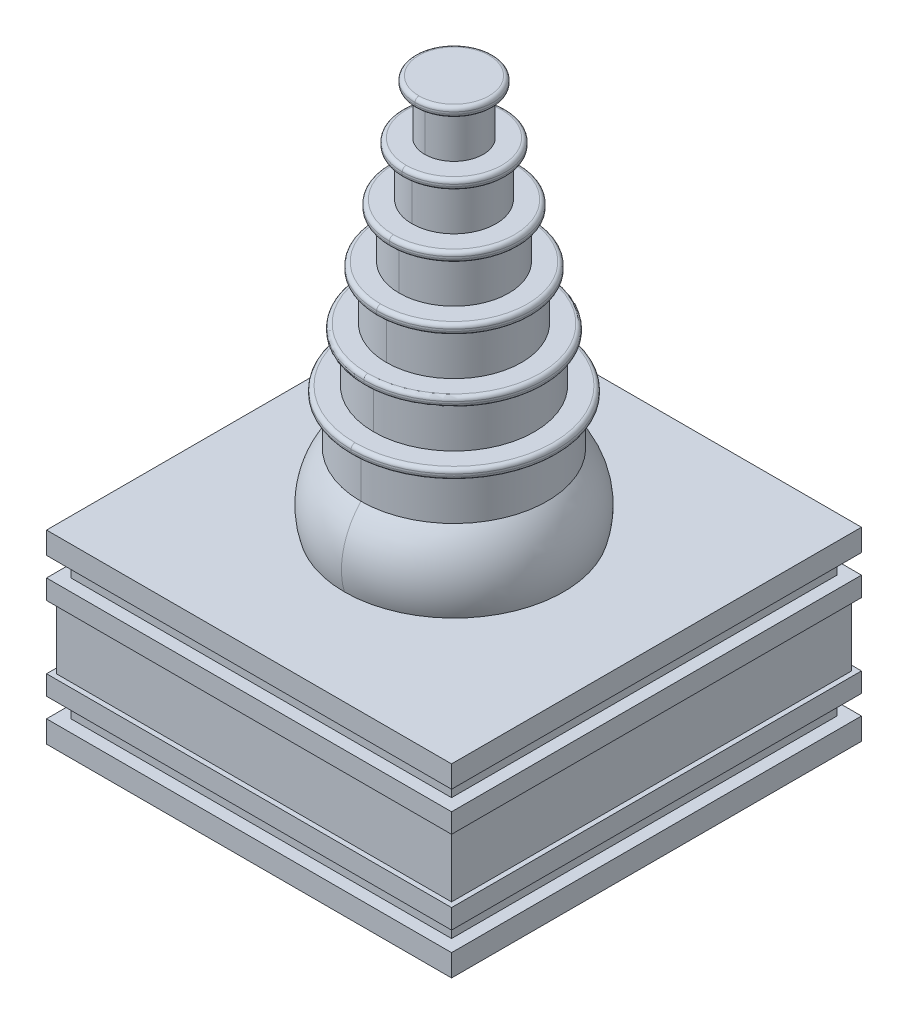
ISO-10303-21;
HEADER;
FILE_DESCRIPTION(('STEP AP214'),'2;1');
FILE_NAME('part.step','',(''),(''),'','','');
FILE_SCHEMA(('AUTOMOTIVE_DESIGN { 1 0 10303 214 1 1 1 1 }'));
ENDSEC;
DATA;
#1=APPLICATION_CONTEXT('core data for automotive mechanical design processes');
#2=APPLICATION_PROTOCOL_DEFINITION('international standard','automotive_design',2000,#1);
#3=PRODUCT_CONTEXT('',#1,'mechanical');
#4=PRODUCT('Part','Part','',(#3));
#5=PRODUCT_RELATED_PRODUCT_CATEGORY('part','',(#4));
#6=PRODUCT_DEFINITION_FORMATION('','',#4);
#7=PRODUCT_DEFINITION_CONTEXT('part definition',#1,'design');
#8=PRODUCT_DEFINITION('design','',#6,#7);
#9=PRODUCT_DEFINITION_SHAPE('','',#8);
#10=(LENGTH_UNIT() NAMED_UNIT(*) SI_UNIT(.MILLI.,.METRE.));
#11=(NAMED_UNIT(*) PLANE_ANGLE_UNIT() SI_UNIT($,.RADIAN.));
#12=(NAMED_UNIT(*) SI_UNIT($,.STERADIAN.) SOLID_ANGLE_UNIT());
#13=UNCERTAINTY_MEASURE_WITH_UNIT(LENGTH_MEASURE(1.E-05),#10,'distance_accuracy_value','');
#14=(GEOMETRIC_REPRESENTATION_CONTEXT(3) GLOBAL_UNCERTAINTY_ASSIGNED_CONTEXT((#13)) GLOBAL_UNIT_ASSIGNED_CONTEXT((#10,
#11,#12)) REPRESENTATION_CONTEXT('',''));
#15=CARTESIAN_POINT('',(0.,0.,0.));
#16=DIRECTION('',(0.,0.,1.));
#17=DIRECTION('',(1.,0.,0.));
#18=AXIS2_PLACEMENT_3D('',#15,#16,#17);
#19=CARTESIAN_POINT('',(15.25,0.5,-15.5));
#20=DIRECTION('',(0.,-1.,0.));
#21=DIRECTION('',(0.,0.,-1.));
#22=AXIS2_PLACEMENT_3D('',#19,#20,#21);
#23=PLANE('',#22);
#24=CARTESIAN_POINT('',(15.25,0.5,-15.5));
#25=DIRECTION('',(0.,-1.,0.));
#26=DIRECTION('',(0.,0.,-1.));
#27=AXIS2_PLACEMENT_3D('',#24,#25,#26);
#28=CIRCLE('',#27,3.5);
#29=CARTESIAN_POINT('',(15.25,0.5,-19.));
#30=VERTEX_POINT('',#29);
#31=CARTESIAN_POINT('',(15.25,0.5,-12.));
#32=VERTEX_POINT('',#31);
#33=EDGE_CURVE('E9',#30,#32,#28,.T.);
#34=ORIENTED_EDGE('',*,*,#33,.T.);
#35=CARTESIAN_POINT('',(15.25,0.5,-15.5));
#36=DIRECTION('',(0.,-1.,0.));
#37=DIRECTION('',(0.,0.,-1.));
#38=AXIS2_PLACEMENT_3D('',#35,#36,#37);
#39=CIRCLE('',#38,3.5);
#40=EDGE_CURVE('E2967',#32,#30,#39,.T.);
#41=ORIENTED_EDGE('',*,*,#40,.T.);
#42=EDGE_LOOP('',(#34,#41));
#43=FACE_BOUND('',#42,.T.);
#44=ADVANCED_FACE('F15',(#43),#23,.T.);
#45=CARTESIAN_POINT('',(15.25,0.5,-15.5));
#46=DIRECTION('',(0.,-1.,0.));
#47=DIRECTION('',(0.,0.,-1.));
#48=AXIS2_PLACEMENT_3D('',#45,#46,#47);
#49=CYLINDRICAL_SURFACE('',#48,3.5);
#50=DIRECTION('',(0.,-1.,0.));
#51=VECTOR('',#50,1.);
#52=CARTESIAN_POINT('',(15.25,0.5,-12.));
#53=LINE('',#52,#51);
#54=CARTESIAN_POINT('',(15.25,0.,-12.));
#55=VERTEX_POINT('',#54);
#56=EDGE_CURVE('E2970',#32,#55,#53,.T.);
#57=ORIENTED_EDGE('',*,*,#56,.F.);
#58=ORIENTED_EDGE('',*,*,#33,.F.);
#59=DIRECTION('',(0.,-1.,0.));
#60=VECTOR('',#59,1.);
#61=CARTESIAN_POINT('',(15.25,0.5,-19.));
#62=LINE('',#61,#60);
#63=CARTESIAN_POINT('',(15.25,0.,-19.));
#64=VERTEX_POINT('',#63);
#65=EDGE_CURVE('E954',#30,#64,#62,.T.);
#66=ORIENTED_EDGE('',*,*,#65,.T.);
#67=CARTESIAN_POINT('',(15.25,0.,-15.5));
#68=DIRECTION('',(0.,-1.,0.));
#69=DIRECTION('',(0.,0.,-1.));
#70=AXIS2_PLACEMENT_3D('',#67,#68,#69);
#71=CIRCLE('',#70,3.5);
#72=EDGE_CURVE('E1522',#64,#55,#71,.T.);
#73=ORIENTED_EDGE('',*,*,#72,.T.);
#74=EDGE_LOOP('',(#57,#58,#66,#73));
#75=FACE_BOUND('',#74,.T.);
#76=ADVANCED_FACE('F17',(#75),#49,.F.);
#77=CARTESIAN_POINT('',(15.25,0.5,15.5));
#78=DIRECTION('',(0.,-1.,0.));
#79=DIRECTION('',(0.,0.,-1.));
#80=AXIS2_PLACEMENT_3D('',#77,#78,#79);
#81=PLANE('',#80);
#82=CARTESIAN_POINT('',(15.25,0.5,15.5));
#83=DIRECTION('',(0.,-1.,0.));
#84=DIRECTION('',(0.,0.,-1.));
#85=AXIS2_PLACEMENT_3D('',#82,#83,#84);
#86=CIRCLE('',#85,3.5);
#87=CARTESIAN_POINT('',(15.25,0.5,12.));
#88=VERTEX_POINT('',#87);
#89=CARTESIAN_POINT('',(15.25,0.5,19.));
#90=VERTEX_POINT('',#89);
#91=EDGE_CURVE('E19',#88,#90,#86,.T.);
#92=ORIENTED_EDGE('',*,*,#91,.T.);
#93=CARTESIAN_POINT('',(15.25,0.5,15.5));
#94=DIRECTION('',(0.,-1.,0.));
#95=DIRECTION('',(0.,0.,-1.));
#96=AXIS2_PLACEMENT_3D('',#93,#94,#95);
#97=CIRCLE('',#96,3.5);
#98=EDGE_CURVE('E937',#90,#88,#97,.T.);
#99=ORIENTED_EDGE('',*,*,#98,.T.);
#100=EDGE_LOOP('',(#92,#99));
#101=FACE_BOUND('',#100,.T.);
#102=ADVANCED_FACE('F935',(#101),#81,.T.);
#103=CARTESIAN_POINT('',(15.25,0.5,15.5));
#104=DIRECTION('',(0.,-1.,0.));
#105=DIRECTION('',(0.,0.,-1.));
#106=AXIS2_PLACEMENT_3D('',#103,#104,#105);
#107=CYLINDRICAL_SURFACE('',#106,3.5);
#108=DIRECTION('',(0.,-1.,0.));
#109=VECTOR('',#108,1.);
#110=CARTESIAN_POINT('',(15.25,0.5,19.));
#111=LINE('',#110,#109);
#112=CARTESIAN_POINT('',(15.25,0.,19.));
#113=VERTEX_POINT('',#112);
#114=EDGE_CURVE('E942',#90,#113,#111,.T.);
#115=ORIENTED_EDGE('',*,*,#114,.F.);
#116=ORIENTED_EDGE('',*,*,#91,.F.);
#117=DIRECTION('',(0.,-1.,0.));
#118=VECTOR('',#117,1.);
#119=CARTESIAN_POINT('',(15.25,0.5,12.));
#120=LINE('',#119,#118);
#121=CARTESIAN_POINT('',(15.25,0.,12.));
#122=VERTEX_POINT('',#121);
#123=EDGE_CURVE('E952',#88,#122,#120,.T.);
#124=ORIENTED_EDGE('',*,*,#123,.T.);
#125=CARTESIAN_POINT('',(15.25,0.,15.5));
#126=DIRECTION('',(0.,-1.,0.));
#127=DIRECTION('',(0.,0.,-1.));
#128=AXIS2_PLACEMENT_3D('',#125,#126,#127);
#129=CIRCLE('',#128,3.5);
#130=EDGE_CURVE('E944',#122,#113,#129,.T.);
#131=ORIENTED_EDGE('',*,*,#130,.T.);
#132=EDGE_LOOP('',(#115,#116,#124,#131));
#133=FACE_BOUND('',#132,.T.);
#134=ADVANCED_FACE('F943',(#133),#107,.F.);
#135=CARTESIAN_POINT('',(0.,-10.8238272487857,0.));
#136=DIRECTION('',(0.,-1.,0.));
#137=DIRECTION('',(0.,0.,-1.));
#138=AXIS2_PLACEMENT_3D('',#135,#136,#137);
#139=CYLINDRICAL_SURFACE('',#138,9.54439826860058);
#140=DIRECTION('',(0.,-1.,0.));
#141=VECTOR('',#140,1.);
#142=CARTESIAN_POINT('',(0.,-10.8238272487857,9.54439826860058));
#143=LINE('',#142,#141);
#144=CARTESIAN_POINT('',(0.,30.7,9.54439826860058));
#145=VERTEX_POINT('',#144);
#146=CARTESIAN_POINT('',(0.,26.2,9.54439826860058));
#147=VERTEX_POINT('',#146);
#148=EDGE_CURVE('E997',#145,#147,#143,.T.);
#149=ORIENTED_EDGE('',*,*,#148,.F.);
#150=CARTESIAN_POINT('',(0.,30.7,0.));
#151=DIRECTION('',(0.,1.,0.));
#152=DIRECTION('',(0.,0.,1.));
#153=AXIS2_PLACEMENT_3D('',#150,#151,#152);
#154=CIRCLE('',#153,9.54439826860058);
#155=CARTESIAN_POINT('',(0.,30.7,-9.54439826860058));
#156=VERTEX_POINT('',#155);
#157=EDGE_CURVE('E1487',#156,#145,#154,.T.);
#158=ORIENTED_EDGE('',*,*,#157,.F.);
#159=DIRECTION('',(0.,-1.,0.));
#160=VECTOR('',#159,1.);
#161=CARTESIAN_POINT('',(0.,-10.8238272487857,-9.54439826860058));
#162=LINE('',#161,#160);
#163=CARTESIAN_POINT('',(0.,26.2,-9.54439826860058));
#164=VERTEX_POINT('',#163);
#165=EDGE_CURVE('E1014',#156,#164,#162,.T.);
#166=ORIENTED_EDGE('',*,*,#165,.T.);
#167=CARTESIAN_POINT('',(0.,26.2,0.));
#168=DIRECTION('',(0.,-1.,0.));
#169=DIRECTION('',(0.,0.,-1.));
#170=AXIS2_PLACEMENT_3D('',#167,#168,#169);
#171=CIRCLE('',#170,9.54439826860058);
#172=EDGE_CURVE('E922',#147,#164,#171,.T.);
#173=ORIENTED_EDGE('',*,*,#172,.F.);
#174=EDGE_LOOP('',(#149,#158,#166,#173));
#175=FACE_BOUND('',#174,.T.);
#176=ADVANCED_FACE('F1795',(#175),#139,.T.);
#177=CARTESIAN_POINT('',(0.,21.1096242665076,0.));
#178=DIRECTION('',(0.,-1.,0.));
#179=DIRECTION('',(0.,0.,-1.));
#180=AXIS2_PLACEMENT_3D('',#177,#178,#179);
#181=DEGENERATE_TOROIDAL_SURFACE('',#180,4.03639727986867,7.5,.T.);
#182=CARTESIAN_POINT('',(0.,21.1096242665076,4.03639727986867));
#183=DIRECTION('',(1.,0.,0.));
#184=DIRECTION('',(0.,0.,-1.));
#185=AXIS2_PLACEMENT_3D('',#182,#183,#184);
#186=CIRCLE('',#185,7.5);
#187=CARTESIAN_POINT('',(0.,19.,11.2335832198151));
#188=VERTEX_POINT('',#187);
#189=EDGE_CURVE('E1018',#147,#188,#186,.T.);
#190=ORIENTED_EDGE('',*,*,#189,.F.);
#191=ORIENTED_EDGE('',*,*,#172,.T.);
#192=CARTESIAN_POINT('',(0.,21.1096242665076,-4.03639727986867));
#193=DIRECTION('',(-1.,0.,0.));
#194=DIRECTION('',(0.,0.,1.));
#195=AXIS2_PLACEMENT_3D('',#192,#193,#194);
#196=CIRCLE('',#195,7.5);
#197=CARTESIAN_POINT('',(0.,19.,-11.2335832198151));
#198=VERTEX_POINT('',#197);
#199=EDGE_CURVE('E1030',#164,#198,#196,.T.);
#200=ORIENTED_EDGE('',*,*,#199,.T.);
#201=CARTESIAN_POINT('',(0.,19.,0.));
#202=DIRECTION('',(0.,-1.,0.));
#203=DIRECTION('',(0.,0.,-1.));
#204=AXIS2_PLACEMENT_3D('',#201,#202,#203);
#205=CIRCLE('',#204,11.2335832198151);
#206=EDGE_CURVE('E920',#188,#198,#205,.T.);
#207=ORIENTED_EDGE('',*,*,#206,.F.);
#208=EDGE_LOOP('',(#190,#191,#200,#207));
#209=FACE_BOUND('',#208,.T.);
#210=ADVANCED_FACE('F1884',(#209),#181,.T.);
#211=CARTESIAN_POINT('',(0.,19.,0.));
#212=DIRECTION('',(0.,1.,0.));
#213=DIRECTION('',(1.,0.,0.));
#214=AXIS2_PLACEMENT_3D('',#211,#212,#213);
#215=PLANE('',#214);
#216=CARTESIAN_POINT('',(0.,19.,0.));
#217=DIRECTION('',(0.,-1.,0.));
#218=DIRECTION('',(0.,0.,-1.));
#219=AXIS2_PLACEMENT_3D('',#216,#217,#218);
#220=CIRCLE('',#219,11.2335832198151);
#221=EDGE_CURVE('E1034',#198,#188,#220,.T.);
#222=ORIENTED_EDGE('',*,*,#221,.T.);
#223=ORIENTED_EDGE('',*,*,#206,.T.);
#224=EDGE_LOOP('',(#222,#223));
#225=FACE_BOUND('',#224,.T.);
#226=DIRECTION('',(0.,0.,1.));
#227=VECTOR('',#226,1.);
#228=CARTESIAN_POINT('',(-20.75,19.,-21.));
#229=LINE('',#228,#227);
#230=CARTESIAN_POINT('',(-20.75,19.,-21.));
#231=VERTEX_POINT('',#230);
#232=CARTESIAN_POINT('',(-20.75,19.,21.));
#233=VERTEX_POINT('',#232);
#234=EDGE_CURVE('E36',#231,#233,#229,.T.);
#235=ORIENTED_EDGE('',*,*,#234,.T.);
#236=DIRECTION('',(1.,0.,0.));
#237=VECTOR('',#236,1.);
#238=CARTESIAN_POINT('',(-20.75,19.,21.));
#239=LINE('',#238,#237);
#240=CARTESIAN_POINT('',(20.75,19.,21.));
#241=VERTEX_POINT('',#240);
#242=EDGE_CURVE('E42',#233,#241,#239,.T.);
#243=ORIENTED_EDGE('',*,*,#242,.T.);
#244=DIRECTION('',(0.,0.,-1.));
#245=VECTOR('',#244,1.);
#246=CARTESIAN_POINT('',(20.75,19.,-21.));
#247=LINE('',#246,#245);
#248=CARTESIAN_POINT('',(20.75,19.,-21.));
#249=VERTEX_POINT('',#248);
#250=EDGE_CURVE('E914',#241,#249,#247,.T.);
#251=ORIENTED_EDGE('',*,*,#250,.T.);
#252=DIRECTION('',(-1.,0.,0.));
#253=VECTOR('',#252,1.);
#254=CARTESIAN_POINT('',(-20.75,19.,-21.));
#255=LINE('',#254,#253);
#256=EDGE_CURVE('E908',#249,#231,#255,.T.);
#257=ORIENTED_EDGE('',*,*,#256,.T.);
#258=EDGE_LOOP('',(#235,#243,#251,#257));
#259=FACE_BOUND('',#258,.T.);
#260=ADVANCED_FACE('F1673',(#225,#259),#215,.T.);
#261=CARTESIAN_POINT('',(-20.75,19.,-21.));
#262=DIRECTION('',(1.,0.,0.));
#263=DIRECTION('',(0.,1.,0.));
#264=AXIS2_PLACEMENT_3D('',#261,#262,#263);
#265=PLANE('',#264);
#266=DIRECTION('',(0.,-1.,0.));
#267=VECTOR('',#266,1.);
#268=CARTESIAN_POINT('',(-20.75,19.,-21.));
#269=LINE('',#268,#267);
#270=CARTESIAN_POINT('',(-20.75,16.75,-21.));
#271=VERTEX_POINT('',#270);
#272=EDGE_CURVE('E905',#231,#271,#269,.T.);
#273=ORIENTED_EDGE('',*,*,#272,.T.);
#274=DIRECTION('',(0.,0.,1.));
#275=VECTOR('',#274,1.);
#276=CARTESIAN_POINT('',(-20.75,16.75,-59.265519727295));
#277=LINE('',#276,#275);
#278=CARTESIAN_POINT('',(-20.75,16.75,21.));
#279=VERTEX_POINT('',#278);
#280=EDGE_CURVE('E898',#271,#279,#277,.T.);
#281=ORIENTED_EDGE('',*,*,#280,.T.);
#282=DIRECTION('',(0.,-1.,0.));
#283=VECTOR('',#282,1.);
#284=CARTESIAN_POINT('',(-20.75,19.,21.));
#285=LINE('',#284,#283);
#286=EDGE_CURVE('E917',#233,#279,#285,.T.);
#287=ORIENTED_EDGE('',*,*,#286,.F.);
#288=ORIENTED_EDGE('',*,*,#234,.F.);
#289=EDGE_LOOP('',(#273,#281,#287,#288));
#290=FACE_BOUND('',#289,.T.);
#291=ADVANCED_FACE('F1669',(#290),#265,.F.);
#292=CARTESIAN_POINT('',(-20.75,19.,21.));
#293=DIRECTION('',(0.,0.,-1.));
#294=DIRECTION('',(0.,-1.,0.));
#295=AXIS2_PLACEMENT_3D('',#292,#293,#294);
#296=PLANE('',#295);
#297=ORIENTED_EDGE('',*,*,#286,.T.);
#298=DIRECTION('',(-1.,0.,0.));
#299=VECTOR('',#298,1.);
#300=CARTESIAN_POINT('',(20.75,16.75,21.));
#301=LINE('',#300,#299);
#302=CARTESIAN_POINT('',(20.75,16.75,21.));
#303=VERTEX_POINT('',#302);
#304=EDGE_CURVE('E894',#303,#279,#301,.T.);
#305=ORIENTED_EDGE('',*,*,#304,.F.);
#306=DIRECTION('',(0.,-1.,0.));
#307=VECTOR('',#306,1.);
#308=CARTESIAN_POINT('',(20.75,19.,21.));
#309=LINE('',#308,#307);
#310=EDGE_CURVE('E911',#241,#303,#309,.T.);
#311=ORIENTED_EDGE('',*,*,#310,.F.);
#312=ORIENTED_EDGE('',*,*,#242,.F.);
#313=EDGE_LOOP('',(#297,#305,#311,#312));
#314=FACE_BOUND('',#313,.T.);
#315=ADVANCED_FACE('F1672',(#314),#296,.F.);
#316=CARTESIAN_POINT('',(20.75,19.,-21.));
#317=DIRECTION('',(-1.,0.,0.));
#318=DIRECTION('',(0.,0.,1.));
#319=AXIS2_PLACEMENT_3D('',#316,#317,#318);
#320=PLANE('',#319);
#321=ORIENTED_EDGE('',*,*,#310,.T.);
#322=DIRECTION('',(0.,0.,1.));
#323=VECTOR('',#322,1.);
#324=CARTESIAN_POINT('',(20.75,16.75,-21.));
#325=LINE('',#324,#323);
#326=CARTESIAN_POINT('',(20.75,16.75,-21.));
#327=VERTEX_POINT('',#326);
#328=EDGE_CURVE('E890',#327,#303,#325,.T.);
#329=ORIENTED_EDGE('',*,*,#328,.F.);
#330=DIRECTION('',(0.,-1.,0.));
#331=VECTOR('',#330,1.);
#332=CARTESIAN_POINT('',(20.75,19.,-21.));
#333=LINE('',#332,#331);
#334=EDGE_CURVE('E902',#249,#327,#333,.T.);
#335=ORIENTED_EDGE('',*,*,#334,.F.);
#336=ORIENTED_EDGE('',*,*,#250,.F.);
#337=EDGE_LOOP('',(#321,#329,#335,#336));
#338=FACE_BOUND('',#337,.T.);
#339=ADVANCED_FACE('F1879',(#338),#320,.F.);
#340=CARTESIAN_POINT('',(-20.75,19.,-21.));
#341=DIRECTION('',(0.,0.,1.));
#342=DIRECTION('',(1.,0.,0.));
#343=AXIS2_PLACEMENT_3D('',#340,#341,#342);
#344=PLANE('',#343);
#345=ORIENTED_EDGE('',*,*,#334,.T.);
#346=DIRECTION('',(1.,0.,0.));
#347=VECTOR('',#346,1.);
#348=CARTESIAN_POINT('',(-20.75,16.75,-21.));
#349=LINE('',#348,#347);
#350=EDGE_CURVE('E886',#271,#327,#349,.T.);
#351=ORIENTED_EDGE('',*,*,#350,.F.);
#352=ORIENTED_EDGE('',*,*,#272,.F.);
#353=ORIENTED_EDGE('',*,*,#256,.F.);
#354=EDGE_LOOP('',(#345,#351,#352,#353));
#355=FACE_BOUND('',#354,.T.);
#356=ADVANCED_FACE('F1634',(#355),#344,.F.);
#357=CARTESIAN_POINT('',(-20.75,16.75,-59.265519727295));
#358=DIRECTION('',(0.,1.,0.));
#359=DIRECTION('',(1.,0.,0.));
#360=AXIS2_PLACEMENT_3D('',#357,#358,#359);
#361=PLANE('',#360);
#362=DIRECTION('',(0.,0.,1.));
#363=VECTOR('',#362,1.);
#364=CARTESIAN_POINT('',(-19.5,16.75,-59.265519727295));
#365=LINE('',#364,#363);
#366=CARTESIAN_POINT('',(-19.5,16.75,-19.75));
#367=VERTEX_POINT('',#366);
#368=CARTESIAN_POINT('',(-19.5,16.75,19.75));
#369=VERTEX_POINT('',#368);
#370=EDGE_CURVE('E883',#367,#369,#365,.T.);
#371=ORIENTED_EDGE('',*,*,#370,.T.);
#372=DIRECTION('',(-1.,0.,0.));
#373=VECTOR('',#372,1.);
#374=CARTESIAN_POINT('',(19.5,16.75,19.75));
#375=LINE('',#374,#373);
#376=CARTESIAN_POINT('',(19.5,16.75,19.75));
#377=VERTEX_POINT('',#376);
#378=EDGE_CURVE('E879',#377,#369,#375,.T.);
#379=ORIENTED_EDGE('',*,*,#378,.F.);
#380=DIRECTION('',(0.,0.,1.));
#381=VECTOR('',#380,1.);
#382=CARTESIAN_POINT('',(19.5,16.75,-19.75));
#383=LINE('',#382,#381);
#384=CARTESIAN_POINT('',(19.5,16.75,-19.75));
#385=VERTEX_POINT('',#384);
#386=EDGE_CURVE('E870',#385,#377,#383,.T.);
#387=ORIENTED_EDGE('',*,*,#386,.F.);
#388=DIRECTION('',(1.,0.,0.));
#389=VECTOR('',#388,1.);
#390=CARTESIAN_POINT('',(-19.5,16.75,-19.75));
#391=LINE('',#390,#389);
#392=EDGE_CURVE('E866',#367,#385,#391,.T.);
#393=ORIENTED_EDGE('',*,*,#392,.F.);
#394=EDGE_LOOP('',(#371,#379,#387,#393));
#395=FACE_BOUND('',#394,.T.);
#396=ORIENTED_EDGE('',*,*,#350,.T.);
#397=ORIENTED_EDGE('',*,*,#328,.T.);
#398=ORIENTED_EDGE('',*,*,#304,.T.);
#399=ORIENTED_EDGE('',*,*,#280,.F.);
#400=EDGE_LOOP('',(#396,#397,#398,#399));
#401=FACE_BOUND('',#400,.T.);
#402=ADVANCED_FACE('F1630',(#395,#401),#361,.F.);
#403=CARTESIAN_POINT('',(-19.5,16.75,-59.265519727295));
#404=DIRECTION('',(1.,0.,0.));
#405=DIRECTION('',(0.,1.,0.));
#406=AXIS2_PLACEMENT_3D('',#403,#404,#405);
#407=PLANE('',#406);
#408=DIRECTION('',(0.,0.,1.));
#409=VECTOR('',#408,1.);
#410=CARTESIAN_POINT('',(-19.5,14.75,-59.265519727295));
#411=LINE('',#410,#409);
#412=CARTESIAN_POINT('',(-19.5,14.75,-19.75));
#413=VERTEX_POINT('',#412);
#414=CARTESIAN_POINT('',(-19.5,14.75,19.75));
#415=VERTEX_POINT('',#414);
#416=EDGE_CURVE('E855',#413,#415,#411,.T.);
#417=ORIENTED_EDGE('',*,*,#416,.T.);
#418=CARTESIAN_POINT('',(-19.5,16.75,19.75));
#419=CARTESIAN_POINT('',(-19.5,16.0833333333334,19.75));
#420=CARTESIAN_POINT('',(-19.5,15.4166666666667,19.75));
#421=CARTESIAN_POINT('',(-19.5,14.75,19.75));
#422=(BOUNDED_CURVE() B_SPLINE_CURVE(3,(#418,#419,#420,#421),.UNSPECIFIED.,.F.,
.F.) B_SPLINE_CURVE_WITH_KNOTS((4,4),(0.,1.),
.UNSPECIFIED.) CURVE() GEOMETRIC_REPRESENTATION_ITEM() RATIONAL_B_SPLINE_CURVE((1.,1.,1.,1.)) REPRESENTATION_ITEM(''));
#423=EDGE_CURVE('E878',#369,#415,#422,.T.);
#424=ORIENTED_EDGE('',*,*,#423,.F.);
#425=ORIENTED_EDGE('',*,*,#370,.F.);
#426=DIRECTION('',(0.,1.,0.));
#427=VECTOR('',#426,1.);
#428=CARTESIAN_POINT('',(-19.5,16.75,-19.75));
#429=LINE('',#428,#427);
#430=EDGE_CURVE('E862',#413,#367,#429,.T.);
#431=ORIENTED_EDGE('',*,*,#430,.F.);
#432=EDGE_LOOP('',(#417,#424,#425,#431));
#433=FACE_BOUND('',#432,.T.);
#434=ADVANCED_FACE('F1633',(#433),#407,.F.);
#435=CARTESIAN_POINT('',(19.5,16.75,19.75));
#436=DIRECTION('',(0.,0.,1.));
#437=DIRECTION('',(1.,0.,0.));
#438=AXIS2_PLACEMENT_3D('',#435,#436,#437);
#439=PLANE('',#438);
#440=ORIENTED_EDGE('',*,*,#423,.T.);
#441=DIRECTION('',(-1.,0.,0.));
#442=VECTOR('',#441,1.);
#443=CARTESIAN_POINT('',(19.5,14.75,19.75));
#444=LINE('',#443,#442);
#445=CARTESIAN_POINT('',(19.5,14.75,19.75));
#446=VERTEX_POINT('',#445);
#447=EDGE_CURVE('E851',#446,#415,#444,.T.);
#448=ORIENTED_EDGE('',*,*,#447,.F.);
#449=DIRECTION('',(0.,1.,0.));
#450=VECTOR('',#449,1.);
#451=CARTESIAN_POINT('',(19.5,16.75,19.75));
#452=LINE('',#451,#450);
#453=EDGE_CURVE('E874',#446,#377,#452,.T.);
#454=ORIENTED_EDGE('',*,*,#453,.T.);
#455=ORIENTED_EDGE('',*,*,#378,.T.);
#456=EDGE_LOOP('',(#440,#448,#454,#455));
#457=FACE_BOUND('',#456,.T.);
#458=ADVANCED_FACE('F1829',(#457),#439,.T.);
#459=CARTESIAN_POINT('',(19.5,16.75,-19.75));
#460=DIRECTION('',(-1.,0.,0.));
#461=DIRECTION('',(0.,0.,1.));
#462=AXIS2_PLACEMENT_3D('',#459,#460,#461);
#463=PLANE('',#462);
#464=DIRECTION('',(0.,0.,1.));
#465=VECTOR('',#464,1.);
#466=CARTESIAN_POINT('',(19.5,14.75,-19.75));
#467=LINE('',#466,#465);
#468=CARTESIAN_POINT('',(19.5,14.75,-19.75));
#469=VERTEX_POINT('',#468);
#470=EDGE_CURVE('E847',#469,#446,#467,.T.);
#471=ORIENTED_EDGE('',*,*,#470,.F.);
#472=DIRECTION('',(0.,-1.,0.));
#473=VECTOR('',#472,1.);
#474=CARTESIAN_POINT('',(19.5,16.75,-19.75));
#475=LINE('',#474,#473);
#476=EDGE_CURVE('E859',#385,#469,#475,.T.);
#477=ORIENTED_EDGE('',*,*,#476,.F.);
#478=ORIENTED_EDGE('',*,*,#386,.T.);
#479=ORIENTED_EDGE('',*,*,#453,.F.);
#480=EDGE_LOOP('',(#471,#477,#478,#479));
#481=FACE_BOUND('',#480,.T.);
#482=ADVANCED_FACE('F1826',(#481),#463,.F.);
#483=CARTESIAN_POINT('',(-19.5,16.75,-19.75));
#484=DIRECTION('',(0.,0.,-1.));
#485=DIRECTION('',(-1.,0.,0.));
#486=AXIS2_PLACEMENT_3D('',#483,#484,#485);
#487=PLANE('',#486);
#488=ORIENTED_EDGE('',*,*,#476,.T.);
#489=DIRECTION('',(1.,0.,0.));
#490=VECTOR('',#489,1.);
#491=CARTESIAN_POINT('',(-19.5,14.75,-19.75));
#492=LINE('',#491,#490);
#493=EDGE_CURVE('E843',#413,#469,#492,.T.);
#494=ORIENTED_EDGE('',*,*,#493,.F.);
#495=ORIENTED_EDGE('',*,*,#430,.T.);
#496=ORIENTED_EDGE('',*,*,#392,.T.);
#497=EDGE_LOOP('',(#488,#494,#495,#496));
#498=FACE_BOUND('',#497,.T.);
#499=ADVANCED_FACE('F1828',(#498),#487,.T.);
#500=CARTESIAN_POINT('',(-19.5,14.75,-59.265519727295));
#501=DIRECTION('',(0.,-1.,0.));
#502=DIRECTION('',(0.,0.,-1.));
#503=AXIS2_PLACEMENT_3D('',#500,#501,#502);
#504=PLANE('',#503);
#505=ORIENTED_EDGE('',*,*,#493,.T.);
#506=ORIENTED_EDGE('',*,*,#470,.T.);
#507=ORIENTED_EDGE('',*,*,#447,.T.);
#508=ORIENTED_EDGE('',*,*,#416,.F.);
#509=EDGE_LOOP('',(#505,#506,#507,#508));
#510=FACE_BOUND('',#509,.T.);
#511=DIRECTION('',(0.,0.,1.));
#512=VECTOR('',#511,1.);
#513=CARTESIAN_POINT('',(-20.75,14.75,-59.265519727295));
#514=LINE('',#513,#512);
#515=CARTESIAN_POINT('',(-20.75,14.75,-21.));
#516=VERTEX_POINT('',#515);
#517=CARTESIAN_POINT('',(-20.75,14.75,21.));
#518=VERTEX_POINT('',#517);
#519=EDGE_CURVE('E840',#516,#518,#514,.T.);
#520=ORIENTED_EDGE('',*,*,#519,.T.);
#521=DIRECTION('',(-1.,0.,0.));
#522=VECTOR('',#521,1.);
#523=CARTESIAN_POINT('',(20.75,14.75,21.));
#524=LINE('',#523,#522);
#525=CARTESIAN_POINT('',(20.75,14.75,21.));
#526=VERTEX_POINT('',#525);
#527=EDGE_CURVE('E833',#526,#518,#524,.T.);
#528=ORIENTED_EDGE('',*,*,#527,.F.);
#529=DIRECTION('',(0.,0.,1.));
#530=VECTOR('',#529,1.);
#531=CARTESIAN_POINT('',(20.75,14.75,-21.));
#532=LINE('',#531,#530);
#533=CARTESIAN_POINT('',(20.75,14.75,-21.));
#534=VERTEX_POINT('',#533);
#535=EDGE_CURVE('E826',#534,#526,#532,.T.);
#536=ORIENTED_EDGE('',*,*,#535,.F.);
#537=DIRECTION('',(1.,0.,0.));
#538=VECTOR('',#537,1.);
#539=CARTESIAN_POINT('',(-20.75,14.75,-21.));
#540=LINE('',#539,#538);
#541=EDGE_CURVE('E819',#516,#534,#540,.T.);
#542=ORIENTED_EDGE('',*,*,#541,.F.);
#543=EDGE_LOOP('',(#520,#528,#536,#542));
#544=FACE_BOUND('',#543,.T.);
#545=ADVANCED_FACE('F1835',(#510,#544),#504,.F.);
#546=CARTESIAN_POINT('',(-20.75,19.,-21.));
#547=DIRECTION('',(1.,0.,0.));
#548=DIRECTION('',(0.,1.,0.));
#549=AXIS2_PLACEMENT_3D('',#546,#547,#548);
#550=PLANE('',#549);
#551=DIRECTION('',(0.,-1.,0.));
#552=VECTOR('',#551,1.);
#553=CARTESIAN_POINT('',(-20.75,19.,21.));
#554=LINE('',#553,#552);
#555=CARTESIAN_POINT('',(-20.75,12.75,21.));
#556=VERTEX_POINT('',#555);
#557=EDGE_CURVE('E837',#518,#556,#554,.T.);
#558=ORIENTED_EDGE('',*,*,#557,.F.);
#559=ORIENTED_EDGE('',*,*,#519,.F.);
#560=DIRECTION('',(0.,-1.,0.));
#561=VECTOR('',#560,1.);
#562=CARTESIAN_POINT('',(-20.75,19.,-21.));
#563=LINE('',#562,#561);
#564=CARTESIAN_POINT('',(-20.75,12.75,-21.));
#565=VERTEX_POINT('',#564);
#566=EDGE_CURVE('E816',#516,#565,#563,.T.);
#567=ORIENTED_EDGE('',*,*,#566,.T.);
#568=DIRECTION('',(0.,0.,1.));
#569=VECTOR('',#568,1.);
#570=CARTESIAN_POINT('',(-20.75,12.75,-59.265519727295));
#571=LINE('',#570,#569);
#572=EDGE_CURVE('E812',#565,#556,#571,.T.);
#573=ORIENTED_EDGE('',*,*,#572,.T.);
#574=EDGE_LOOP('',(#558,#559,#567,#573));
#575=FACE_BOUND('',#574,.T.);
#576=ADVANCED_FACE('F1873',(#575),#550,.F.);
#577=CARTESIAN_POINT('',(-20.75,19.,21.));
#578=DIRECTION('',(0.,0.,-1.));
#579=DIRECTION('',(0.,-1.,0.));
#580=AXIS2_PLACEMENT_3D('',#577,#578,#579);
#581=PLANE('',#580);
#582=DIRECTION('',(0.,-1.,0.));
#583=VECTOR('',#582,1.);
#584=CARTESIAN_POINT('',(20.75,19.,21.));
#585=LINE('',#584,#583);
#586=CARTESIAN_POINT('',(20.75,12.75,21.));
#587=VERTEX_POINT('',#586);
#588=EDGE_CURVE('E830',#526,#587,#585,.T.);
#589=ORIENTED_EDGE('',*,*,#588,.F.);
#590=ORIENTED_EDGE('',*,*,#527,.T.);
#591=ORIENTED_EDGE('',*,*,#557,.T.);
#592=DIRECTION('',(-1.,0.,0.));
#593=VECTOR('',#592,1.);
#594=CARTESIAN_POINT('',(20.75,12.75,21.));
#595=LINE('',#594,#593);
#596=EDGE_CURVE('E808',#587,#556,#595,.T.);
#597=ORIENTED_EDGE('',*,*,#596,.F.);
#598=EDGE_LOOP('',(#589,#590,#591,#597));
#599=FACE_BOUND('',#598,.T.);
#600=ADVANCED_FACE('F1870',(#599),#581,.F.);
#601=CARTESIAN_POINT('',(20.75,19.,-21.));
#602=DIRECTION('',(-1.,0.,0.));
#603=DIRECTION('',(0.,0.,1.));
#604=AXIS2_PLACEMENT_3D('',#601,#602,#603);
#605=PLANE('',#604);
#606=DIRECTION('',(0.,-1.,0.));
#607=VECTOR('',#606,1.);
#608=CARTESIAN_POINT('',(20.75,19.,-21.));
#609=LINE('',#608,#607);
#610=CARTESIAN_POINT('',(20.75,12.75,-21.));
#611=VERTEX_POINT('',#610);
#612=EDGE_CURVE('E823',#534,#611,#609,.T.);
#613=ORIENTED_EDGE('',*,*,#612,.F.);
#614=ORIENTED_EDGE('',*,*,#535,.T.);
#615=ORIENTED_EDGE('',*,*,#588,.T.);
#616=DIRECTION('',(0.,0.,1.));
#617=VECTOR('',#616,1.);
#618=CARTESIAN_POINT('',(20.75,12.75,-21.));
#619=LINE('',#618,#617);
#620=EDGE_CURVE('E804',#611,#587,#619,.T.);
#621=ORIENTED_EDGE('',*,*,#620,.F.);
#622=EDGE_LOOP('',(#613,#614,#615,#621));
#623=FACE_BOUND('',#622,.T.);
#624=ADVANCED_FACE('F1608',(#623),#605,.F.);
#625=CARTESIAN_POINT('',(-20.75,19.,-21.));
#626=DIRECTION('',(0.,0.,1.));
#627=DIRECTION('',(1.,0.,0.));
#628=AXIS2_PLACEMENT_3D('',#625,#626,#627);
#629=PLANE('',#628);
#630=ORIENTED_EDGE('',*,*,#566,.F.);
#631=ORIENTED_EDGE('',*,*,#541,.T.);
#632=ORIENTED_EDGE('',*,*,#612,.T.);
#633=DIRECTION('',(1.,0.,0.));
#634=VECTOR('',#633,1.);
#635=CARTESIAN_POINT('',(-20.75,12.75,-21.));
#636=LINE('',#635,#634);
#637=EDGE_CURVE('E803',#565,#611,#636,.T.);
#638=ORIENTED_EDGE('',*,*,#637,.F.);
#639=EDGE_LOOP('',(#630,#631,#632,#638));
#640=FACE_BOUND('',#639,.T.);
#641=ADVANCED_FACE('F1604',(#640),#629,.F.);
#642=CARTESIAN_POINT('',(-20.75,12.75,-59.265519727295));
#643=DIRECTION('',(0.,1.,0.));
#644=DIRECTION('',(1.,0.,0.));
#645=AXIS2_PLACEMENT_3D('',#642,#643,#644);
#646=PLANE('',#645);
#647=DIRECTION('',(0.,0.,1.));
#648=VECTOR('',#647,1.);
#649=CARTESIAN_POINT('',(-20.25,12.75,-59.265519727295));
#650=LINE('',#649,#648);
#651=CARTESIAN_POINT('',(-20.25,12.75,-20.5));
#652=VERTEX_POINT('',#651);
#653=CARTESIAN_POINT('',(-20.25,12.75,20.5));
#654=VERTEX_POINT('',#653);
#655=EDGE_CURVE('E800',#652,#654,#650,.T.);
#656=ORIENTED_EDGE('',*,*,#655,.T.);
#657=DIRECTION('',(-1.,0.,0.));
#658=VECTOR('',#657,1.);
#659=CARTESIAN_POINT('',(20.25,12.75,20.5));
#660=LINE('',#659,#658);
#661=CARTESIAN_POINT('',(20.25,12.75,20.5));
#662=VERTEX_POINT('',#661);
#663=EDGE_CURVE('E793',#662,#654,#660,.T.);
#664=ORIENTED_EDGE('',*,*,#663,.F.);
#665=DIRECTION('',(0.,0.,1.));
#666=VECTOR('',#665,1.);
#667=CARTESIAN_POINT('',(20.25,12.75,-20.5));
#668=LINE('',#667,#666);
#669=CARTESIAN_POINT('',(20.25,12.75,-20.5));
#670=VERTEX_POINT('',#669);
#671=EDGE_CURVE('E780',#670,#662,#668,.T.);
#672=ORIENTED_EDGE('',*,*,#671,.F.);
#673=DIRECTION('',(1.,0.,0.));
#674=VECTOR('',#673,1.);
#675=CARTESIAN_POINT('',(-20.25,12.75,-20.5));
#676=LINE('',#675,#674);
#677=EDGE_CURVE('E776',#652,#670,#676,.T.);
#678=ORIENTED_EDGE('',*,*,#677,.F.);
#679=EDGE_LOOP('',(#656,#664,#672,#678));
#680=FACE_BOUND('',#679,.T.);
#681=ORIENTED_EDGE('',*,*,#637,.T.);
#682=ORIENTED_EDGE('',*,*,#620,.T.);
#683=ORIENTED_EDGE('',*,*,#596,.T.);
#684=ORIENTED_EDGE('',*,*,#572,.F.);
#685=EDGE_LOOP('',(#681,#682,#683,#684));
#686=FACE_BOUND('',#685,.T.);
#687=ADVANCED_FACE('F1607',(#680,#686),#646,.F.);
#688=CARTESIAN_POINT('',(-20.25,12.75,-59.265519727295));
#689=DIRECTION('',(1.,0.,0.));
#690=DIRECTION('',(0.,-1.,0.));
#691=AXIS2_PLACEMENT_3D('',#688,#689,#690);
#692=PLANE('',#691);
#693=DIRECTION('',(0.,0.,1.));
#694=VECTOR('',#693,1.);
#695=CARTESIAN_POINT('',(-20.25,6.25,-59.265519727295));
#696=LINE('',#695,#694);
#697=CARTESIAN_POINT('',(-20.25,6.25,-20.5));
#698=VERTEX_POINT('',#697);
#699=CARTESIAN_POINT('',(-20.25,6.25,20.5));
#700=VERTEX_POINT('',#699);
#701=EDGE_CURVE('E765',#698,#700,#696,.T.);
#702=ORIENTED_EDGE('',*,*,#701,.T.);
#703=CARTESIAN_POINT('',(-20.25,12.75,20.5));
#704=CARTESIAN_POINT('',(-20.25,10.5833333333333,20.5));
#705=CARTESIAN_POINT('',(-20.25,8.41666666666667,20.5));
#706=CARTESIAN_POINT('',(-20.25,6.25,20.5));
#707=(BOUNDED_CURVE() B_SPLINE_CURVE(3,(#703,#704,#705,#706),.UNSPECIFIED.,.F.,
.F.) B_SPLINE_CURVE_WITH_KNOTS((4,4),(0.,1.),
.UNSPECIFIED.) CURVE() GEOMETRIC_REPRESENTATION_ITEM() RATIONAL_B_SPLINE_CURVE((1.,1.,1.,1.)) REPRESENTATION_ITEM(''));
#708=EDGE_CURVE('E788',#654,#700,#707,.T.);
#709=ORIENTED_EDGE('',*,*,#708,.F.);
#710=ORIENTED_EDGE('',*,*,#655,.F.);
#711=DIRECTION('',(0.,1.,0.));
#712=VECTOR('',#711,1.);
#713=CARTESIAN_POINT('',(-20.25,12.75,-20.5));
#714=LINE('',#713,#712);
#715=EDGE_CURVE('E772',#698,#652,#714,.T.);
#716=ORIENTED_EDGE('',*,*,#715,.F.);
#717=EDGE_LOOP('',(#702,#709,#710,#716));
#718=FACE_BOUND('',#717,.T.);
#719=ADVANCED_FACE('F1865',(#718),#692,.F.);
#720=CARTESIAN_POINT('',(20.25,12.75,20.5));
#721=DIRECTION('',(0.,0.,1.));
#722=DIRECTION('',(0.,-1.,0.));
#723=AXIS2_PLACEMENT_3D('',#720,#721,#722);
#724=PLANE('',#723);
#725=ORIENTED_EDGE('',*,*,#708,.T.);
#726=DIRECTION('',(-1.,0.,0.));
#727=VECTOR('',#726,1.);
#728=CARTESIAN_POINT('',(20.25,6.25,20.5));
#729=LINE('',#728,#727);
#730=CARTESIAN_POINT('',(20.25,6.25,20.5));
#731=VERTEX_POINT('',#730);
#732=EDGE_CURVE('E761',#731,#700,#729,.T.);
#733=ORIENTED_EDGE('',*,*,#732,.F.);
#734=DIRECTION('',(0.,1.,0.));
#735=VECTOR('',#734,1.);
#736=CARTESIAN_POINT('',(20.25,12.75,20.5));
#737=LINE('',#736,#735);
#738=EDGE_CURVE('E784',#731,#662,#737,.T.);
#739=ORIENTED_EDGE('',*,*,#738,.T.);
#740=ORIENTED_EDGE('',*,*,#663,.T.);
#741=EDGE_LOOP('',(#725,#733,#739,#740));
#742=FACE_BOUND('',#741,.T.);
#743=ADVANCED_FACE('F1861',(#742),#724,.T.);
#744=CARTESIAN_POINT('',(20.25,12.75,-20.5));
#745=DIRECTION('',(-1.,0.,0.));
#746=DIRECTION('',(0.,1.,0.));
#747=AXIS2_PLACEMENT_3D('',#744,#745,#746);
#748=PLANE('',#747);
#749=DIRECTION('',(0.,0.,1.));
#750=VECTOR('',#749,1.);
#751=CARTESIAN_POINT('',(20.25,6.25,-20.5));
#752=LINE('',#751,#750);
#753=CARTESIAN_POINT('',(20.25,6.25,-20.5));
#754=VERTEX_POINT('',#753);
#755=EDGE_CURVE('E757',#754,#731,#752,.T.);
#756=ORIENTED_EDGE('',*,*,#755,.F.);
#757=DIRECTION('',(0.,-1.,0.));
#758=VECTOR('',#757,1.);
#759=CARTESIAN_POINT('',(20.25,12.75,-20.5));
#760=LINE('',#759,#758);
#761=EDGE_CURVE('E769',#670,#754,#760,.T.);
#762=ORIENTED_EDGE('',*,*,#761,.F.);
#763=ORIENTED_EDGE('',*,*,#671,.T.);
#764=ORIENTED_EDGE('',*,*,#738,.F.);
#765=EDGE_LOOP('',(#756,#762,#763,#764));
#766=FACE_BOUND('',#765,.T.);
#767=ADVANCED_FACE('F1858',(#766),#748,.F.);
#768=CARTESIAN_POINT('',(-20.25,12.75,-20.5));
#769=DIRECTION('',(0.,0.,-1.));
#770=DIRECTION('',(-1.,0.,0.));
#771=AXIS2_PLACEMENT_3D('',#768,#769,#770);
#772=PLANE('',#771);
#773=ORIENTED_EDGE('',*,*,#761,.T.);
#774=DIRECTION('',(1.,0.,0.));
#775=VECTOR('',#774,1.);
#776=CARTESIAN_POINT('',(-20.25,6.25,-20.5));
#777=LINE('',#776,#775);
#778=EDGE_CURVE('E753',#698,#754,#777,.T.);
#779=ORIENTED_EDGE('',*,*,#778,.F.);
#780=ORIENTED_EDGE('',*,*,#715,.T.);
#781=ORIENTED_EDGE('',*,*,#677,.T.);
#782=EDGE_LOOP('',(#773,#779,#780,#781));
#783=FACE_BOUND('',#782,.T.);
#784=ADVANCED_FACE('F1821',(#783),#772,.T.);
#785=CARTESIAN_POINT('',(-20.25,6.25,-59.265519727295));
#786=DIRECTION('',(0.,-1.,0.));
#787=DIRECTION('',(0.,0.,-1.));
#788=AXIS2_PLACEMENT_3D('',#785,#786,#787);
#789=PLANE('',#788);
#790=ORIENTED_EDGE('',*,*,#778,.T.);
#791=ORIENTED_EDGE('',*,*,#755,.T.);
#792=ORIENTED_EDGE('',*,*,#732,.T.);
#793=ORIENTED_EDGE('',*,*,#701,.F.);
#794=EDGE_LOOP('',(#790,#791,#792,#793));
#795=FACE_BOUND('',#794,.T.);
#796=DIRECTION('',(0.,0.,1.));
#797=VECTOR('',#796,1.);
#798=CARTESIAN_POINT('',(-20.75,6.25,-59.265519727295));
#799=LINE('',#798,#797);
#800=CARTESIAN_POINT('',(-20.75,6.25,-21.));
#801=VERTEX_POINT('',#800);
#802=CARTESIAN_POINT('',(-20.75,6.25,21.));
#803=VERTEX_POINT('',#802);
#804=EDGE_CURVE('E750',#801,#803,#799,.T.);
#805=ORIENTED_EDGE('',*,*,#804,.T.);
#806=DIRECTION('',(-1.,0.,0.));
#807=VECTOR('',#806,1.);
#808=CARTESIAN_POINT('',(20.75,6.25,21.));
#809=LINE('',#808,#807);
#810=CARTESIAN_POINT('',(20.75,6.25,21.));
#811=VERTEX_POINT('',#810);
#812=EDGE_CURVE('E743',#811,#803,#809,.T.);
#813=ORIENTED_EDGE('',*,*,#812,.F.);
#814=DIRECTION('',(0.,0.,1.));
#815=VECTOR('',#814,1.);
#816=CARTESIAN_POINT('',(20.75,6.25,-21.));
#817=LINE('',#816,#815);
#818=CARTESIAN_POINT('',(20.75,6.25,-21.));
#819=VERTEX_POINT('',#818);
#820=EDGE_CURVE('E736',#819,#811,#817,.T.);
#821=ORIENTED_EDGE('',*,*,#820,.F.);
#822=DIRECTION('',(1.,0.,0.));
#823=VECTOR('',#822,1.);
#824=CARTESIAN_POINT('',(-20.75,6.25,-21.));
#825=LINE('',#824,#823);
#826=EDGE_CURVE('E729',#801,#819,#825,.T.);
#827=ORIENTED_EDGE('',*,*,#826,.F.);
#828=EDGE_LOOP('',(#805,#813,#821,#827));
#829=FACE_BOUND('',#828,.T.);
#830=ADVANCED_FACE('F1818',(#795,#829),#789,.F.);
#831=CARTESIAN_POINT('',(-20.75,19.,-21.));
#832=DIRECTION('',(1.,0.,0.));
#833=DIRECTION('',(0.,1.,0.));
#834=AXIS2_PLACEMENT_3D('',#831,#832,#833);
#835=PLANE('',#834);
#836=DIRECTION('',(0.,-1.,0.));
#837=VECTOR('',#836,1.);
#838=CARTESIAN_POINT('',(-20.75,19.,21.));
#839=LINE('',#838,#837);
#840=CARTESIAN_POINT('',(-20.75,4.25,21.));
#841=VERTEX_POINT('',#840);
#842=EDGE_CURVE('E747',#803,#841,#839,.T.);
#843=ORIENTED_EDGE('',*,*,#842,.F.);
#844=ORIENTED_EDGE('',*,*,#804,.F.);
#845=DIRECTION('',(0.,-1.,0.));
#846=VECTOR('',#845,1.);
#847=CARTESIAN_POINT('',(-20.75,19.,-21.));
#848=LINE('',#847,#846);
#849=CARTESIAN_POINT('',(-20.75,4.25,-21.));
#850=VERTEX_POINT('',#849);
#851=EDGE_CURVE('E728',#801,#850,#848,.T.);
#852=ORIENTED_EDGE('',*,*,#851,.T.);
#853=DIRECTION('',(0.,0.,1.));
#854=VECTOR('',#853,1.);
#855=CARTESIAN_POINT('',(-20.75,4.25,-59.265519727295));
#856=LINE('',#855,#854);
#857=EDGE_CURVE('E724',#850,#841,#856,.T.);
#858=ORIENTED_EDGE('',*,*,#857,.T.);
#859=EDGE_LOOP('',(#843,#844,#852,#858));
#860=FACE_BOUND('',#859,.T.);
#861=ADVANCED_FACE('F1679',(#860),#835,.F.);
#862=CARTESIAN_POINT('',(-20.75,19.,21.));
#863=DIRECTION('',(0.,0.,-1.));
#864=DIRECTION('',(0.,-1.,0.));
#865=AXIS2_PLACEMENT_3D('',#862,#863,#864);
#866=PLANE('',#865);
#867=DIRECTION('',(0.,-1.,0.));
#868=VECTOR('',#867,1.);
#869=CARTESIAN_POINT('',(20.75,19.,21.));
#870=LINE('',#869,#868);
#871=CARTESIAN_POINT('',(20.75,4.25,21.));
#872=VERTEX_POINT('',#871);
#873=EDGE_CURVE('E740',#811,#872,#870,.T.);
#874=ORIENTED_EDGE('',*,*,#873,.F.);
#875=ORIENTED_EDGE('',*,*,#812,.T.);
#876=ORIENTED_EDGE('',*,*,#842,.T.);
#877=DIRECTION('',(-1.,0.,0.));
#878=VECTOR('',#877,1.);
#879=CARTESIAN_POINT('',(20.75,4.25,21.));
#880=LINE('',#879,#878);
#881=EDGE_CURVE('E720',#872,#841,#880,.T.);
#882=ORIENTED_EDGE('',*,*,#881,.F.);
#883=EDGE_LOOP('',(#874,#875,#876,#882));
#884=FACE_BOUND('',#883,.T.);
#885=ADVANCED_FACE('F1675',(#884),#866,.F.);
#886=CARTESIAN_POINT('',(20.75,19.,-21.));
#887=DIRECTION('',(-1.,0.,0.));
#888=DIRECTION('',(0.,0.,1.));
#889=AXIS2_PLACEMENT_3D('',#886,#887,#888);
#890=PLANE('',#889);
#891=DIRECTION('',(0.,-1.,0.));
#892=VECTOR('',#891,1.);
#893=CARTESIAN_POINT('',(20.75,19.,-21.));
#894=LINE('',#893,#892);
#895=CARTESIAN_POINT('',(20.75,4.25,-21.));
#896=VERTEX_POINT('',#895);
#897=EDGE_CURVE('E733',#819,#896,#894,.T.);
#898=ORIENTED_EDGE('',*,*,#897,.F.);
#899=ORIENTED_EDGE('',*,*,#820,.T.);
#900=ORIENTED_EDGE('',*,*,#873,.T.);
#901=DIRECTION('',(0.,0.,1.));
#902=VECTOR('',#901,1.);
#903=CARTESIAN_POINT('',(20.75,4.25,-21.));
#904=LINE('',#903,#902);
#905=EDGE_CURVE('E716',#896,#872,#904,.T.);
#906=ORIENTED_EDGE('',*,*,#905,.F.);
#907=EDGE_LOOP('',(#898,#899,#900,#906));
#908=FACE_BOUND('',#907,.T.);
#909=ADVANCED_FACE('F1678',(#908),#890,.F.);
#910=CARTESIAN_POINT('',(-20.75,19.,-21.));
#911=DIRECTION('',(0.,0.,1.));
#912=DIRECTION('',(1.,0.,0.));
#913=AXIS2_PLACEMENT_3D('',#910,#911,#912);
#914=PLANE('',#913);
#915=ORIENTED_EDGE('',*,*,#851,.F.);
#916=ORIENTED_EDGE('',*,*,#826,.T.);
#917=ORIENTED_EDGE('',*,*,#897,.T.);
#918=DIRECTION('',(1.,0.,0.));
#919=VECTOR('',#918,1.);
#920=CARTESIAN_POINT('',(-20.75,4.25,-21.));
#921=LINE('',#920,#919);
#922=EDGE_CURVE('E712',#850,#896,#921,.T.);
#923=ORIENTED_EDGE('',*,*,#922,.F.);
#924=EDGE_LOOP('',(#915,#916,#917,#923));
#925=FACE_BOUND('',#924,.T.);
#926=ADVANCED_FACE('F2080',(#925),#914,.F.);
#927=CARTESIAN_POINT('',(-20.75,4.25,-59.265519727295));
#928=DIRECTION('',(0.,1.,0.));
#929=DIRECTION('',(1.,0.,0.));
#930=AXIS2_PLACEMENT_3D('',#927,#928,#929);
#931=PLANE('',#930);
#932=DIRECTION('',(0.,0.,1.));
#933=VECTOR('',#932,1.);
#934=CARTESIAN_POINT('',(-19.5,4.25,-59.265519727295));
#935=LINE('',#934,#933);
#936=CARTESIAN_POINT('',(-19.5,4.25,-19.75));
#937=VERTEX_POINT('',#936);
#938=CARTESIAN_POINT('',(-19.5,4.25,19.75));
#939=VERTEX_POINT('',#938);
#940=EDGE_CURVE('E650',#937,#939,#935,.T.);
#941=ORIENTED_EDGE('',*,*,#940,.T.);
#942=DIRECTION('',(-1.,0.,0.));
#943=VECTOR('',#942,1.);
#944=CARTESIAN_POINT('',(19.5,4.25,19.75));
#945=LINE('',#944,#943);
#946=CARTESIAN_POINT('',(19.5,4.25,19.75));
#947=VERTEX_POINT('',#946);
#948=EDGE_CURVE('E703',#947,#939,#945,.T.);
#949=ORIENTED_EDGE('',*,*,#948,.F.);
#950=DIRECTION('',(0.,0.,1.));
#951=VECTOR('',#950,1.);
#952=CARTESIAN_POINT('',(19.5,4.25,-19.75));
#953=LINE('',#952,#951);
#954=CARTESIAN_POINT('',(19.5,4.25,-19.75));
#955=VERTEX_POINT('',#954);
#956=EDGE_CURVE('E690',#955,#947,#953,.T.);
#957=ORIENTED_EDGE('',*,*,#956,.F.);
#958=DIRECTION('',(1.,0.,0.));
#959=VECTOR('',#958,1.);
#960=CARTESIAN_POINT('',(-19.5,4.25,-19.75));
#961=LINE('',#960,#959);
#962=EDGE_CURVE('E656',#937,#955,#961,.T.);
#963=ORIENTED_EDGE('',*,*,#962,.F.);
#964=EDGE_LOOP('',(#941,#949,#957,#963));
#965=FACE_BOUND('',#964,.T.);
#966=ORIENTED_EDGE('',*,*,#922,.T.);
#967=ORIENTED_EDGE('',*,*,#905,.T.);
#968=ORIENTED_EDGE('',*,*,#881,.T.);
#969=ORIENTED_EDGE('',*,*,#857,.F.);
#970=EDGE_LOOP('',(#966,#967,#968,#969));
#971=FACE_BOUND('',#970,.T.);
#972=ADVANCED_FACE('F2090',(#965,#971),#931,.F.);
#973=CARTESIAN_POINT('',(-19.5,4.25,-59.265519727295));
#974=DIRECTION('',(1.,0.,0.));
#975=DIRECTION('',(0.,1.,0.));
#976=AXIS2_PLACEMENT_3D('',#973,#974,#975);
#977=PLANE('',#976);
#978=DIRECTION('',(0.,0.,1.));
#979=VECTOR('',#978,1.);
#980=CARTESIAN_POINT('',(-19.5,2.25,-59.265519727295));
#981=LINE('',#980,#979);
#982=CARTESIAN_POINT('',(-19.5,2.25,-19.75));
#983=VERTEX_POINT('',#982);
#984=CARTESIAN_POINT('',(-19.5,2.25,19.75));
#985=VERTEX_POINT('',#984);
#986=EDGE_CURVE('E648',#983,#985,#981,.T.);
#987=ORIENTED_EDGE('',*,*,#986,.T.);
#988=CARTESIAN_POINT('',(-19.5,4.25,19.75));
#989=CARTESIAN_POINT('',(-19.5,3.58333333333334,19.75));
#990=CARTESIAN_POINT('',(-19.5,2.91666666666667,19.75));
#991=CARTESIAN_POINT('',(-19.5,2.25,19.75));
#992=(BOUNDED_CURVE() B_SPLINE_CURVE(3,(#988,#989,#990,#991),.UNSPECIFIED.,.F.,
.F.) B_SPLINE_CURVE_WITH_KNOTS((4,4),(0.,1.),
.UNSPECIFIED.) CURVE() GEOMETRIC_REPRESENTATION_ITEM() RATIONAL_B_SPLINE_CURVE((1.,1.,1.,1.)) REPRESENTATION_ITEM(''));
#993=EDGE_CURVE('E698',#939,#985,#992,.T.);
#994=ORIENTED_EDGE('',*,*,#993,.F.);
#995=ORIENTED_EDGE('',*,*,#940,.F.);
#996=DIRECTION('',(0.,1.,0.));
#997=VECTOR('',#996,1.);
#998=CARTESIAN_POINT('',(-19.5,4.25,-19.75));
#999=LINE('',#998,#997);
#1000=EDGE_CURVE('E644',#983,#937,#999,.T.);
#1001=ORIENTED_EDGE('',*,*,#1000,.F.);
#1002=EDGE_LOOP('',(#987,#994,#995,#1001));
#1003=FACE_BOUND('',#1002,.T.);
#1004=ADVANCED_FACE('F646',(#1003),#977,.F.);
#1005=CARTESIAN_POINT('',(19.5,4.25,19.75));
#1006=DIRECTION('',(0.,0.,1.));
#1007=DIRECTION('',(1.,0.,0.));
#1008=AXIS2_PLACEMENT_3D('',#1005,#1006,#1007);
#1009=PLANE('',#1008);
#1010=ORIENTED_EDGE('',*,*,#993,.T.);
#1011=DIRECTION('',(-1.,0.,0.));
#1012=VECTOR('',#1011,1.);
#1013=CARTESIAN_POINT('',(19.5,2.25,19.75));
#1014=LINE('',#1013,#1012);
#1015=CARTESIAN_POINT('',(19.5,2.25,19.75));
#1016=VERTEX_POINT('',#1015);
#1017=EDGE_CURVE('E666',#1016,#985,#1014,.T.);
#1018=ORIENTED_EDGE('',*,*,#1017,.F.);
#1019=DIRECTION('',(0.,1.,0.));
#1020=VECTOR('',#1019,1.);
#1021=CARTESIAN_POINT('',(19.5,4.25,19.75));
#1022=LINE('',#1021,#1020);
#1023=EDGE_CURVE('E694',#1016,#947,#1022,.T.);
#1024=ORIENTED_EDGE('',*,*,#1023,.T.);
#1025=ORIENTED_EDGE('',*,*,#948,.T.);
#1026=EDGE_LOOP('',(#1010,#1018,#1024,#1025));
#1027=FACE_BOUND('',#1026,.T.);
#1028=ADVANCED_FACE('F1801',(#1027),#1009,.T.);
#1029=CARTESIAN_POINT('',(19.5,4.25,-19.75));
#1030=DIRECTION('',(-1.,0.,0.));
#1031=DIRECTION('',(0.,0.,1.));
#1032=AXIS2_PLACEMENT_3D('',#1029,#1030,#1031);
#1033=PLANE('',#1032);
#1034=DIRECTION('',(0.,0.,1.));
#1035=VECTOR('',#1034,1.);
#1036=CARTESIAN_POINT('',(19.5,2.25,-19.75));
#1037=LINE('',#1036,#1035);
#1038=CARTESIAN_POINT('',(19.5,2.25,-19.75));
#1039=VERTEX_POINT('',#1038);
#1040=EDGE_CURVE('E673',#1039,#1016,#1037,.T.);
#1041=ORIENTED_EDGE('',*,*,#1040,.F.);
#1042=DIRECTION('',(0.,-1.,0.));
#1043=VECTOR('',#1042,1.);
#1044=CARTESIAN_POINT('',(19.5,4.25,-19.75));
#1045=LINE('',#1044,#1043);
#1046=EDGE_CURVE('E657',#955,#1039,#1045,.T.);
#1047=ORIENTED_EDGE('',*,*,#1046,.F.);
#1048=ORIENTED_EDGE('',*,*,#956,.T.);
#1049=ORIENTED_EDGE('',*,*,#1023,.F.);
#1050=EDGE_LOOP('',(#1041,#1047,#1048,#1049));
#1051=FACE_BOUND('',#1050,.T.);
#1052=ADVANCED_FACE('F1576',(#1051),#1033,.F.);
#1053=CARTESIAN_POINT('',(-19.5,4.25,-19.75));
#1054=DIRECTION('',(0.,0.,-1.));
#1055=DIRECTION('',(-1.,0.,0.));
#1056=AXIS2_PLACEMENT_3D('',#1053,#1054,#1055);
#1057=PLANE('',#1056);
#1058=ORIENTED_EDGE('',*,*,#1046,.T.);
#1059=DIRECTION('',(1.,0.,0.));
#1060=VECTOR('',#1059,1.);
#1061=CARTESIAN_POINT('',(-19.5,2.25,-19.75));
#1062=LINE('',#1061,#1060);
#1063=EDGE_CURVE('E664',#983,#1039,#1062,.T.);
#1064=ORIENTED_EDGE('',*,*,#1063,.F.);
#1065=ORIENTED_EDGE('',*,*,#1000,.T.);
#1066=ORIENTED_EDGE('',*,*,#962,.T.);
#1067=EDGE_LOOP('',(#1058,#1064,#1065,#1066));
#1068=FACE_BOUND('',#1067,.T.);
#1069=ADVANCED_FACE('F669',(#1068),#1057,.T.);
#1070=CARTESIAN_POINT('',(-19.5,2.25,-59.265519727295));
#1071=DIRECTION('',(0.,-1.,0.));
#1072=DIRECTION('',(0.,0.,-1.));
#1073=AXIS2_PLACEMENT_3D('',#1070,#1071,#1072);
#1074=PLANE('',#1073);
#1075=ORIENTED_EDGE('',*,*,#1063,.T.);
#1076=ORIENTED_EDGE('',*,*,#1040,.T.);
#1077=ORIENTED_EDGE('',*,*,#1017,.T.);
#1078=ORIENTED_EDGE('',*,*,#986,.F.);
#1079=EDGE_LOOP('',(#1075,#1076,#1077,#1078));
#1080=FACE_BOUND('',#1079,.T.);
#1081=DIRECTION('',(0.,0.,1.));
#1082=VECTOR('',#1081,1.);
#1083=CARTESIAN_POINT('',(-20.75,2.25,-59.265519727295));
#1084=LINE('',#1083,#1082);
#1085=CARTESIAN_POINT('',(-20.75,2.25,-21.));
#1086=VERTEX_POINT('',#1085);
#1087=CARTESIAN_POINT('',(-20.75,2.25,21.));
#1088=VERTEX_POINT('',#1087);
#1089=EDGE_CURVE('E674',#1086,#1088,#1084,.T.);
#1090=ORIENTED_EDGE('',*,*,#1089,.T.);
#1091=DIRECTION('',(-1.,0.,0.));
#1092=VECTOR('',#1091,1.);
#1093=CARTESIAN_POINT('',(20.75,2.25,21.));
#1094=LINE('',#1093,#1092);
#1095=CARTESIAN_POINT('',(20.75,2.25,21.));
#1096=VERTEX_POINT('',#1095);
#1097=EDGE_CURVE('E1544',#1096,#1088,#1094,.T.);
#1098=ORIENTED_EDGE('',*,*,#1097,.F.);
#1099=DIRECTION('',(0.,0.,1.));
#1100=VECTOR('',#1099,1.);
#1101=CARTESIAN_POINT('',(20.75,2.25,-21.));
#1102=LINE('',#1101,#1100);
#1103=CARTESIAN_POINT('',(20.75,2.25,-21.));
#1104=VERTEX_POINT('',#1103);
#1105=EDGE_CURVE('E1537',#1104,#1096,#1102,.T.);
#1106=ORIENTED_EDGE('',*,*,#1105,.F.);
#1107=DIRECTION('',(1.,0.,0.));
#1108=VECTOR('',#1107,1.);
#1109=CARTESIAN_POINT('',(-20.75,2.25,-21.));
#1110=LINE('',#1109,#1108);
#1111=EDGE_CURVE('E1530',#1086,#1104,#1110,.T.);
#1112=ORIENTED_EDGE('',*,*,#1111,.F.);
#1113=EDGE_LOOP('',(#1090,#1098,#1106,#1112));
#1114=FACE_BOUND('',#1113,.T.);
#1115=ADVANCED_FACE('F661',(#1080,#1114),#1074,.F.);
#1116=CARTESIAN_POINT('',(-20.75,19.,-21.));
#1117=DIRECTION('',(1.,0.,0.));
#1118=DIRECTION('',(0.,1.,0.));
#1119=AXIS2_PLACEMENT_3D('',#1116,#1117,#1118);
#1120=PLANE('',#1119);
#1121=DIRECTION('',(0.,-1.,0.));
#1122=VECTOR('',#1121,1.);
#1123=CARTESIAN_POINT('',(-20.75,19.,21.));
#1124=LINE('',#1123,#1122);
#1125=CARTESIAN_POINT('',(-20.75,0.,21.));
#1126=VERTEX_POINT('',#1125);
#1127=EDGE_CURVE('E680',#1088,#1126,#1124,.T.);
#1128=ORIENTED_EDGE('',*,*,#1127,.F.);
#1129=ORIENTED_EDGE('',*,*,#1089,.F.);
#1130=DIRECTION('',(0.,-1.,0.));
#1131=VECTOR('',#1130,1.);
#1132=CARTESIAN_POINT('',(-20.75,19.,-21.));
#1133=LINE('',#1132,#1131);
#1134=CARTESIAN_POINT('',(-20.75,0.,-21.));
#1135=VERTEX_POINT('',#1134);
#1136=EDGE_CURVE('E1527',#1086,#1135,#1133,.T.);
#1137=ORIENTED_EDGE('',*,*,#1136,.T.);
#1138=DIRECTION('',(0.,0.,1.));
#1139=VECTOR('',#1138,1.);
#1140=CARTESIAN_POINT('',(-20.75,0.,-21.));
#1141=LINE('',#1140,#1139);
#1142=EDGE_CURVE('E1506',#1135,#1126,#1141,.T.);
#1143=ORIENTED_EDGE('',*,*,#1142,.T.);
#1144=EDGE_LOOP('',(#1128,#1129,#1137,#1143));
#1145=FACE_BOUND('',#1144,.T.);
#1146=ADVANCED_FACE('F1560',(#1145),#1120,.F.);
#1147=CARTESIAN_POINT('',(-20.75,19.,21.));
#1148=DIRECTION('',(0.,0.,-1.));
#1149=DIRECTION('',(0.,-1.,0.));
#1150=AXIS2_PLACEMENT_3D('',#1147,#1148,#1149);
#1151=PLANE('',#1150);
#1152=DIRECTION('',(0.,-1.,0.));
#1153=VECTOR('',#1152,1.);
#1154=CARTESIAN_POINT('',(20.75,19.,21.));
#1155=LINE('',#1154,#1153);
#1156=CARTESIAN_POINT('',(20.75,0.,21.));
#1157=VERTEX_POINT('',#1156);
#1158=EDGE_CURVE('E1541',#1096,#1157,#1155,.T.);
#1159=ORIENTED_EDGE('',*,*,#1158,.F.);
#1160=ORIENTED_EDGE('',*,*,#1097,.T.);
#1161=ORIENTED_EDGE('',*,*,#1127,.T.);
#1162=DIRECTION('',(1.,0.,0.));
#1163=VECTOR('',#1162,1.);
#1164=CARTESIAN_POINT('',(-20.75,0.,21.));
#1165=LINE('',#1164,#1163);
#1166=EDGE_CURVE('E1518',#1126,#1157,#1165,.T.);
#1167=ORIENTED_EDGE('',*,*,#1166,.T.);
#1168=EDGE_LOOP('',(#1159,#1160,#1161,#1167));
#1169=FACE_BOUND('',#1168,.T.);
#1170=ADVANCED_FACE('F1553',(#1169),#1151,.F.);
#1171=CARTESIAN_POINT('',(20.75,19.,-21.));
#1172=DIRECTION('',(-1.,0.,0.));
#1173=DIRECTION('',(0.,0.,1.));
#1174=AXIS2_PLACEMENT_3D('',#1171,#1172,#1173);
#1175=PLANE('',#1174);
#1176=DIRECTION('',(0.,-1.,0.));
#1177=VECTOR('',#1176,1.);
#1178=CARTESIAN_POINT('',(20.75,19.,-21.));
#1179=LINE('',#1178,#1177);
#1180=CARTESIAN_POINT('',(20.75,0.,-21.));
#1181=VERTEX_POINT('',#1180);
#1182=EDGE_CURVE('E1534',#1104,#1181,#1179,.T.);
#1183=ORIENTED_EDGE('',*,*,#1182,.F.);
#1184=ORIENTED_EDGE('',*,*,#1105,.T.);
#1185=ORIENTED_EDGE('',*,*,#1158,.T.);
#1186=DIRECTION('',(0.,0.,-1.));
#1187=VECTOR('',#1186,1.);
#1188=CARTESIAN_POINT('',(20.75,0.,-21.));
#1189=LINE('',#1188,#1187);
#1190=EDGE_CURVE('E1514',#1157,#1181,#1189,.T.);
#1191=ORIENTED_EDGE('',*,*,#1190,.T.);
#1192=EDGE_LOOP('',(#1183,#1184,#1185,#1191));
#1193=FACE_BOUND('',#1192,.T.);
#1194=ADVANCED_FACE('F1567',(#1193),#1175,.F.);
#1195=CARTESIAN_POINT('',(-20.75,19.,-21.));
#1196=DIRECTION('',(0.,0.,1.));
#1197=DIRECTION('',(1.,0.,0.));
#1198=AXIS2_PLACEMENT_3D('',#1195,#1196,#1197);
#1199=PLANE('',#1198);
#1200=ORIENTED_EDGE('',*,*,#1136,.F.);
#1201=ORIENTED_EDGE('',*,*,#1111,.T.);
#1202=ORIENTED_EDGE('',*,*,#1182,.T.);
#1203=DIRECTION('',(-1.,0.,0.));
#1204=VECTOR('',#1203,1.);
#1205=CARTESIAN_POINT('',(-20.75,0.,-21.));
#1206=LINE('',#1205,#1204);
#1207=EDGE_CURVE('E1510',#1181,#1135,#1206,.T.);
#1208=ORIENTED_EDGE('',*,*,#1207,.T.);
#1209=EDGE_LOOP('',(#1200,#1201,#1202,#1208));
#1210=FACE_BOUND('',#1209,.T.);
#1211=ADVANCED_FACE('F1564',(#1210),#1199,.F.);
#1212=CARTESIAN_POINT('',(0.,0.,0.));
#1213=DIRECTION('',(0.,1.,0.));
#1214=DIRECTION('',(1.,0.,0.));
#1215=AXIS2_PLACEMENT_3D('',#1212,#1213,#1214);
#1216=PLANE('',#1215);
#1217=CARTESIAN_POINT('',(0.,0.,0.));
#1218=DIRECTION('',(0.,-1.,0.));
#1219=DIRECTION('',(0.,0.,-1.));
#1220=AXIS2_PLACEMENT_3D('',#1217,#1218,#1219);
#1221=CIRCLE('',#1220,12.);
#1222=CARTESIAN_POINT('',(0.,0.,-12.));
#1223=VERTEX_POINT('',#1222);
#1224=CARTESIAN_POINT('',(0.,0.,12.));
#1225=VERTEX_POINT('',#1224);
#1226=EDGE_CURVE('E1503',#1223,#1225,#1221,.T.);
#1227=ORIENTED_EDGE('',*,*,#1226,.F.);
#1228=CARTESIAN_POINT('',(0.,0.,0.));
#1229=DIRECTION('',(0.,-1.,0.));
#1230=DIRECTION('',(0.,0.,-1.));
#1231=AXIS2_PLACEMENT_3D('',#1228,#1229,#1230);
#1232=CIRCLE('',#1231,12.);
#1233=EDGE_CURVE('E1062',#1225,#1223,#1232,.T.);
#1234=ORIENTED_EDGE('',*,*,#1233,.F.);
#1235=EDGE_LOOP('',(#1227,#1234));
#1236=FACE_BOUND('',#1235,.T.);
#1237=ORIENTED_EDGE('',*,*,#130,.F.);
#1238=CARTESIAN_POINT('',(15.25,0.,15.5));
#1239=DIRECTION('',(0.,-1.,0.));
#1240=DIRECTION('',(0.,0.,-1.));
#1241=AXIS2_PLACEMENT_3D('',#1238,#1239,#1240);
#1242=CIRCLE('',#1241,3.5);
#1243=EDGE_CURVE('E949',#113,#122,#1242,.T.);
#1244=ORIENTED_EDGE('',*,*,#1243,.F.);
#1245=EDGE_LOOP('',(#1237,#1244));
#1246=FACE_BOUND('',#1245,.T.);
#1247=ORIENTED_EDGE('',*,*,#72,.F.);
#1248=CARTESIAN_POINT('',(15.25,0.,-15.5));
#1249=DIRECTION('',(0.,-1.,0.));
#1250=DIRECTION('',(0.,0.,-1.));
#1251=AXIS2_PLACEMENT_3D('',#1248,#1249,#1250);
#1252=CIRCLE('',#1251,3.5);
#1253=EDGE_CURVE('E961',#55,#64,#1252,.T.);
#1254=ORIENTED_EDGE('',*,*,#1253,.F.);
#1255=EDGE_LOOP('',(#1247,#1254));
#1256=FACE_BOUND('',#1255,.T.);
#1257=ORIENTED_EDGE('',*,*,#1142,.F.);
#1258=ORIENTED_EDGE('',*,*,#1207,.F.);
#1259=ORIENTED_EDGE('',*,*,#1190,.F.);
#1260=ORIENTED_EDGE('',*,*,#1166,.F.);
#1261=EDGE_LOOP('',(#1257,#1258,#1259,#1260));
#1262=FACE_BOUND('',#1261,.T.);
#1263=ADVANCED_FACE('F1558',(#1236,#1246,#1256,#1262),#1216,.F.);
#1264=CARTESIAN_POINT('',(0.,52.9411254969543,0.));
#1265=DIRECTION('',(0.,-1.,0.));
#1266=DIRECTION('',(0.,0.,-1.));
#1267=AXIS2_PLACEMENT_3D('',#1264,#1265,#1266);
#1268=CYLINDRICAL_SURFACE('',#1267,12.);
#1269=DIRECTION('',(0.,-1.,0.));
#1270=VECTOR('',#1269,1.);
#1271=CARTESIAN_POINT('',(0.,52.9411254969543,12.));
#1272=LINE('',#1271,#1270);
#1273=CARTESIAN_POINT('',(0.,15.5715728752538,12.));
#1274=VERTEX_POINT('',#1273);
#1275=EDGE_CURVE('E1042',#1274,#1225,#1272,.T.);
#1276=ORIENTED_EDGE('',*,*,#1275,.F.);
#1277=CARTESIAN_POINT('',(0.,15.5715728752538,0.));
#1278=DIRECTION('',(0.,1.,0.));
#1279=DIRECTION('',(0.,0.,-1.));
#1280=AXIS2_PLACEMENT_3D('',#1277,#1278,#1279);
#1281=CIRCLE('',#1280,12.);
#1282=CARTESIAN_POINT('',(0.,15.5715728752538,-12.));
#1283=VERTEX_POINT('',#1282);
#1284=EDGE_CURVE('E1500',#1274,#1283,#1281,.T.);
#1285=ORIENTED_EDGE('',*,*,#1284,.T.);
#1286=DIRECTION('',(0.,-1.,0.));
#1287=VECTOR('',#1286,1.);
#1288=CARTESIAN_POINT('',(0.,52.9411254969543,-12.));
#1289=LINE('',#1288,#1287);
#1290=EDGE_CURVE('E1078',#1283,#1223,#1289,.T.);
#1291=ORIENTED_EDGE('',*,*,#1290,.T.);
#1292=ORIENTED_EDGE('',*,*,#1226,.T.);
#1293=EDGE_LOOP('',(#1276,#1285,#1291,#1292));
#1294=FACE_BOUND('',#1293,.T.);
#1295=ADVANCED_FACE('F1591',(#1294),#1268,.F.);
#1296=CARTESIAN_POINT('',(0.,15.5715728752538,0.));
#1297=DIRECTION('',(0.,-1.,0.));
#1298=DIRECTION('',(0.,0.,-1.));
#1299=AXIS2_PLACEMENT_3D('',#1296,#1297,#1298);
#1300=TOROIDAL_SURFACE('',#1299,11.,1.);
#1301=CARTESIAN_POINT('',(0.,15.5715728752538,11.));
#1302=DIRECTION('',(1.,0.,0.));
#1303=DIRECTION('',(0.,0.,-1.));
#1304=AXIS2_PLACEMENT_3D('',#1301,#1302,#1303);
#1305=CIRCLE('',#1304,1.);
#1306=CARTESIAN_POINT('',(0.,16.5143819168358,11.3333333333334));
#1307=VERTEX_POINT('',#1306);
#1308=EDGE_CURVE('E1092',#1307,#1274,#1305,.T.);
#1309=ORIENTED_EDGE('',*,*,#1308,.F.);
#1310=CARTESIAN_POINT('',(0.,16.5143819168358,0.));
#1311=DIRECTION('',(0.,-1.,0.));
#1312=DIRECTION('',(0.,0.,1.));
#1313=AXIS2_PLACEMENT_3D('',#1310,#1311,#1312);
#1314=CIRCLE('',#1313,11.3333333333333);
#1315=CARTESIAN_POINT('',(0.,16.5143819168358,-11.3333333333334));
#1316=VERTEX_POINT('',#1315);
#1317=EDGE_CURVE('E1116',#1316,#1307,#1314,.T.);
#1318=ORIENTED_EDGE('',*,*,#1317,.F.);
#1319=CARTESIAN_POINT('',(0.,15.5715728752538,-11.));
#1320=DIRECTION('',(-1.,0.,0.));
#1321=DIRECTION('',(0.,0.,1.));
#1322=AXIS2_PLACEMENT_3D('',#1319,#1320,#1321);
#1323=CIRCLE('',#1322,1.);
#1324=EDGE_CURVE('E1100',#1316,#1283,#1323,.T.);
#1325=ORIENTED_EDGE('',*,*,#1324,.T.);
#1326=ORIENTED_EDGE('',*,*,#1284,.F.);
#1327=EDGE_LOOP('',(#1309,#1318,#1325,#1326));
#1328=FACE_BOUND('',#1327,.T.);
#1329=ADVANCED_FACE('F1738',(#1328),#1300,.F.);
#1330=CARTESIAN_POINT('',(0.,18.4,0.));
#1331=DIRECTION('',(0.,1.,0.));
#1332=DIRECTION('',(0.,0.,1.));
#1333=AXIS2_PLACEMENT_3D('',#1330,#1331,#1332);
#1334=TOROIDAL_SURFACE('',#1333,12.,2.);
#1335=CARTESIAN_POINT('',(0.,18.4,-12.));
#1336=DIRECTION('',(1.,0.,0.));
#1337=DIRECTION('',(0.,0.,-1.));
#1338=AXIS2_PLACEMENT_3D('',#1335,#1336,#1337);
#1339=CIRCLE('',#1338,2.);
#1340=CARTESIAN_POINT('',(0.,18.4,-10.));
#1341=VERTEX_POINT('',#1340);
#1342=EDGE_CURVE('E1108',#1341,#1316,#1339,.T.);
#1343=ORIENTED_EDGE('',*,*,#1342,.F.);
#1344=CARTESIAN_POINT('',(0.,18.4,0.));
#1345=DIRECTION('',(0.,-1.,0.));
#1346=DIRECTION('',(0.,0.,1.));
#1347=AXIS2_PLACEMENT_3D('',#1344,#1345,#1346);
#1348=CIRCLE('',#1347,10.);
#1349=CARTESIAN_POINT('',(0.,18.4,10.));
#1350=VERTEX_POINT('',#1349);
#1351=EDGE_CURVE('E1497',#1350,#1341,#1348,.T.);
#1352=ORIENTED_EDGE('',*,*,#1351,.F.);
#1353=CARTESIAN_POINT('',(0.,18.4,12.));
#1354=DIRECTION('',(-1.,0.,0.));
#1355=DIRECTION('',(0.,0.,1.));
#1356=AXIS2_PLACEMENT_3D('',#1353,#1354,#1355);
#1357=CIRCLE('',#1356,2.);
#1358=EDGE_CURVE('E1133',#1350,#1307,#1357,.T.);
#1359=ORIENTED_EDGE('',*,*,#1358,.T.);
#1360=CARTESIAN_POINT('',(0.,16.5143819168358,0.));
#1361=DIRECTION('',(0.,-1.,0.));
#1362=DIRECTION('',(0.,0.,1.));
#1363=AXIS2_PLACEMENT_3D('',#1360,#1361,#1362);
#1364=CIRCLE('',#1363,11.3333333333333);
#1365=EDGE_CURVE('E1082',#1307,#1316,#1364,.T.);
#1366=ORIENTED_EDGE('',*,*,#1365,.T.);
#1367=EDGE_LOOP('',(#1343,#1352,#1359,#1366));
#1368=FACE_BOUND('',#1367,.T.);
#1369=ADVANCED_FACE('F1741',(#1368),#1334,.T.);
#1370=CARTESIAN_POINT('',(0.,18.2442082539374,0.));
#1371=DIRECTION('',(0.,1.,0.));
#1372=DIRECTION('',(0.,0.,1.));
#1373=AXIS2_PLACEMENT_3D('',#1370,#1371,#1372);
#1374=TOROIDAL_SURFACE('',#1373,15.9979770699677,6.);
#1375=CARTESIAN_POINT('',(0.,18.2442082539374,-15.9979770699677));
#1376=DIRECTION('',(1.,0.,0.));
#1377=DIRECTION('',(0.,0.,-1.));
#1378=AXIS2_PLACEMENT_3D('',#1375,#1376,#1377);
#1379=CIRCLE('',#1378,6.);
#1380=CARTESIAN_POINT('',(0.,19.6419721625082,-10.1630600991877));
#1381=VERTEX_POINT('',#1380);
#1382=EDGE_CURVE('E1151',#1381,#1341,#1379,.T.);
#1383=ORIENTED_EDGE('',*,*,#1382,.F.);
#1384=CARTESIAN_POINT('',(0.,19.6419721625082,0.));
#1385=DIRECTION('',(0.,-1.,0.));
#1386=DIRECTION('',(0.,0.,1.));
#1387=AXIS2_PLACEMENT_3D('',#1384,#1385,#1386);
#1388=CIRCLE('',#1387,10.1630600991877);
#1389=CARTESIAN_POINT('',(0.,19.6419721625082,10.1630600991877));
#1390=VERTEX_POINT('',#1389);
#1391=EDGE_CURVE('E1162',#1390,#1381,#1388,.T.);
#1392=ORIENTED_EDGE('',*,*,#1391,.F.);
#1393=CARTESIAN_POINT('',(0.,18.2442082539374,15.9979770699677));
#1394=DIRECTION('',(-1.,0.,0.));
#1395=DIRECTION('',(0.,0.,1.));
#1396=AXIS2_PLACEMENT_3D('',#1393,#1394,#1395);
#1397=CIRCLE('',#1396,6.);
#1398=EDGE_CURVE('E1158',#1390,#1350,#1397,.T.);
#1399=ORIENTED_EDGE('',*,*,#1398,.T.);
#1400=ORIENTED_EDGE('',*,*,#1351,.T.);
#1401=EDGE_LOOP('',(#1383,#1392,#1399,#1400));
#1402=FACE_BOUND('',#1401,.T.);
#1403=ADVANCED_FACE('F1813',(#1402),#1374,.T.);
#1404=CARTESIAN_POINT('',(0.,21.1096242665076,0.));
#1405=DIRECTION('',(0.,1.,0.));
#1406=DIRECTION('',(0.,0.,1.));
#1407=AXIS2_PLACEMENT_3D('',#1404,#1405,#1406);
#1408=DEGENERATE_TOROIDAL_SURFACE('',#1407,4.03639727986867,6.3,.T.);
#1409=CARTESIAN_POINT('',(0.,21.1096242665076,-4.03639727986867));
#1410=DIRECTION('',(1.,0.,0.));
#1411=DIRECTION('',(0.,0.,-1.));
#1412=AXIS2_PLACEMENT_3D('',#1409,#1410,#1411);
#1413=CIRCLE('',#1412,6.3);
#1414=CARTESIAN_POINT('',(0.,25.6351382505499,-8.41928710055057));
#1415=VERTEX_POINT('',#1414);
#1416=EDGE_CURVE('E1166',#1381,#1415,#1413,.T.);
#1417=ORIENTED_EDGE('',*,*,#1416,.F.);
#1418=CARTESIAN_POINT('',(0.,19.6419721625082,0.));
#1419=DIRECTION('',(0.,-1.,0.));
#1420=DIRECTION('',(0.,0.,1.));
#1421=AXIS2_PLACEMENT_3D('',#1418,#1419,#1420);
#1422=CIRCLE('',#1421,10.1630600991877);
#1423=EDGE_CURVE('E1147',#1381,#1390,#1422,.T.);
#1424=ORIENTED_EDGE('',*,*,#1423,.T.);
#1425=CARTESIAN_POINT('',(0.,21.1096242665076,4.03639727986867));
#1426=DIRECTION('',(-1.,0.,0.));
#1427=DIRECTION('',(0.,0.,1.));
#1428=AXIS2_PLACEMENT_3D('',#1425,#1426,#1427);
#1429=CIRCLE('',#1428,6.3);
#1430=CARTESIAN_POINT('',(0.,25.6351382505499,8.41928710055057));
#1431=VERTEX_POINT('',#1430);
#1432=EDGE_CURVE('E1182',#1390,#1431,#1429,.T.);
#1433=ORIENTED_EDGE('',*,*,#1432,.T.);
#1434=CARTESIAN_POINT('',(0.,25.6351382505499,0.));
#1435=DIRECTION('',(0.,1.,0.));
#1436=DIRECTION('',(0.,0.,1.));
#1437=AXIS2_PLACEMENT_3D('',#1434,#1435,#1436);
#1438=CIRCLE('',#1437,8.41928710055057);
#1439=EDGE_CURVE('E1494',#1431,#1415,#1438,.T.);
#1440=ORIENTED_EDGE('',*,*,#1439,.T.);
#1441=EDGE_LOOP('',(#1417,#1424,#1433,#1440));
#1442=FACE_BOUND('',#1441,.T.);
#1443=ADVANCED_FACE('F1816',(#1442),#1408,.F.);
#1444=CARTESIAN_POINT('',(0.,19.,0.));
#1445=DIRECTION('',(0.,-1.,0.));
#1446=DIRECTION('',(0.,0.,-1.));
#1447=AXIS2_PLACEMENT_3D('',#1444,#1445,#1446);
#1448=CONICAL_SURFACE('',#1447,10.,0.23387411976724);
#1449=DIRECTION('',(0.,-0.972775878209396,0.231747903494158));
#1450=VECTOR('',#1449,1.);
#1451=CARTESIAN_POINT('',(0.,19.,10.));
#1452=LINE('',#1451,#1450);
#1453=CARTESIAN_POINT('',(0.,57.7,0.780359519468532));
#1454=VERTEX_POINT('',#1453);
#1455=EDGE_CURVE('E1198',#1454,#1431,#1452,.T.);
#1456=ORIENTED_EDGE('',*,*,#1455,.F.);
#1457=CARTESIAN_POINT('',(0.,57.7,0.));
#1458=DIRECTION('',(0.,-1.,0.));
#1459=DIRECTION('',(0.,0.,-1.));
#1460=AXIS2_PLACEMENT_3D('',#1457,#1458,#1459);
#1461=CIRCLE('',#1460,0.780359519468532);
#1462=CARTESIAN_POINT('',(0.,57.7,-0.780359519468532));
#1463=VERTEX_POINT('',#1462);
#1464=EDGE_CURVE('E1238',#1463,#1454,#1461,.T.);
#1465=ORIENTED_EDGE('',*,*,#1464,.F.);
#1466=DIRECTION('',(0.,-0.972775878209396,-0.231747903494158));
#1467=VECTOR('',#1466,1.);
#1468=CARTESIAN_POINT('',(0.,19.,-10.));
#1469=LINE('',#1468,#1467);
#1470=EDGE_CURVE('E1202',#1463,#1415,#1469,.T.);
#1471=ORIENTED_EDGE('',*,*,#1470,.T.);
#1472=ORIENTED_EDGE('',*,*,#1439,.F.);
#1473=EDGE_LOOP('',(#1456,#1465,#1471,#1472));
#1474=FACE_BOUND('',#1473,.T.);
#1475=ADVANCED_FACE('F1811',(#1474),#1448,.F.);
#1476=CARTESIAN_POINT('',(0.,57.7,-3.07838247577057E-12));
#1477=DIRECTION('',(0.,-1.,0.));
#1478=DIRECTION('',(0.,0.,-1.));
#1479=AXIS2_PLACEMENT_3D('',#1476,#1477,#1478);
#1480=PLANE('',#1479);
#1481=ORIENTED_EDGE('',*,*,#1464,.T.);
#1482=CARTESIAN_POINT('',(0.,57.7,0.));
#1483=DIRECTION('',(0.,-1.,0.));
#1484=DIRECTION('',(0.,0.,-1.));
#1485=AXIS2_PLACEMENT_3D('',#1482,#1483,#1484);
#1486=CIRCLE('',#1485,0.780359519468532);
#1487=EDGE_CURVE('E1189',#1454,#1463,#1486,.T.);
#1488=ORIENTED_EDGE('',*,*,#1487,.T.);
#1489=EDGE_LOOP('',(#1481,#1488));
#1490=FACE_BOUND('',#1489,.T.);
#1491=ADVANCED_FACE('F1807',(#1490),#1480,.T.);
#1492=CARTESIAN_POINT('',(0.,31.3,0.));
#1493=DIRECTION('',(0.,1.,0.));
#1494=DIRECTION('',(0.,0.,1.));
#1495=AXIS2_PLACEMENT_3D('',#1492,#1493,#1494);
#1496=TOROIDAL_SURFACE('',#1495,10.1443982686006,0.4);
#1497=CARTESIAN_POINT('',(0.,31.3,-10.1443982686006));
#1498=DIRECTION('',(1.,0.,0.));
#1499=DIRECTION('',(0.,0.,-1.));
#1500=AXIS2_PLACEMENT_3D('',#1497,#1498,#1499);
#1501=CIRCLE('',#1500,0.4);
#1502=CARTESIAN_POINT('',(0.,31.3,-10.5443982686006));
#1503=VERTEX_POINT('',#1502);
#1504=CARTESIAN_POINT('',(0.,31.7,-10.1443982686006));
#1505=VERTEX_POINT('',#1504);
#1506=EDGE_CURVE('E1216',#1503,#1505,#1501,.T.);
#1507=ORIENTED_EDGE('',*,*,#1506,.F.);
#1508=CARTESIAN_POINT('',(0.,31.3,0.));
#1509=DIRECTION('',(0.,1.,0.));
#1510=DIRECTION('',(0.,0.,1.));
#1511=AXIS2_PLACEMENT_3D('',#1508,#1509,#1510);
#1512=CIRCLE('',#1511,10.5443982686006);
#1513=CARTESIAN_POINT('',(0.,31.3,10.5443982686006));
#1514=VERTEX_POINT('',#1513);
#1515=EDGE_CURVE('E1235',#1503,#1514,#1512,.T.);
#1516=ORIENTED_EDGE('',*,*,#1515,.T.);
#1517=CARTESIAN_POINT('',(0.,31.3,10.1443982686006));
#1518=DIRECTION('',(-1.,0.,0.));
#1519=DIRECTION('',(0.,0.,1.));
#1520=AXIS2_PLACEMENT_3D('',#1517,#1518,#1519);
#1521=CIRCLE('',#1520,0.4);
#1522=CARTESIAN_POINT('',(0.,31.7,10.1443982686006));
#1523=VERTEX_POINT('',#1522);
#1524=EDGE_CURVE('E998',#1514,#1523,#1521,.T.);
#1525=ORIENTED_EDGE('',*,*,#1524,.T.);
#1526=CARTESIAN_POINT('',(0.,31.7,0.));
#1527=DIRECTION('',(0.,1.,0.));
#1528=DIRECTION('',(0.,0.,1.));
#1529=AXIS2_PLACEMENT_3D('',#1526,#1527,#1528);
#1530=CIRCLE('',#1529,10.1443982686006);
#1531=EDGE_CURVE('E1427',#1505,#1523,#1530,.T.);
#1532=ORIENTED_EDGE('',*,*,#1531,.F.);
#1533=EDGE_LOOP('',(#1507,#1516,#1525,#1532));
#1534=FACE_BOUND('',#1533,.T.);
#1535=ADVANCED_FACE('F1799',(#1534),#1496,.T.);
#1536=CARTESIAN_POINT('',(0.,72.7854364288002,0.));
#1537=DIRECTION('',(0.,1.,0.));
#1538=DIRECTION('',(0.,0.,1.));
#1539=AXIS2_PLACEMENT_3D('',#1536,#1537,#1538);
#1540=CYLINDRICAL_SURFACE('',#1539,10.5443982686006);
#1541=DIRECTION('',(0.,1.,0.));
#1542=VECTOR('',#1541,1.);
#1543=CARTESIAN_POINT('',(0.,72.7854364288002,-10.5443982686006));
#1544=LINE('',#1543,#1542);
#1545=CARTESIAN_POINT('',(0.,31.1,-10.5443982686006));
#1546=VERTEX_POINT('',#1545);
#1547=EDGE_CURVE('E1230',#1546,#1503,#1544,.T.);
#1548=ORIENTED_EDGE('',*,*,#1547,.F.);
#1549=CARTESIAN_POINT('',(0.,31.1,0.));
#1550=DIRECTION('',(0.,1.,0.));
#1551=DIRECTION('',(0.,0.,1.));
#1552=AXIS2_PLACEMENT_3D('',#1549,#1550,#1551);
#1553=CIRCLE('',#1552,10.5443982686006);
#1554=CARTESIAN_POINT('',(0.,31.1,10.5443982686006));
#1555=VERTEX_POINT('',#1554);
#1556=EDGE_CURVE('E1239',#1546,#1555,#1553,.T.);
#1557=ORIENTED_EDGE('',*,*,#1556,.T.);
#1558=DIRECTION('',(0.,1.,0.));
#1559=VECTOR('',#1558,1.);
#1560=CARTESIAN_POINT('',(0.,72.7854364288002,10.5443982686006));
#1561=LINE('',#1560,#1559);
#1562=EDGE_CURVE('E1234',#1555,#1514,#1561,.T.);
#1563=ORIENTED_EDGE('',*,*,#1562,.T.);
#1564=ORIENTED_EDGE('',*,*,#1515,.F.);
#1565=EDGE_LOOP('',(#1548,#1557,#1563,#1564));
#1566=FACE_BOUND('',#1565,.T.);
#1567=ADVANCED_FACE('F1796',(#1566),#1540,.T.);
#1568=CARTESIAN_POINT('',(0.,31.1,0.));
#1569=DIRECTION('',(0.,1.,0.));
#1570=DIRECTION('',(0.,0.,1.));
#1571=AXIS2_PLACEMENT_3D('',#1568,#1569,#1570);
#1572=TOROIDAL_SURFACE('',#1571,10.1443982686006,0.4);
#1573=CARTESIAN_POINT('',(0.,31.1,-10.1443982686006));
#1574=DIRECTION('',(1.,0.,0.));
#1575=DIRECTION('',(0.,0.,-1.));
#1576=AXIS2_PLACEMENT_3D('',#1573,#1574,#1575);
#1577=CIRCLE('',#1576,0.4);
#1578=CARTESIAN_POINT('',(0.,30.7,-10.1443982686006));
#1579=VERTEX_POINT('',#1578);
#1580=EDGE_CURVE('E967',#1579,#1546,#1577,.T.);
#1581=ORIENTED_EDGE('',*,*,#1580,.F.);
#1582=CARTESIAN_POINT('',(0.,30.7,0.));
#1583=DIRECTION('',(0.,1.,0.));
#1584=DIRECTION('',(0.,0.,1.));
#1585=AXIS2_PLACEMENT_3D('',#1582,#1583,#1584);
#1586=CIRCLE('',#1585,10.1443982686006);
#1587=CARTESIAN_POINT('',(0.,30.7,10.1443982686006));
#1588=VERTEX_POINT('',#1587);
#1589=EDGE_CURVE('E1484',#1579,#1588,#1586,.T.);
#1590=ORIENTED_EDGE('',*,*,#1589,.T.);
#1591=CARTESIAN_POINT('',(0.,31.1,10.1443982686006));
#1592=DIRECTION('',(-1.,0.,0.));
#1593=DIRECTION('',(0.,0.,1.));
#1594=AXIS2_PLACEMENT_3D('',#1591,#1592,#1593);
#1595=CIRCLE('',#1594,0.4);
#1596=EDGE_CURVE('E969',#1588,#1555,#1595,.T.);
#1597=ORIENTED_EDGE('',*,*,#1596,.T.);
#1598=ORIENTED_EDGE('',*,*,#1556,.F.);
#1599=EDGE_LOOP('',(#1581,#1590,#1597,#1598));
#1600=FACE_BOUND('',#1599,.T.);
#1601=ADVANCED_FACE('F1791',(#1600),#1572,.T.);
#1602=CARTESIAN_POINT('',(0.,30.7,-9.54439826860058));
#1603=DIRECTION('',(0.,1.,0.));
#1604=DIRECTION('',(1.,0.,0.));
#1605=AXIS2_PLACEMENT_3D('',#1602,#1603,#1604);
#1606=PLANE('',#1605);
#1607=ORIENTED_EDGE('',*,*,#157,.T.);
#1608=CARTESIAN_POINT('',(0.,30.7,0.));
#1609=DIRECTION('',(0.,1.,0.));
#1610=DIRECTION('',(0.,0.,1.));
#1611=AXIS2_PLACEMENT_3D('',#1608,#1609,#1610);
#1612=CIRCLE('',#1611,9.54439826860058);
#1613=EDGE_CURVE('E982',#145,#156,#1612,.T.);
#1614=ORIENTED_EDGE('',*,*,#1613,.T.);
#1615=EDGE_LOOP('',(#1607,#1614));
#1616=FACE_BOUND('',#1615,.T.);
#1617=CARTESIAN_POINT('',(0.,30.7,0.));
#1618=DIRECTION('',(0.,1.,0.));
#1619=DIRECTION('',(0.,0.,1.));
#1620=AXIS2_PLACEMENT_3D('',#1617,#1618,#1619);
#1621=CIRCLE('',#1620,10.1443982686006);
#1622=EDGE_CURVE('E970',#1588,#1579,#1621,.T.);
#1623=ORIENTED_EDGE('',*,*,#1622,.F.);
#1624=ORIENTED_EDGE('',*,*,#1589,.F.);
#1625=EDGE_LOOP('',(#1623,#1624));
#1626=FACE_BOUND('',#1625,.T.);
#1627=ADVANCED_FACE('F1787',(#1616,#1626),#1606,.F.);
#1628=CARTESIAN_POINT('',(0.,37.2,-1.97000567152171E-13));
#1629=DIRECTION('',(0.,1.,0.));
#1630=DIRECTION('',(1.,0.,0.));
#1631=AXIS2_PLACEMENT_3D('',#1628,#1629,#1630);
#1632=PLANE('',#1631);
#1633=CARTESIAN_POINT('',(0.,37.2,0.));
#1634=DIRECTION('',(0.,-1.,0.));
#1635=DIRECTION('',(0.,0.,-1.));
#1636=AXIS2_PLACEMENT_3D('',#1633,#1634,#1635);
#1637=CIRCLE('',#1636,6.92382862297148);
#1638=CARTESIAN_POINT('',(0.,37.2,-6.92382862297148));
#1639=VERTEX_POINT('',#1638);
#1640=CARTESIAN_POINT('',(0.,37.2,6.92382862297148));
#1641=VERTEX_POINT('',#1640);
#1642=EDGE_CURVE('E1088',#1639,#1641,#1637,.T.);
#1643=ORIENTED_EDGE('',*,*,#1642,.T.);
#1644=CARTESIAN_POINT('',(0.,37.2,0.));
#1645=DIRECTION('',(0.,-1.,0.));
#1646=DIRECTION('',(0.,0.,-1.));
#1647=AXIS2_PLACEMENT_3D('',#1644,#1645,#1646);
#1648=CIRCLE('',#1647,6.92382862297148);
#1649=EDGE_CURVE('E1481',#1641,#1639,#1648,.T.);
#1650=ORIENTED_EDGE('',*,*,#1649,.T.);
#1651=EDGE_LOOP('',(#1643,#1650));
#1652=FACE_BOUND('',#1651,.T.);
#1653=CARTESIAN_POINT('',(0.,37.2,0.));
#1654=DIRECTION('',(0.,1.,0.));
#1655=DIRECTION('',(0.,0.,1.));
#1656=AXIS2_PLACEMENT_3D('',#1653,#1654,#1655);
#1657=CIRCLE('',#1656,8.83411344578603);
#1658=CARTESIAN_POINT('',(0.,37.2,8.83411344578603));
#1659=VERTEX_POINT('',#1658);
#1660=CARTESIAN_POINT('',(0.,37.2,-8.83411344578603));
#1661=VERTEX_POINT('',#1660);
#1662=EDGE_CURVE('E1068',#1659,#1661,#1657,.T.);
#1663=ORIENTED_EDGE('',*,*,#1662,.T.);
#1664=CARTESIAN_POINT('',(0.,37.2,0.));
#1665=DIRECTION('',(0.,1.,0.));
#1666=DIRECTION('',(0.,0.,1.));
#1667=AXIS2_PLACEMENT_3D('',#1664,#1665,#1666);
#1668=CIRCLE('',#1667,8.83411344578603);
#1669=EDGE_CURVE('E1338',#1661,#1659,#1668,.T.);
#1670=ORIENTED_EDGE('',*,*,#1669,.T.);
#1671=EDGE_LOOP('',(#1663,#1670));
#1672=FACE_BOUND('',#1671,.T.);
#1673=ADVANCED_FACE('F1783',(#1652,#1672),#1632,.T.);
#1674=CARTESIAN_POINT('',(0.,-10.8238272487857,0.));
#1675=DIRECTION('',(0.,-1.,0.));
#1676=DIRECTION('',(0.,0.,-1.));
#1677=AXIS2_PLACEMENT_3D('',#1674,#1675,#1676);
#1678=CYLINDRICAL_SURFACE('',#1677,6.92382862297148);
#1679=DIRECTION('',(0.,-1.,0.));
#1680=VECTOR('',#1679,1.);
#1681=CARTESIAN_POINT('',(0.,-10.8238272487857,6.92382862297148));
#1682=LINE('',#1681,#1680);
#1683=CARTESIAN_POINT('',(0.,41.7,6.92382862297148));
#1684=VERTEX_POINT('',#1683);
#1685=EDGE_CURVE('E1058',#1684,#1641,#1682,.T.);
#1686=ORIENTED_EDGE('',*,*,#1685,.F.);
#1687=CARTESIAN_POINT('',(0.,41.7,0.));
#1688=DIRECTION('',(0.,1.,0.));
#1689=DIRECTION('',(0.,0.,1.));
#1690=AXIS2_PLACEMENT_3D('',#1687,#1688,#1689);
#1691=CIRCLE('',#1690,6.92382862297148);
#1692=CARTESIAN_POINT('',(0.,41.7,-6.92382862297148));
#1693=VERTEX_POINT('',#1692);
#1694=EDGE_CURVE('E1478',#1693,#1684,#1691,.T.);
#1695=ORIENTED_EDGE('',*,*,#1694,.F.);
#1696=DIRECTION('',(0.,-1.,0.));
#1697=VECTOR('',#1696,1.);
#1698=CARTESIAN_POINT('',(0.,-10.8238272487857,-6.92382862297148));
#1699=LINE('',#1698,#1697);
#1700=EDGE_CURVE('E1083',#1693,#1639,#1699,.T.);
#1701=ORIENTED_EDGE('',*,*,#1700,.T.);
#1702=ORIENTED_EDGE('',*,*,#1649,.F.);
#1703=EDGE_LOOP('',(#1686,#1695,#1701,#1702));
#1704=FACE_BOUND('',#1703,.T.);
#1705=ADVANCED_FACE('F1779',(#1704),#1678,.T.);
#1706=CARTESIAN_POINT('',(0.,41.7,-6.92382862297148));
#1707=DIRECTION('',(0.,1.,0.));
#1708=DIRECTION('',(1.,0.,0.));
#1709=AXIS2_PLACEMENT_3D('',#1706,#1707,#1708);
#1710=PLANE('',#1709);
#1711=ORIENTED_EDGE('',*,*,#1694,.T.);
#1712=CARTESIAN_POINT('',(0.,41.7,0.));
#1713=DIRECTION('',(0.,1.,0.));
#1714=DIRECTION('',(0.,0.,1.));
#1715=AXIS2_PLACEMENT_3D('',#1712,#1713,#1714);
#1716=CIRCLE('',#1715,6.92382862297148);
#1717=EDGE_CURVE('E1038',#1684,#1693,#1716,.T.);
#1718=ORIENTED_EDGE('',*,*,#1717,.T.);
#1719=EDGE_LOOP('',(#1711,#1718));
#1720=FACE_BOUND('',#1719,.T.);
#1721=CARTESIAN_POINT('',(0.,41.7,0.));
#1722=DIRECTION('',(0.,1.,0.));
#1723=DIRECTION('',(0.,0.,1.));
#1724=AXIS2_PLACEMENT_3D('',#1721,#1722,#1723);
#1725=CIRCLE('',#1724,7.52382862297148);
#1726=CARTESIAN_POINT('',(0.,41.7,7.52382862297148));
#1727=VERTEX_POINT('',#1726);
#1728=CARTESIAN_POINT('',(0.,41.7,-7.52382862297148));
#1729=VERTEX_POINT('',#1728);
#1730=EDGE_CURVE('E1087',#1727,#1729,#1725,.T.);
#1731=ORIENTED_EDGE('',*,*,#1730,.F.);
#1732=CARTESIAN_POINT('',(0.,41.7,0.));
#1733=DIRECTION('',(0.,1.,0.));
#1734=DIRECTION('',(0.,0.,1.));
#1735=AXIS2_PLACEMENT_3D('',#1732,#1733,#1734);
#1736=CIRCLE('',#1735,7.52382862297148);
#1737=EDGE_CURVE('E1475',#1729,#1727,#1736,.T.);
#1738=ORIENTED_EDGE('',*,*,#1737,.F.);
#1739=EDGE_LOOP('',(#1731,#1738));
#1740=FACE_BOUND('',#1739,.T.);
#1741=ADVANCED_FACE('F1710',(#1720,#1740),#1710,.F.);
#1742=CARTESIAN_POINT('',(0.,42.1,0.));
#1743=DIRECTION('',(0.,1.,0.));
#1744=DIRECTION('',(0.,0.,1.));
#1745=AXIS2_PLACEMENT_3D('',#1742,#1743,#1744);
#1746=TOROIDAL_SURFACE('',#1745,7.52382862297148,0.4);
#1747=CARTESIAN_POINT('',(0.,42.1,-7.52382862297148));
#1748=DIRECTION('',(1.,0.,0.));
#1749=DIRECTION('',(0.,0.,-1.));
#1750=AXIS2_PLACEMENT_3D('',#1747,#1748,#1749);
#1751=CIRCLE('',#1750,0.4);
#1752=CARTESIAN_POINT('',(0.,42.1,-7.92382862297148));
#1753=VERTEX_POINT('',#1752);
#1754=EDGE_CURVE('E1096',#1729,#1753,#1751,.T.);
#1755=ORIENTED_EDGE('',*,*,#1754,.F.);
#1756=ORIENTED_EDGE('',*,*,#1737,.T.);
#1757=CARTESIAN_POINT('',(0.,42.1,7.52382862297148));
#1758=DIRECTION('',(-1.,0.,0.));
#1759=DIRECTION('',(0.,0.,1.));
#1760=AXIS2_PLACEMENT_3D('',#1757,#1758,#1759);
#1761=CIRCLE('',#1760,0.4);
#1762=CARTESIAN_POINT('',(0.,42.1,7.92382862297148));
#1763=VERTEX_POINT('',#1762);
#1764=EDGE_CURVE('E977',#1727,#1763,#1761,.T.);
#1765=ORIENTED_EDGE('',*,*,#1764,.T.);
#1766=CARTESIAN_POINT('',(0.,42.1,0.));
#1767=DIRECTION('',(0.,1.,0.));
#1768=DIRECTION('',(0.,0.,1.));
#1769=AXIS2_PLACEMENT_3D('',#1766,#1767,#1768);
#1770=CIRCLE('',#1769,7.92382862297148);
#1771=EDGE_CURVE('E1472',#1753,#1763,#1770,.T.);
#1772=ORIENTED_EDGE('',*,*,#1771,.F.);
#1773=EDGE_LOOP('',(#1755,#1756,#1765,#1772));
#1774=FACE_BOUND('',#1773,.T.);
#1775=ADVANCED_FACE('F1689',(#1774),#1746,.T.);
#1776=CARTESIAN_POINT('',(0.,72.7854364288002,0.));
#1777=DIRECTION('',(0.,1.,0.));
#1778=DIRECTION('',(0.,0.,1.));
#1779=AXIS2_PLACEMENT_3D('',#1776,#1777,#1778);
#1780=CYLINDRICAL_SURFACE('',#1779,7.92382862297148);
#1781=DIRECTION('',(0.,1.,0.));
#1782=VECTOR('',#1781,1.);
#1783=CARTESIAN_POINT('',(0.,72.7854364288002,-7.92382862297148));
#1784=LINE('',#1783,#1782);
#1785=CARTESIAN_POINT('',(0.,42.3,-7.92382862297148));
#1786=VERTEX_POINT('',#1785);
#1787=EDGE_CURVE('E972',#1753,#1786,#1784,.T.);
#1788=ORIENTED_EDGE('',*,*,#1787,.F.);
#1789=ORIENTED_EDGE('',*,*,#1771,.T.);
#1790=DIRECTION('',(0.,1.,0.));
#1791=VECTOR('',#1790,1.);
#1792=CARTESIAN_POINT('',(0.,72.7854364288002,7.92382862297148));
#1793=LINE('',#1792,#1791);
#1794=CARTESIAN_POINT('',(0.,42.3,7.92382862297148));
#1795=VERTEX_POINT('',#1794);
#1796=EDGE_CURVE('E1272',#1763,#1795,#1793,.T.);
#1797=ORIENTED_EDGE('',*,*,#1796,.T.);
#1798=CARTESIAN_POINT('',(0.,42.3,0.));
#1799=DIRECTION('',(0.,1.,0.));
#1800=DIRECTION('',(0.,0.,1.));
#1801=AXIS2_PLACEMENT_3D('',#1798,#1799,#1800);
#1802=CIRCLE('',#1801,7.92382862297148);
#1803=EDGE_CURVE('E1469',#1786,#1795,#1802,.T.);
#1804=ORIENTED_EDGE('',*,*,#1803,.F.);
#1805=EDGE_LOOP('',(#1788,#1789,#1797,#1804));
#1806=FACE_BOUND('',#1805,.T.);
#1807=ADVANCED_FACE('F1685',(#1806),#1780,.T.);
#1808=CARTESIAN_POINT('',(0.,42.3,0.));
#1809=DIRECTION('',(0.,1.,0.));
#1810=DIRECTION('',(0.,0.,1.));
#1811=AXIS2_PLACEMENT_3D('',#1808,#1809,#1810);
#1812=TOROIDAL_SURFACE('',#1811,7.52382862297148,0.4);
#1813=CARTESIAN_POINT('',(0.,42.3,-7.52382862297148));
#1814=DIRECTION('',(1.,0.,0.));
#1815=DIRECTION('',(0.,0.,-1.));
#1816=AXIS2_PLACEMENT_3D('',#1813,#1814,#1815);
#1817=CIRCLE('',#1816,0.4);
#1818=CARTESIAN_POINT('',(0.,42.7,-7.52382862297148));
#1819=VERTEX_POINT('',#1818);
#1820=EDGE_CURVE('E1289',#1786,#1819,#1817,.T.);
#1821=ORIENTED_EDGE('',*,*,#1820,.F.);
#1822=ORIENTED_EDGE('',*,*,#1803,.T.);
#1823=CARTESIAN_POINT('',(0.,42.3,7.52382862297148));
#1824=DIRECTION('',(-1.,0.,0.));
#1825=DIRECTION('',(0.,0.,1.));
#1826=AXIS2_PLACEMENT_3D('',#1823,#1824,#1825);
#1827=CIRCLE('',#1826,0.4);
#1828=CARTESIAN_POINT('',(0.,42.7,7.52382862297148));
#1829=VERTEX_POINT('',#1828);
#1830=EDGE_CURVE('E1177',#1795,#1829,#1827,.T.);
#1831=ORIENTED_EDGE('',*,*,#1830,.T.);
#1832=CARTESIAN_POINT('',(0.,42.7,0.));
#1833=DIRECTION('',(0.,1.,0.));
#1834=DIRECTION('',(0.,0.,1.));
#1835=AXIS2_PLACEMENT_3D('',#1832,#1833,#1834);
#1836=CIRCLE('',#1835,7.52382862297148);
#1837=EDGE_CURVE('E1466',#1819,#1829,#1836,.T.);
#1838=ORIENTED_EDGE('',*,*,#1837,.F.);
#1839=EDGE_LOOP('',(#1821,#1822,#1831,#1838));
#1840=FACE_BOUND('',#1839,.T.);
#1841=ADVANCED_FACE('F1688',(#1840),#1812,.T.);
#1842=CARTESIAN_POINT('',(0.,42.7,-2.26126995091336E-13));
#1843=DIRECTION('',(0.,1.,0.));
#1844=DIRECTION('',(1.,0.,0.));
#1845=AXIS2_PLACEMENT_3D('',#1842,#1843,#1844);
#1846=PLANE('',#1845);
#1847=CARTESIAN_POINT('',(0.,42.7,0.));
#1848=DIRECTION('',(0.,-1.,0.));
#1849=DIRECTION('',(0.,0.,-1.));
#1850=AXIS2_PLACEMENT_3D('',#1847,#1848,#1849);
#1851=CIRCLE('',#1850,5.61354380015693);
#1852=CARTESIAN_POINT('',(0.,42.7,-5.61354380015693));
#1853=VERTEX_POINT('',#1852);
#1854=CARTESIAN_POINT('',(0.,42.7,5.61354380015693));
#1855=VERTEX_POINT('',#1854);
#1856=EDGE_CURVE('E1190',#1853,#1855,#1851,.T.);
#1857=ORIENTED_EDGE('',*,*,#1856,.T.);
#1858=CARTESIAN_POINT('',(0.,42.7,0.));
#1859=DIRECTION('',(0.,-1.,0.));
#1860=DIRECTION('',(0.,0.,-1.));
#1861=AXIS2_PLACEMENT_3D('',#1858,#1859,#1860);
#1862=CIRCLE('',#1861,5.61354380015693);
#1863=EDGE_CURVE('E1463',#1855,#1853,#1862,.T.);
#1864=ORIENTED_EDGE('',*,*,#1863,.T.);
#1865=EDGE_LOOP('',(#1857,#1864));
#1866=FACE_BOUND('',#1865,.T.);
#1867=CARTESIAN_POINT('',(0.,42.7,0.));
#1868=DIRECTION('',(0.,1.,0.));
#1869=DIRECTION('',(0.,0.,1.));
#1870=AXIS2_PLACEMENT_3D('',#1867,#1868,#1869);
#1871=CIRCLE('',#1870,7.52382862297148);
#1872=EDGE_CURVE('E1293',#1829,#1819,#1871,.T.);
#1873=ORIENTED_EDGE('',*,*,#1872,.T.);
#1874=ORIENTED_EDGE('',*,*,#1837,.T.);
#1875=EDGE_LOOP('',(#1873,#1874));
#1876=FACE_BOUND('',#1875,.T.);
#1877=ADVANCED_FACE('F1767',(#1866,#1876),#1846,.T.);
#1878=CARTESIAN_POINT('',(0.,-10.8238272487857,0.));
#1879=DIRECTION('',(0.,-1.,0.));
#1880=DIRECTION('',(0.,0.,-1.));
#1881=AXIS2_PLACEMENT_3D('',#1878,#1879,#1880);
#1882=CYLINDRICAL_SURFACE('',#1881,5.61354380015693);
#1883=DIRECTION('',(0.,-1.,0.));
#1884=VECTOR('',#1883,1.);
#1885=CARTESIAN_POINT('',(0.,-10.8238272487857,5.61354380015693));
#1886=LINE('',#1885,#1884);
#1887=CARTESIAN_POINT('',(0.,47.2,5.61354380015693));
#1888=VERTEX_POINT('',#1887);
#1889=EDGE_CURVE('E1176',#1888,#1855,#1886,.T.);
#1890=ORIENTED_EDGE('',*,*,#1889,.F.);
#1891=CARTESIAN_POINT('',(0.,47.2,0.));
#1892=DIRECTION('',(0.,1.,0.));
#1893=DIRECTION('',(0.,0.,1.));
#1894=AXIS2_PLACEMENT_3D('',#1891,#1892,#1893);
#1895=CIRCLE('',#1894,5.61354380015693);
#1896=CARTESIAN_POINT('',(0.,47.2,-5.61354380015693));
#1897=VERTEX_POINT('',#1896);
#1898=EDGE_CURVE('E1460',#1897,#1888,#1895,.T.);
#1899=ORIENTED_EDGE('',*,*,#1898,.F.);
#1900=DIRECTION('',(0.,-1.,0.));
#1901=VECTOR('',#1900,1.);
#1902=CARTESIAN_POINT('',(0.,-10.8238272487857,-5.61354380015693));
#1903=LINE('',#1902,#1901);
#1904=EDGE_CURVE('E1194',#1897,#1853,#1903,.T.);
#1905=ORIENTED_EDGE('',*,*,#1904,.T.);
#1906=ORIENTED_EDGE('',*,*,#1863,.F.);
#1907=EDGE_LOOP('',(#1890,#1899,#1905,#1906));
#1908=FACE_BOUND('',#1907,.T.);
#1909=ADVANCED_FACE('F1763',(#1908),#1882,.T.);
#1910=CARTESIAN_POINT('',(0.,47.2,-5.61354380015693));
#1911=DIRECTION('',(0.,1.,0.));
#1912=DIRECTION('',(1.,0.,0.));
#1913=AXIS2_PLACEMENT_3D('',#1910,#1911,#1912);
#1914=PLANE('',#1913);
#1915=ORIENTED_EDGE('',*,*,#1898,.T.);
#1916=CARTESIAN_POINT('',(0.,47.2,0.));
#1917=DIRECTION('',(0.,1.,0.));
#1918=DIRECTION('',(0.,0.,1.));
#1919=AXIS2_PLACEMENT_3D('',#1916,#1917,#1918);
#1920=CIRCLE('',#1919,5.61354380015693);
#1921=EDGE_CURVE('E1172',#1888,#1897,#1920,.T.);
#1922=ORIENTED_EDGE('',*,*,#1921,.T.);
#1923=EDGE_LOOP('',(#1915,#1922));
#1924=FACE_BOUND('',#1923,.T.);
#1925=CARTESIAN_POINT('',(0.,47.2,0.));
#1926=DIRECTION('',(0.,1.,0.));
#1927=DIRECTION('',(0.,0.,1.));
#1928=AXIS2_PLACEMENT_3D('',#1925,#1926,#1927);
#1929=CIRCLE('',#1928,6.21354380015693);
#1930=CARTESIAN_POINT('',(0.,47.2,6.21354380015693));
#1931=VERTEX_POINT('',#1930);
#1932=CARTESIAN_POINT('',(0.,47.2,-6.21354380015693));
#1933=VERTEX_POINT('',#1932);
#1934=EDGE_CURVE('E1311',#1931,#1933,#1929,.T.);
#1935=ORIENTED_EDGE('',*,*,#1934,.F.);
#1936=CARTESIAN_POINT('',(0.,47.2,0.));
#1937=DIRECTION('',(0.,1.,0.));
#1938=DIRECTION('',(0.,0.,1.));
#1939=AXIS2_PLACEMENT_3D('',#1936,#1937,#1938);
#1940=CIRCLE('',#1939,6.21354380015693);
#1941=EDGE_CURVE('E1457',#1933,#1931,#1940,.T.);
#1942=ORIENTED_EDGE('',*,*,#1941,.F.);
#1943=EDGE_LOOP('',(#1935,#1942));
#1944=FACE_BOUND('',#1943,.T.);
#1945=ADVANCED_FACE('F1759',(#1924,#1944),#1914,.F.);
#1946=CARTESIAN_POINT('',(0.,47.6,0.));
#1947=DIRECTION('',(0.,1.,0.));
#1948=DIRECTION('',(0.,0.,1.));
#1949=AXIS2_PLACEMENT_3D('',#1946,#1947,#1948);
#1950=TOROIDAL_SURFACE('',#1949,6.21354380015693,0.4);
#1951=CARTESIAN_POINT('',(0.,47.6,-6.21354380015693));
#1952=DIRECTION('',(1.,0.,0.));
#1953=DIRECTION('',(0.,0.,-1.));
#1954=AXIS2_PLACEMENT_3D('',#1951,#1952,#1953);
#1955=CIRCLE('',#1954,0.4);
#1956=CARTESIAN_POINT('',(0.,47.6,-6.61354380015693));
#1957=VERTEX_POINT('',#1956);
#1958=EDGE_CURVE('E965',#1933,#1957,#1955,.T.);
#1959=ORIENTED_EDGE('',*,*,#1958,.F.);
#1960=ORIENTED_EDGE('',*,*,#1941,.T.);
#1961=CARTESIAN_POINT('',(0.,47.6,6.21354380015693));
#1962=DIRECTION('',(-1.,0.,0.));
#1963=DIRECTION('',(0.,0.,1.));
#1964=AXIS2_PLACEMENT_3D('',#1961,#1962,#1963);
#1965=CIRCLE('',#1964,0.4);
#1966=CARTESIAN_POINT('',(0.,47.6,6.61354380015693));
#1967=VERTEX_POINT('',#1966);
#1968=EDGE_CURVE('E988',#1931,#1967,#1965,.T.);
#1969=ORIENTED_EDGE('',*,*,#1968,.T.);
#1970=CARTESIAN_POINT('',(0.,47.6,0.));
#1971=DIRECTION('',(0.,1.,0.));
#1972=DIRECTION('',(0.,0.,1.));
#1973=AXIS2_PLACEMENT_3D('',#1970,#1971,#1972);
#1974=CIRCLE('',#1973,6.61354380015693);
#1975=EDGE_CURVE('E1454',#1957,#1967,#1974,.T.);
#1976=ORIENTED_EDGE('',*,*,#1975,.F.);
#1977=EDGE_LOOP('',(#1959,#1960,#1969,#1976));
#1978=FACE_BOUND('',#1977,.T.);
#1979=ADVANCED_FACE('F1753',(#1978),#1950,.T.);
#1980=CARTESIAN_POINT('',(0.,72.7854364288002,0.));
#1981=DIRECTION('',(0.,1.,0.));
#1982=DIRECTION('',(0.,0.,1.));
#1983=AXIS2_PLACEMENT_3D('',#1980,#1981,#1982);
#1984=CYLINDRICAL_SURFACE('',#1983,6.61354380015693);
#1985=DIRECTION('',(0.,1.,0.));
#1986=VECTOR('',#1985,1.);
#1987=CARTESIAN_POINT('',(0.,72.7854364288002,-6.61354380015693));
#1988=LINE('',#1987,#1986);
#1989=CARTESIAN_POINT('',(0.,47.8,-6.61354380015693));
#1990=VERTEX_POINT('',#1989);
#1991=EDGE_CURVE('E992',#1957,#1990,#1988,.T.);
#1992=ORIENTED_EDGE('',*,*,#1991,.F.);
#1993=ORIENTED_EDGE('',*,*,#1975,.T.);
#1994=DIRECTION('',(0.,1.,0.));
#1995=VECTOR('',#1994,1.);
#1996=CARTESIAN_POINT('',(0.,72.7854364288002,6.61354380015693));
#1997=LINE('',#1996,#1995);
#1998=CARTESIAN_POINT('',(0.,47.8,6.61354380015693));
#1999=VERTEX_POINT('',#1998);
#2000=EDGE_CURVE('E1029',#1967,#1999,#1997,.T.);
#2001=ORIENTED_EDGE('',*,*,#2000,.T.);
#2002=CARTESIAN_POINT('',(0.,47.8,0.));
#2003=DIRECTION('',(0.,1.,0.));
#2004=DIRECTION('',(0.,0.,1.));
#2005=AXIS2_PLACEMENT_3D('',#2002,#2003,#2004);
#2006=CIRCLE('',#2005,6.61354380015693);
#2007=EDGE_CURVE('E1451',#1990,#1999,#2006,.T.);
#2008=ORIENTED_EDGE('',*,*,#2007,.F.);
#2009=EDGE_LOOP('',(#1992,#1993,#2001,#2008));
#2010=FACE_BOUND('',#2009,.T.);
#2011=ADVANCED_FACE('F1750',(#2010),#1984,.T.);
#2012=CARTESIAN_POINT('',(0.,47.8,0.));
#2013=DIRECTION('',(0.,1.,0.));
#2014=DIRECTION('',(0.,0.,1.));
#2015=AXIS2_PLACEMENT_3D('',#2012,#2013,#2014);
#2016=TOROIDAL_SURFACE('',#2015,6.21354380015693,0.4);
#2017=CARTESIAN_POINT('',(0.,47.8,-6.21354380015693));
#2018=DIRECTION('',(1.,0.,0.));
#2019=DIRECTION('',(0.,0.,-1.));
#2020=AXIS2_PLACEMENT_3D('',#2017,#2018,#2019);
#2021=CIRCLE('',#2020,0.4);
#2022=CARTESIAN_POINT('',(0.,48.2,-6.21354380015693));
#2023=VERTEX_POINT('',#2022);
#2024=EDGE_CURVE('E1024',#1990,#2023,#2021,.T.);
#2025=ORIENTED_EDGE('',*,*,#2024,.F.);
#2026=ORIENTED_EDGE('',*,*,#2007,.T.);
#2027=CARTESIAN_POINT('',(0.,47.8,6.21354380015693));
#2028=DIRECTION('',(-1.,0.,0.));
#2029=DIRECTION('',(0.,0.,1.));
#2030=AXIS2_PLACEMENT_3D('',#2027,#2028,#2029);
#2031=CIRCLE('',#2030,0.4);
#2032=CARTESIAN_POINT('',(0.,48.2,6.21354380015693));
#2033=VERTEX_POINT('',#2032);
#2034=EDGE_CURVE('E1167',#1999,#2033,#2031,.T.);
#2035=ORIENTED_EDGE('',*,*,#2034,.T.);
#2036=CARTESIAN_POINT('',(0.,48.2,0.));
#2037=DIRECTION('',(0.,1.,0.));
#2038=DIRECTION('',(0.,0.,1.));
#2039=AXIS2_PLACEMENT_3D('',#2036,#2037,#2038);
#2040=CIRCLE('',#2039,6.21354380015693);
#2041=EDGE_CURVE('E1448',#2023,#2033,#2040,.T.);
#2042=ORIENTED_EDGE('',*,*,#2041,.F.);
#2043=EDGE_LOOP('',(#2025,#2026,#2035,#2042));
#2044=FACE_BOUND('',#2043,.T.);
#2045=ADVANCED_FACE('F1748',(#2044),#2016,.T.);
#2046=CARTESIAN_POINT('',(0.,48.2,-2.55253423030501E-13));
#2047=DIRECTION('',(0.,1.,0.));
#2048=DIRECTION('',(1.,0.,0.));
#2049=AXIS2_PLACEMENT_3D('',#2046,#2047,#2048);
#2050=PLANE('',#2049);
#2051=CARTESIAN_POINT('',(0.,48.2,0.));
#2052=DIRECTION('',(0.,-1.,0.));
#2053=DIRECTION('',(0.,0.,-1.));
#2054=AXIS2_PLACEMENT_3D('',#2051,#2052,#2053);
#2055=CIRCLE('',#2054,4.30325897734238);
#2056=CARTESIAN_POINT('',(0.,48.2,-4.30325897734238));
#2057=VERTEX_POINT('',#2056);
#2058=CARTESIAN_POINT('',(0.,48.2,4.30325897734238));
#2059=VERTEX_POINT('',#2058);
#2060=EDGE_CURVE('E1069',#2057,#2059,#2055,.T.);
#2061=ORIENTED_EDGE('',*,*,#2060,.T.);
#2062=CARTESIAN_POINT('',(0.,48.2,0.));
#2063=DIRECTION('',(0.,-1.,0.));
#2064=DIRECTION('',(0.,0.,-1.));
#2065=AXIS2_PLACEMENT_3D('',#2062,#2063,#2064);
#2066=CIRCLE('',#2065,4.30325897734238);
#2067=EDGE_CURVE('E1401',#2059,#2057,#2066,.T.);
#2068=ORIENTED_EDGE('',*,*,#2067,.T.);
#2069=EDGE_LOOP('',(#2061,#2068));
#2070=FACE_BOUND('',#2069,.T.);
#2071=CARTESIAN_POINT('',(0.,48.2,0.));
#2072=DIRECTION('',(0.,1.,0.));
#2073=DIRECTION('',(0.,0.,1.));
#2074=AXIS2_PLACEMENT_3D('',#2071,#2072,#2073);
#2075=CIRCLE('',#2074,6.21354380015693);
#2076=EDGE_CURVE('E1028',#2033,#2023,#2075,.T.);
#2077=ORIENTED_EDGE('',*,*,#2076,.T.);
#2078=ORIENTED_EDGE('',*,*,#2041,.T.);
#2079=EDGE_LOOP('',(#2077,#2078));
#2080=FACE_BOUND('',#2079,.T.);
#2081=ADVANCED_FACE('F1612',(#2070,#2080),#2050,.T.);
#2082=CARTESIAN_POINT('',(0.,-10.8238272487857,0.));
#2083=DIRECTION('',(0.,-1.,0.));
#2084=DIRECTION('',(0.,0.,-1.));
#2085=AXIS2_PLACEMENT_3D('',#2082,#2083,#2084);
#2086=CYLINDRICAL_SURFACE('',#2085,4.30325897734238);
#2087=DIRECTION('',(0.,-1.,0.));
#2088=VECTOR('',#2087,1.);
#2089=CARTESIAN_POINT('',(0.,-10.8238272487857,4.30325897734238));
#2090=LINE('',#2089,#2088);
#2091=CARTESIAN_POINT('',(0.,52.7,4.30325897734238));
#2092=VERTEX_POINT('',#2091);
#2093=EDGE_CURVE('E1074',#2092,#2059,#2090,.T.);
#2094=ORIENTED_EDGE('',*,*,#2093,.F.);
#2095=CARTESIAN_POINT('',(0.,52.7,0.));
#2096=DIRECTION('',(0.,1.,0.));
#2097=DIRECTION('',(0.,0.,1.));
#2098=AXIS2_PLACEMENT_3D('',#2095,#2096,#2097);
#2099=CIRCLE('',#2098,4.30325897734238);
#2100=CARTESIAN_POINT('',(0.,52.7,-4.30325897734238));
#2101=VERTEX_POINT('',#2100);
#2102=EDGE_CURVE('E1398',#2101,#2092,#2099,.T.);
#2103=ORIENTED_EDGE('',*,*,#2102,.F.);
#2104=DIRECTION('',(0.,-1.,0.));
#2105=VECTOR('',#2104,1.);
#2106=CARTESIAN_POINT('',(0.,-10.8238272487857,-4.30325897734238));
#2107=LINE('',#2106,#2105);
#2108=EDGE_CURVE('E1073',#2101,#2057,#2107,.T.);
#2109=ORIENTED_EDGE('',*,*,#2108,.T.);
#2110=ORIENTED_EDGE('',*,*,#2067,.F.);
#2111=EDGE_LOOP('',(#2094,#2103,#2109,#2110));
#2112=FACE_BOUND('',#2111,.T.);
#2113=ADVANCED_FACE('F1597',(#2112),#2086,.T.);
#2114=CARTESIAN_POINT('',(0.,52.7,-4.30325897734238));
#2115=DIRECTION('',(0.,1.,0.));
#2116=DIRECTION('',(1.,0.,0.));
#2117=AXIS2_PLACEMENT_3D('',#2114,#2115,#2116);
#2118=PLANE('',#2117);
#2119=ORIENTED_EDGE('',*,*,#2102,.T.);
#2120=CARTESIAN_POINT('',(0.,52.7,0.));
#2121=DIRECTION('',(0.,1.,0.));
#2122=DIRECTION('',(0.,0.,1.));
#2123=AXIS2_PLACEMENT_3D('',#2120,#2121,#2122);
#2124=CIRCLE('',#2123,4.30325897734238);
#2125=EDGE_CURVE('E1171',#2092,#2101,#2124,.T.);
#2126=ORIENTED_EDGE('',*,*,#2125,.T.);
#2127=EDGE_LOOP('',(#2119,#2126));
#2128=FACE_BOUND('',#2127,.T.);
#2129=CARTESIAN_POINT('',(0.,52.7,0.));
#2130=DIRECTION('',(0.,1.,0.));
#2131=DIRECTION('',(0.,0.,1.));
#2132=AXIS2_PLACEMENT_3D('',#2129,#2130,#2131);
#2133=CIRCLE('',#2132,4.90325897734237);
#2134=CARTESIAN_POINT('',(0.,52.7,4.90325897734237));
#2135=VERTEX_POINT('',#2134);
#2136=CARTESIAN_POINT('',(0.,52.7,-4.90325897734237));
#2137=VERTEX_POINT('',#2136);
#2138=EDGE_CURVE('E1354',#2135,#2137,#2133,.T.);
#2139=ORIENTED_EDGE('',*,*,#2138,.F.);
#2140=CARTESIAN_POINT('',(0.,52.7,0.));
#2141=DIRECTION('',(0.,1.,0.));
#2142=DIRECTION('',(0.,0.,1.));
#2143=AXIS2_PLACEMENT_3D('',#2140,#2141,#2142);
#2144=CIRCLE('',#2143,4.90325897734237);
#2145=EDGE_CURVE('E1402',#2137,#2135,#2144,.T.);
#2146=ORIENTED_EDGE('',*,*,#2145,.F.);
#2147=EDGE_LOOP('',(#2139,#2146));
#2148=FACE_BOUND('',#2147,.T.);
#2149=ADVANCED_FACE('F1593',(#2128,#2148),#2118,.F.);
#2150=CARTESIAN_POINT('',(0.,53.1,0.));
#2151=DIRECTION('',(0.,1.,0.));
#2152=DIRECTION('',(0.,0.,1.));
#2153=AXIS2_PLACEMENT_3D('',#2150,#2151,#2152);
#2154=TOROIDAL_SURFACE('',#2153,4.90325897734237,0.4);
#2155=CARTESIAN_POINT('',(0.,53.1,-4.90325897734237));
#2156=DIRECTION('',(1.,0.,0.));
#2157=DIRECTION('',(0.,0.,-1.));
#2158=AXIS2_PLACEMENT_3D('',#2155,#2156,#2157);
#2159=CIRCLE('',#2158,0.4);
#2160=CARTESIAN_POINT('',(0.,53.1,-5.30325897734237));
#2161=VERTEX_POINT('',#2160);
#2162=EDGE_CURVE('E1358',#2137,#2161,#2159,.T.);
#2163=ORIENTED_EDGE('',*,*,#2162,.F.);
#2164=ORIENTED_EDGE('',*,*,#2145,.T.);
#2165=CARTESIAN_POINT('',(0.,53.1,4.90325897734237));
#2166=DIRECTION('',(-1.,0.,0.));
#2167=DIRECTION('',(0.,0.,1.));
#2168=AXIS2_PLACEMENT_3D('',#2165,#2166,#2167);
#2169=CIRCLE('',#2168,0.4);
#2170=CARTESIAN_POINT('',(0.,53.1,5.30325897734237));
#2171=VERTEX_POINT('',#2170);
#2172=EDGE_CURVE('E1117',#2135,#2171,#2169,.T.);
#2173=ORIENTED_EDGE('',*,*,#2172,.T.);
#2174=CARTESIAN_POINT('',(0.,53.1,0.));
#2175=DIRECTION('',(0.,1.,0.));
#2176=DIRECTION('',(0.,0.,1.));
#2177=AXIS2_PLACEMENT_3D('',#2174,#2175,#2176);
#2178=CIRCLE('',#2177,5.30325897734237);
#2179=EDGE_CURVE('E1281',#2161,#2171,#2178,.T.);
#2180=ORIENTED_EDGE('',*,*,#2179,.F.);
#2181=EDGE_LOOP('',(#2163,#2164,#2173,#2180));
#2182=FACE_BOUND('',#2181,.T.);
#2183=ADVANCED_FACE('F1596',(#2182),#2154,.T.);
#2184=CARTESIAN_POINT('',(0.,72.7854364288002,0.));
#2185=DIRECTION('',(0.,1.,0.));
#2186=DIRECTION('',(0.,0.,1.));
#2187=AXIS2_PLACEMENT_3D('',#2184,#2185,#2186);
#2188=CYLINDRICAL_SURFACE('',#2187,5.30325897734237);
#2189=DIRECTION('',(0.,1.,0.));
#2190=VECTOR('',#2189,1.);
#2191=CARTESIAN_POINT('',(0.,72.7854364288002,-5.30325897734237));
#2192=LINE('',#2191,#2190);
#2193=CARTESIAN_POINT('',(0.,53.3,-5.30325897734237));
#2194=VERTEX_POINT('',#2193);
#2195=EDGE_CURVE('E1121',#2161,#2194,#2192,.T.);
#2196=ORIENTED_EDGE('',*,*,#2195,.F.);
#2197=ORIENTED_EDGE('',*,*,#2179,.T.);
#2198=DIRECTION('',(0.,1.,0.));
#2199=VECTOR('',#2198,1.);
#2200=CARTESIAN_POINT('',(0.,72.7854364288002,5.30325897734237));
#2201=LINE('',#2200,#2199);
#2202=CARTESIAN_POINT('',(0.,53.3,5.30325897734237));
#2203=VERTEX_POINT('',#2202);
#2204=EDGE_CURVE('E1144',#2171,#2203,#2201,.T.);
#2205=ORIENTED_EDGE('',*,*,#2204,.T.);
#2206=CARTESIAN_POINT('',(0.,53.3,0.));
#2207=DIRECTION('',(0.,1.,0.));
#2208=DIRECTION('',(0.,0.,1.));
#2209=AXIS2_PLACEMENT_3D('',#2206,#2207,#2208);
#2210=CIRCLE('',#2209,5.30325897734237);
#2211=EDGE_CURVE('E1278',#2194,#2203,#2210,.T.);
#2212=ORIENTED_EDGE('',*,*,#2211,.F.);
#2213=EDGE_LOOP('',(#2196,#2197,#2205,#2212));
#2214=FACE_BOUND('',#2213,.T.);
#2215=ADVANCED_FACE('F1736',(#2214),#2188,.T.);
#2216=CARTESIAN_POINT('',(0.,53.3,0.));
#2217=DIRECTION('',(0.,1.,0.));
#2218=DIRECTION('',(0.,0.,1.));
#2219=AXIS2_PLACEMENT_3D('',#2216,#2217,#2218);
#2220=TOROIDAL_SURFACE('',#2219,4.90325897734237,0.4);
#2221=CARTESIAN_POINT('',(0.,53.3,-4.90325897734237));
#2222=DIRECTION('',(1.,0.,0.));
#2223=DIRECTION('',(0.,0.,-1.));
#2224=AXIS2_PLACEMENT_3D('',#2221,#2222,#2223);
#2225=CIRCLE('',#2224,0.4);
#2226=CARTESIAN_POINT('',(0.,53.7,-4.90325897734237));
#2227=VERTEX_POINT('',#2226);
#2228=EDGE_CURVE('E1054',#2194,#2227,#2225,.T.);
#2229=ORIENTED_EDGE('',*,*,#2228,.F.);
#2230=ORIENTED_EDGE('',*,*,#2211,.T.);
#2231=CARTESIAN_POINT('',(0.,53.3,4.90325897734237));
#2232=DIRECTION('',(-1.,0.,0.));
#2233=DIRECTION('',(0.,0.,1.));
#2234=AXIS2_PLACEMENT_3D('',#2231,#2232,#2233);
#2235=CIRCLE('',#2234,0.4);
#2236=CARTESIAN_POINT('',(0.,53.7,4.90325897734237));
#2237=VERTEX_POINT('',#2236);
#2238=EDGE_CURVE('E1053',#2203,#2237,#2235,.T.);
#2239=ORIENTED_EDGE('',*,*,#2238,.T.);
#2240=CARTESIAN_POINT('',(0.,53.7,0.));
#2241=DIRECTION('',(0.,1.,0.));
#2242=DIRECTION('',(0.,0.,1.));
#2243=AXIS2_PLACEMENT_3D('',#2240,#2241,#2242);
#2244=CIRCLE('',#2243,4.90325897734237);
#2245=EDGE_CURVE('E1282',#2227,#2237,#2244,.T.);
#2246=ORIENTED_EDGE('',*,*,#2245,.F.);
#2247=EDGE_LOOP('',(#2229,#2230,#2239,#2246));
#2248=FACE_BOUND('',#2247,.T.);
#2249=ADVANCED_FACE('F1732',(#2248),#2220,.T.);
#2250=CARTESIAN_POINT('',(0.,53.7,0.));
#2251=DIRECTION('',(0.,1.,0.));
#2252=DIRECTION('',(1.,0.,0.));
#2253=AXIS2_PLACEMENT_3D('',#2250,#2251,#2252);
#2254=PLANE('',#2253);
#2255=CARTESIAN_POINT('',(0.,53.7,0.));
#2256=DIRECTION('',(0.,-1.,0.));
#2257=DIRECTION('',(0.,0.,-1.));
#2258=AXIS2_PLACEMENT_3D('',#2255,#2256,#2257);
#2259=CIRCLE('',#2258,2.99297415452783);
#2260=CARTESIAN_POINT('',(0.,53.7,-2.99297415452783));
#2261=VERTEX_POINT('',#2260);
#2262=CARTESIAN_POINT('',(0.,53.7,2.99297415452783));
#2263=VERTEX_POINT('',#2262);
#2264=EDGE_CURVE('E1383',#2261,#2263,#2259,.T.);
#2265=ORIENTED_EDGE('',*,*,#2264,.T.);
#2266=CARTESIAN_POINT('',(0.,53.7,0.));
#2267=DIRECTION('',(0.,-1.,0.));
#2268=DIRECTION('',(0.,0.,-1.));
#2269=AXIS2_PLACEMENT_3D('',#2266,#2267,#2268);
#2270=CIRCLE('',#2269,2.99297415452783);
#2271=EDGE_CURVE('E986',#2263,#2261,#2270,.T.);
#2272=ORIENTED_EDGE('',*,*,#2271,.T.);
#2273=EDGE_LOOP('',(#2265,#2272));
#2274=FACE_BOUND('',#2273,.T.);
#2275=CARTESIAN_POINT('',(0.,53.7,0.));
#2276=DIRECTION('',(0.,1.,0.));
#2277=DIRECTION('',(0.,0.,1.));
#2278=AXIS2_PLACEMENT_3D('',#2275,#2276,#2277);
#2279=CIRCLE('',#2278,4.90325897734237);
#2280=EDGE_CURVE('E1049',#2237,#2227,#2279,.T.);
#2281=ORIENTED_EDGE('',*,*,#2280,.T.);
#2282=ORIENTED_EDGE('',*,*,#2245,.T.);
#2283=EDGE_LOOP('',(#2281,#2282));
#2284=FACE_BOUND('',#2283,.T.);
#2285=ADVANCED_FACE('F1728',(#2274,#2284),#2254,.T.);
#2286=CARTESIAN_POINT('',(0.,-10.8238272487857,0.));
#2287=DIRECTION('',(0.,-1.,0.));
#2288=DIRECTION('',(0.,0.,-1.));
#2289=AXIS2_PLACEMENT_3D('',#2286,#2287,#2288);
#2290=CYLINDRICAL_SURFACE('',#2289,2.99297415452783);
#2291=DIRECTION('',(0.,-1.,0.));
#2292=VECTOR('',#2291,1.);
#2293=CARTESIAN_POINT('',(0.,-10.8238272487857,2.99297415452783));
#2294=LINE('',#2293,#2292);
#2295=CARTESIAN_POINT('',(0.,58.2,2.99297415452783));
#2296=VERTEX_POINT('',#2295);
#2297=EDGE_CURVE('E1244',#2296,#2263,#2294,.T.);
#2298=ORIENTED_EDGE('',*,*,#2297,.F.);
#2299=CARTESIAN_POINT('',(0.,58.2,0.));
#2300=DIRECTION('',(0.,1.,0.));
#2301=DIRECTION('',(0.,0.,1.));
#2302=AXIS2_PLACEMENT_3D('',#2299,#2300,#2301);
#2303=CIRCLE('',#2302,2.99297415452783);
#2304=CARTESIAN_POINT('',(0.,58.2,-2.99297415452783));
#2305=VERTEX_POINT('',#2304);
#2306=EDGE_CURVE('E983',#2305,#2296,#2303,.T.);
#2307=ORIENTED_EDGE('',*,*,#2306,.F.);
#2308=DIRECTION('',(0.,-1.,0.));
#2309=VECTOR('',#2308,1.);
#2310=CARTESIAN_POINT('',(0.,-10.8238272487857,-2.99297415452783));
#2311=LINE('',#2310,#2309);
#2312=EDGE_CURVE('E1387',#2305,#2261,#2311,.T.);
#2313=ORIENTED_EDGE('',*,*,#2312,.T.);
#2314=ORIENTED_EDGE('',*,*,#2271,.F.);
#2315=EDGE_LOOP('',(#2298,#2307,#2313,#2314));
#2316=FACE_BOUND('',#2315,.T.);
#2317=ADVANCED_FACE('F1724',(#2316),#2290,.T.);
#2318=CARTESIAN_POINT('',(0.,58.2,-3.59297415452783));
#2319=DIRECTION('',(0.,1.,0.));
#2320=DIRECTION('',(1.,0.,0.));
#2321=AXIS2_PLACEMENT_3D('',#2318,#2319,#2320);
#2322=PLANE('',#2321);
#2323=ORIENTED_EDGE('',*,*,#2306,.T.);
#2324=CARTESIAN_POINT('',(0.,58.2,0.));
#2325=DIRECTION('',(0.,1.,0.));
#2326=DIRECTION('',(0.,0.,1.));
#2327=AXIS2_PLACEMENT_3D('',#2324,#2325,#2326);
#2328=CIRCLE('',#2327,2.99297415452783);
#2329=EDGE_CURVE('E1240',#2296,#2305,#2328,.T.);
#2330=ORIENTED_EDGE('',*,*,#2329,.T.);
#2331=EDGE_LOOP('',(#2323,#2330));
#2332=FACE_BOUND('',#2331,.T.);
#2333=CARTESIAN_POINT('',(0.,58.2,0.));
#2334=DIRECTION('',(0.,1.,0.));
#2335=DIRECTION('',(0.,0.,1.));
#2336=AXIS2_PLACEMENT_3D('',#2333,#2334,#2335);
#2337=CIRCLE('',#2336,3.59297415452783);
#2338=CARTESIAN_POINT('',(0.,58.2,3.59297415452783));
#2339=VERTEX_POINT('',#2338);
#2340=CARTESIAN_POINT('',(0.,58.2,-3.59297415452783));
#2341=VERTEX_POINT('',#2340);
#2342=EDGE_CURVE('E1391',#2339,#2341,#2337,.T.);
#2343=ORIENTED_EDGE('',*,*,#2342,.F.);
#2344=CARTESIAN_POINT('',(0.,58.2,0.));
#2345=DIRECTION('',(0.,1.,0.));
#2346=DIRECTION('',(0.,0.,1.));
#2347=AXIS2_PLACEMENT_3D('',#2344,#2345,#2346);
#2348=CIRCLE('',#2347,3.59297415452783);
#2349=EDGE_CURVE('E987',#2341,#2339,#2348,.T.);
#2350=ORIENTED_EDGE('',*,*,#2349,.F.);
#2351=EDGE_LOOP('',(#2343,#2350));
#2352=FACE_BOUND('',#2351,.T.);
#2353=ADVANCED_FACE('F1720',(#2332,#2352),#2322,.F.);
#2354=CARTESIAN_POINT('',(0.,58.6,0.));
#2355=DIRECTION('',(0.,1.,0.));
#2356=DIRECTION('',(0.,0.,1.));
#2357=AXIS2_PLACEMENT_3D('',#2354,#2355,#2356);
#2358=TOROIDAL_SURFACE('',#2357,3.59297415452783,0.4);
#2359=CARTESIAN_POINT('',(0.,58.6,-3.59297415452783));
#2360=DIRECTION('',(1.,0.,0.));
#2361=DIRECTION('',(0.,0.,-1.));
#2362=AXIS2_PLACEMENT_3D('',#2359,#2360,#2361);
#2363=CIRCLE('',#2362,0.4);
#2364=CARTESIAN_POINT('',(0.,58.6,-3.99297415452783));
#2365=VERTEX_POINT('',#2364);
#2366=EDGE_CURVE('E1212',#2341,#2365,#2363,.T.);
#2367=ORIENTED_EDGE('',*,*,#2366,.F.);
#2368=ORIENTED_EDGE('',*,*,#2349,.T.);
#2369=CARTESIAN_POINT('',(0.,58.6,3.59297415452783));
#2370=DIRECTION('',(-1.,0.,0.));
#2371=DIRECTION('',(0.,0.,1.));
#2372=AXIS2_PLACEMENT_3D('',#2369,#2370,#2371);
#2373=CIRCLE('',#2372,0.4);
#2374=CARTESIAN_POINT('',(0.,58.6,3.99297415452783));
#2375=VERTEX_POINT('',#2374);
#2376=EDGE_CURVE('E1211',#2339,#2375,#2373,.T.);
#2377=ORIENTED_EDGE('',*,*,#2376,.T.);
#2378=CARTESIAN_POINT('',(0.,58.6,0.));
#2379=DIRECTION('',(0.,1.,0.));
#2380=DIRECTION('',(0.,0.,1.));
#2381=AXIS2_PLACEMENT_3D('',#2378,#2379,#2380);
#2382=CIRCLE('',#2381,3.99297415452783);
#2383=EDGE_CURVE('E1217',#2365,#2375,#2382,.T.);
#2384=ORIENTED_EDGE('',*,*,#2383,.F.);
#2385=EDGE_LOOP('',(#2367,#2368,#2377,#2384));
#2386=FACE_BOUND('',#2385,.T.);
#2387=ADVANCED_FACE('F1644',(#2386),#2358,.T.);
#2388=CARTESIAN_POINT('',(0.,72.7854364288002,0.));
#2389=DIRECTION('',(0.,1.,0.));
#2390=DIRECTION('',(0.,0.,1.));
#2391=AXIS2_PLACEMENT_3D('',#2388,#2389,#2390);
#2392=CYLINDRICAL_SURFACE('',#2391,3.99297415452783);
#2393=DIRECTION('',(0.,1.,0.));
#2394=VECTOR('',#2393,1.);
#2395=CARTESIAN_POINT('',(0.,72.7854364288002,-3.99297415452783));
#2396=LINE('',#2395,#2394);
#2397=CARTESIAN_POINT('',(0.,58.8,-3.99297415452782));
#2398=VERTEX_POINT('',#2397);
#2399=EDGE_CURVE('E1256',#2365,#2398,#2396,.T.);
#2400=ORIENTED_EDGE('',*,*,#2399,.F.);
#2401=ORIENTED_EDGE('',*,*,#2383,.T.);
#2402=DIRECTION('',(0.,1.,0.));
#2403=VECTOR('',#2402,1.);
#2404=CARTESIAN_POINT('',(0.,72.7854364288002,3.99297415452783));
#2405=LINE('',#2404,#2403);
#2406=CARTESIAN_POINT('',(0.,58.8,3.99297415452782));
#2407=VERTEX_POINT('',#2406);
#2408=EDGE_CURVE('E1324',#2375,#2407,#2405,.T.);
#2409=ORIENTED_EDGE('',*,*,#2408,.T.);
#2410=CARTESIAN_POINT('',(0.,58.8,0.));
#2411=DIRECTION('',(0.,1.,0.));
#2412=DIRECTION('',(0.,0.,1.));
#2413=AXIS2_PLACEMENT_3D('',#2410,#2411,#2412);
#2414=CIRCLE('',#2413,3.99297415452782);
#2415=EDGE_CURVE('E1220',#2398,#2407,#2414,.T.);
#2416=ORIENTED_EDGE('',*,*,#2415,.F.);
#2417=EDGE_LOOP('',(#2400,#2401,#2409,#2416));
#2418=FACE_BOUND('',#2417,.T.);
#2419=ADVANCED_FACE('F1640',(#2418),#2392,.T.);
#2420=CARTESIAN_POINT('',(0.,58.8,0.));
#2421=DIRECTION('',(0.,1.,0.));
#2422=DIRECTION('',(0.,0.,1.));
#2423=AXIS2_PLACEMENT_3D('',#2420,#2421,#2422);
#2424=TOROIDAL_SURFACE('',#2423,3.59297415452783,0.4);
#2425=CARTESIAN_POINT('',(0.,58.8,-3.59297415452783));
#2426=DIRECTION('',(1.,0.,0.));
#2427=DIRECTION('',(0.,0.,-1.));
#2428=AXIS2_PLACEMENT_3D('',#2425,#2426,#2427);
#2429=CIRCLE('',#2428,0.4);
#2430=CARTESIAN_POINT('',(0.,59.2,-3.59297415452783));
#2431=VERTEX_POINT('',#2430);
#2432=EDGE_CURVE('E1023',#2398,#2431,#2429,.T.);
#2433=ORIENTED_EDGE('',*,*,#2432,.F.);
#2434=ORIENTED_EDGE('',*,*,#2415,.T.);
#2435=CARTESIAN_POINT('',(0.,58.8,3.59297415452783));
#2436=DIRECTION('',(-1.,0.,0.));
#2437=DIRECTION('',(0.,0.,1.));
#2438=AXIS2_PLACEMENT_3D('',#2435,#2436,#2437);
#2439=CIRCLE('',#2438,0.4);
#2440=CARTESIAN_POINT('',(0.,59.2,3.59297415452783));
#2441=VERTEX_POINT('',#2440);
#2442=EDGE_CURVE('E1013',#2407,#2441,#2439,.T.);
#2443=ORIENTED_EDGE('',*,*,#2442,.T.);
#2444=CARTESIAN_POINT('',(0.,59.2,0.));
#2445=DIRECTION('',(0.,1.,0.));
#2446=DIRECTION('',(0.,0.,1.));
#2447=AXIS2_PLACEMENT_3D('',#2444,#2445,#2446);
#2448=CIRCLE('',#2447,3.59297415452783);
#2449=EDGE_CURVE('E1335',#2431,#2441,#2448,.T.);
#2450=ORIENTED_EDGE('',*,*,#2449,.F.);
#2451=EDGE_LOOP('',(#2433,#2434,#2443,#2450));
#2452=FACE_BOUND('',#2451,.T.);
#2453=ADVANCED_FACE('F1643',(#2452),#2424,.T.);
#2454=CARTESIAN_POINT('',(0.,59.2,-8.23493617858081E-13));
#2455=DIRECTION('',(0.,1.,0.));
#2456=DIRECTION('',(1.,0.,0.));
#2457=AXIS2_PLACEMENT_3D('',#2454,#2455,#2456);
#2458=PLANE('',#2457);
#2459=CARTESIAN_POINT('',(0.,59.2,0.));
#2460=DIRECTION('',(0.,1.,0.));
#2461=DIRECTION('',(0.,0.,1.));
#2462=AXIS2_PLACEMENT_3D('',#2459,#2460,#2461);
#2463=CIRCLE('',#2462,3.59297415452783);
#2464=EDGE_CURVE('E1019',#2441,#2431,#2463,.T.);
#2465=ORIENTED_EDGE('',*,*,#2464,.T.);
#2466=ORIENTED_EDGE('',*,*,#2449,.T.);
#2467=EDGE_LOOP('',(#2465,#2466));
#2468=FACE_BOUND('',#2467,.T.);
#2469=ADVANCED_FACE('F1706',(#2468),#2458,.T.);
#2470=CARTESIAN_POINT('',(0.,36.8,0.));
#2471=DIRECTION('',(0.,1.,0.));
#2472=DIRECTION('',(0.,0.,1.));
#2473=AXIS2_PLACEMENT_3D('',#2470,#2471,#2472);
#2474=TOROIDAL_SURFACE('',#2473,8.83411344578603,0.4);
#2475=CARTESIAN_POINT('',(0.,36.8,-8.83411344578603));
#2476=DIRECTION('',(1.,0.,0.));
#2477=DIRECTION('',(0.,0.,-1.));
#2478=AXIS2_PLACEMENT_3D('',#2475,#2476,#2477);
#2479=CIRCLE('',#2478,0.4);
#2480=CARTESIAN_POINT('',(0.,36.8,-9.23411344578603));
#2481=VERTEX_POINT('',#2480);
#2482=EDGE_CURVE('E1012',#2481,#1661,#2479,.T.);
#2483=ORIENTED_EDGE('',*,*,#2482,.F.);
#2484=CARTESIAN_POINT('',(0.,36.8,0.));
#2485=DIRECTION('',(0.,1.,0.));
#2486=DIRECTION('',(0.,0.,1.));
#2487=AXIS2_PLACEMENT_3D('',#2484,#2485,#2486);
#2488=CIRCLE('',#2487,9.23411344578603);
#2489=CARTESIAN_POINT('',(0.,36.8,9.23411344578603));
#2490=VERTEX_POINT('',#2489);
#2491=EDGE_CURVE('E1303',#2481,#2490,#2488,.T.);
#2492=ORIENTED_EDGE('',*,*,#2491,.T.);
#2493=CARTESIAN_POINT('',(0.,36.8,8.83411344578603));
#2494=DIRECTION('',(-1.,0.,0.));
#2495=DIRECTION('',(0.,0.,1.));
#2496=AXIS2_PLACEMENT_3D('',#2493,#2494,#2495);
#2497=CIRCLE('',#2496,0.4);
#2498=EDGE_CURVE('E1063',#2490,#1659,#2497,.T.);
#2499=ORIENTED_EDGE('',*,*,#2498,.T.);
#2500=ORIENTED_EDGE('',*,*,#1669,.F.);
#2501=EDGE_LOOP('',(#2483,#2492,#2499,#2500));
#2502=FACE_BOUND('',#2501,.T.);
#2503=ADVANCED_FACE('F1703',(#2502),#2474,.T.);
#2504=CARTESIAN_POINT('',(0.,72.7854364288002,0.));
#2505=DIRECTION('',(0.,1.,0.));
#2506=DIRECTION('',(0.,0.,1.));
#2507=AXIS2_PLACEMENT_3D('',#2504,#2505,#2506);
#2508=CYLINDRICAL_SURFACE('',#2507,9.23411344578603);
#2509=DIRECTION('',(0.,1.,0.));
#2510=VECTOR('',#2509,1.);
#2511=CARTESIAN_POINT('',(0.,72.7854364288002,-9.23411344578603));
#2512=LINE('',#2511,#2510);
#2513=CARTESIAN_POINT('',(0.,36.6,-9.23411344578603));
#2514=VERTEX_POINT('',#2513);
#2515=EDGE_CURVE('E1409',#2514,#2481,#2512,.T.);
#2516=ORIENTED_EDGE('',*,*,#2515,.F.);
#2517=CARTESIAN_POINT('',(0.,36.6,0.));
#2518=DIRECTION('',(0.,1.,0.));
#2519=DIRECTION('',(0.,0.,1.));
#2520=AXIS2_PLACEMENT_3D('',#2517,#2518,#2519);
#2521=CIRCLE('',#2520,9.23411344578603);
#2522=CARTESIAN_POINT('',(0.,36.6,9.23411344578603));
#2523=VERTEX_POINT('',#2522);
#2524=EDGE_CURVE('E1300',#2514,#2523,#2521,.T.);
#2525=ORIENTED_EDGE('',*,*,#2524,.T.);
#2526=DIRECTION('',(0.,1.,0.));
#2527=VECTOR('',#2526,1.);
#2528=CARTESIAN_POINT('',(0.,72.7854364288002,9.23411344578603));
#2529=LINE('',#2528,#2527);
#2530=EDGE_CURVE('E1366',#2523,#2490,#2529,.T.);
#2531=ORIENTED_EDGE('',*,*,#2530,.T.);
#2532=ORIENTED_EDGE('',*,*,#2491,.F.);
#2533=EDGE_LOOP('',(#2516,#2525,#2531,#2532));
#2534=FACE_BOUND('',#2533,.T.);
#2535=ADVANCED_FACE('F1701',(#2534),#2508,.T.);
#2536=CARTESIAN_POINT('',(0.,36.6,0.));
#2537=DIRECTION('',(0.,1.,0.));
#2538=DIRECTION('',(0.,0.,1.));
#2539=AXIS2_PLACEMENT_3D('',#2536,#2537,#2538);
#2540=TOROIDAL_SURFACE('',#2539,8.83411344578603,0.4);
#2541=CARTESIAN_POINT('',(0.,36.6,-8.83411344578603));
#2542=DIRECTION('',(1.,0.,0.));
#2543=DIRECTION('',(0.,0.,-1.));
#2544=AXIS2_PLACEMENT_3D('',#2541,#2542,#2543);
#2545=CIRCLE('',#2544,0.4);
#2546=CARTESIAN_POINT('',(0.,36.2,-8.83411344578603));
#2547=VERTEX_POINT('',#2546);
#2548=EDGE_CURVE('E1365',#2547,#2514,#2545,.T.);
#2549=ORIENTED_EDGE('',*,*,#2548,.F.);
#2550=CARTESIAN_POINT('',(0.,36.2,0.));
#2551=DIRECTION('',(0.,1.,0.));
#2552=DIRECTION('',(0.,0.,1.));
#2553=AXIS2_PLACEMENT_3D('',#2550,#2551,#2552);
#2554=CIRCLE('',#2553,8.83411344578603);
#2555=CARTESIAN_POINT('',(0.,36.2,8.83411344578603));
#2556=VERTEX_POINT('',#2555);
#2557=EDGE_CURVE('E1304',#2547,#2556,#2554,.T.);
#2558=ORIENTED_EDGE('',*,*,#2557,.T.);
#2559=CARTESIAN_POINT('',(0.,36.6,8.83411344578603));
#2560=DIRECTION('',(-1.,0.,0.));
#2561=DIRECTION('',(0.,0.,1.));
#2562=AXIS2_PLACEMENT_3D('',#2559,#2560,#2561);
#2563=CIRCLE('',#2562,0.4);
#2564=EDGE_CURVE('E1139',#2556,#2523,#2563,.T.);
#2565=ORIENTED_EDGE('',*,*,#2564,.T.);
#2566=ORIENTED_EDGE('',*,*,#2524,.F.);
#2567=EDGE_LOOP('',(#2549,#2558,#2565,#2566));
#2568=FACE_BOUND('',#2567,.T.);
#2569=ADVANCED_FACE('F1697',(#2568),#2540,.T.);
#2570=CARTESIAN_POINT('',(0.,36.2,-8.23411344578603));
#2571=DIRECTION('',(0.,1.,0.));
#2572=DIRECTION('',(1.,0.,0.));
#2573=AXIS2_PLACEMENT_3D('',#2570,#2571,#2572);
#2574=PLANE('',#2573);
#2575=CARTESIAN_POINT('',(0.,36.2,0.));
#2576=DIRECTION('',(0.,1.,0.));
#2577=DIRECTION('',(0.,0.,1.));
#2578=AXIS2_PLACEMENT_3D('',#2575,#2576,#2577);
#2579=CIRCLE('',#2578,8.23411344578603);
#2580=CARTESIAN_POINT('',(0.,36.2,-8.23411344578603));
#2581=VERTEX_POINT('',#2580);
#2582=CARTESIAN_POINT('',(0.,36.2,8.23411344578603));
#2583=VERTEX_POINT('',#2582);
#2584=EDGE_CURVE('E1047',#2581,#2583,#2579,.T.);
#2585=ORIENTED_EDGE('',*,*,#2584,.T.);
#2586=CARTESIAN_POINT('',(0.,36.2,0.));
#2587=DIRECTION('',(0.,1.,0.));
#2588=DIRECTION('',(0.,0.,1.));
#2589=AXIS2_PLACEMENT_3D('',#2586,#2587,#2588);
#2590=CIRCLE('',#2589,8.23411344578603);
#2591=EDGE_CURVE('E1134',#2583,#2581,#2590,.T.);
#2592=ORIENTED_EDGE('',*,*,#2591,.T.);
#2593=EDGE_LOOP('',(#2585,#2592));
#2594=FACE_BOUND('',#2593,.T.);
#2595=CARTESIAN_POINT('',(0.,36.2,0.));
#2596=DIRECTION('',(0.,1.,0.));
#2597=DIRECTION('',(0.,0.,1.));
#2598=AXIS2_PLACEMENT_3D('',#2595,#2596,#2597);
#2599=CIRCLE('',#2598,8.83411344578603);
#2600=EDGE_CURVE('E1362',#2556,#2547,#2599,.T.);
#2601=ORIENTED_EDGE('',*,*,#2600,.F.);
#2602=ORIENTED_EDGE('',*,*,#2557,.F.);
#2603=EDGE_LOOP('',(#2601,#2602));
#2604=FACE_BOUND('',#2603,.T.);
#2605=ADVANCED_FACE('F1693',(#2594,#2604),#2574,.F.);
#2606=CARTESIAN_POINT('',(0.,31.7,0.));
#2607=DIRECTION('',(0.,1.,0.));
#2608=DIRECTION('',(1.,0.,0.));
#2609=AXIS2_PLACEMENT_3D('',#2606,#2607,#2608);
#2610=PLANE('',#2609);
#2611=CARTESIAN_POINT('',(0.,31.7,0.));
#2612=DIRECTION('',(0.,-1.,0.));
#2613=DIRECTION('',(0.,0.,-1.));
#2614=AXIS2_PLACEMENT_3D('',#2611,#2612,#2613);
#2615=CIRCLE('',#2614,8.23411344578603);
#2616=CARTESIAN_POINT('',(0.,31.7,-8.23411344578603));
#2617=VERTEX_POINT('',#2616);
#2618=CARTESIAN_POINT('',(0.,31.7,8.23411344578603));
#2619=VERTEX_POINT('',#2618);
#2620=EDGE_CURVE('E1048',#2617,#2619,#2615,.T.);
#2621=ORIENTED_EDGE('',*,*,#2620,.T.);
#2622=CARTESIAN_POINT('',(0.,31.7,0.));
#2623=DIRECTION('',(0.,-1.,0.));
#2624=DIRECTION('',(0.,0.,-1.));
#2625=AXIS2_PLACEMENT_3D('',#2622,#2623,#2624);
#2626=CIRCLE('',#2625,8.23411344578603);
#2627=EDGE_CURVE('E1154',#2619,#2617,#2626,.T.);
#2628=ORIENTED_EDGE('',*,*,#2627,.T.);
#2629=EDGE_LOOP('',(#2621,#2628));
#2630=FACE_BOUND('',#2629,.T.);
#2631=CARTESIAN_POINT('',(0.,31.7,0.));
#2632=DIRECTION('',(0.,1.,0.));
#2633=DIRECTION('',(0.,0.,1.));
#2634=AXIS2_PLACEMENT_3D('',#2631,#2632,#2633);
#2635=CIRCLE('',#2634,10.1443982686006);
#2636=EDGE_CURVE('E1003',#1523,#1505,#2635,.T.);
#2637=ORIENTED_EDGE('',*,*,#2636,.T.);
#2638=ORIENTED_EDGE('',*,*,#1531,.T.);
#2639=EDGE_LOOP('',(#2637,#2638));
#2640=FACE_BOUND('',#2639,.T.);
#2641=ADVANCED_FACE('F1683',(#2630,#2640),#2610,.T.);
#2642=CARTESIAN_POINT('',(0.,-10.8238272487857,0.));
#2643=DIRECTION('',(0.,-1.,0.));
#2644=DIRECTION('',(0.,0.,-1.));
#2645=AXIS2_PLACEMENT_3D('',#2642,#2643,#2644);
#2646=CYLINDRICAL_SURFACE('',#2645,8.23411344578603);
#2647=DIRECTION('',(0.,-1.,0.));
#2648=VECTOR('',#2647,1.);
#2649=CARTESIAN_POINT('',(0.,-10.8238272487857,8.23411344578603));
#2650=LINE('',#2649,#2648);
#2651=EDGE_CURVE('E1138',#2583,#2619,#2650,.T.);
#2652=ORIENTED_EDGE('',*,*,#2651,.F.);
#2653=ORIENTED_EDGE('',*,*,#2584,.F.);
#2654=DIRECTION('',(0.,-1.,0.));
#2655=VECTOR('',#2654,1.);
#2656=CARTESIAN_POINT('',(0.,-10.8238272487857,-8.23411344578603));
#2657=LINE('',#2656,#2655);
#2658=EDGE_CURVE('E1043',#2581,#2617,#2657,.T.);
#2659=ORIENTED_EDGE('',*,*,#2658,.T.);
#2660=ORIENTED_EDGE('',*,*,#2627,.F.);
#2661=EDGE_LOOP('',(#2652,#2653,#2659,#2660));
#2662=FACE_BOUND('',#2661,.T.);
#2663=ADVANCED_FACE('F1667',(#2662),#2646,.T.);
#2664=CARTESIAN_POINT('',(0.,-10.8238272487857,0.));
#2665=DIRECTION('',(0.,-1.,0.));
#2666=DIRECTION('',(0.,0.,-1.));
#2667=AXIS2_PLACEMENT_3D('',#2664,#2665,#2666);
#2668=CYLINDRICAL_SURFACE('',#2667,8.23411344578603);
#2669=ORIENTED_EDGE('',*,*,#2591,.F.);
#2670=ORIENTED_EDGE('',*,*,#2651,.T.);
#2671=ORIENTED_EDGE('',*,*,#2620,.F.);
#2672=ORIENTED_EDGE('',*,*,#2658,.F.);
#2673=EDGE_LOOP('',(#2669,#2670,#2671,#2672));
#2674=FACE_BOUND('',#2673,.T.);
#2675=ADVANCED_FACE('F1661',(#2674),#2668,.T.);
#2676=CARTESIAN_POINT('',(0.,36.6,0.));
#2677=DIRECTION('',(0.,1.,0.));
#2678=DIRECTION('',(0.,0.,1.));
#2679=AXIS2_PLACEMENT_3D('',#2676,#2677,#2678);
#2680=TOROIDAL_SURFACE('',#2679,8.83411344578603,0.4);
#2681=ORIENTED_EDGE('',*,*,#2600,.T.);
#2682=ORIENTED_EDGE('',*,*,#2548,.T.);
#2683=CARTESIAN_POINT('',(0.,36.6,0.));
#2684=DIRECTION('',(0.,1.,0.));
#2685=DIRECTION('',(0.,0.,1.));
#2686=AXIS2_PLACEMENT_3D('',#2683,#2684,#2685);
#2687=CIRCLE('',#2686,9.23411344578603);
#2688=EDGE_CURVE('E1067',#2523,#2514,#2687,.T.);
#2689=ORIENTED_EDGE('',*,*,#2688,.F.);
#2690=ORIENTED_EDGE('',*,*,#2564,.F.);
#2691=EDGE_LOOP('',(#2681,#2682,#2689,#2690));
#2692=FACE_BOUND('',#2691,.T.);
#2693=ADVANCED_FACE('F1657',(#2692),#2680,.T.);
#2694=CARTESIAN_POINT('',(0.,72.7854364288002,0.));
#2695=DIRECTION('',(0.,1.,0.));
#2696=DIRECTION('',(0.,0.,1.));
#2697=AXIS2_PLACEMENT_3D('',#2694,#2695,#2696);
#2698=CYLINDRICAL_SURFACE('',#2697,9.23411344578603);
#2699=ORIENTED_EDGE('',*,*,#2688,.T.);
#2700=ORIENTED_EDGE('',*,*,#2515,.T.);
#2701=CARTESIAN_POINT('',(0.,36.8,0.));
#2702=DIRECTION('',(0.,1.,0.));
#2703=DIRECTION('',(0.,0.,1.));
#2704=AXIS2_PLACEMENT_3D('',#2701,#2702,#2703);
#2705=CIRCLE('',#2704,9.23411344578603);
#2706=EDGE_CURVE('E1008',#2490,#2481,#2705,.T.);
#2707=ORIENTED_EDGE('',*,*,#2706,.F.);
#2708=ORIENTED_EDGE('',*,*,#2530,.F.);
#2709=EDGE_LOOP('',(#2699,#2700,#2707,#2708));
#2710=FACE_BOUND('',#2709,.T.);
#2711=ADVANCED_FACE('F1653',(#2710),#2698,.T.);
#2712=CARTESIAN_POINT('',(0.,36.8,0.));
#2713=DIRECTION('',(0.,1.,0.));
#2714=DIRECTION('',(0.,0.,1.));
#2715=AXIS2_PLACEMENT_3D('',#2712,#2713,#2714);
#2716=TOROIDAL_SURFACE('',#2715,8.83411344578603,0.4);
#2717=ORIENTED_EDGE('',*,*,#2706,.T.);
#2718=ORIENTED_EDGE('',*,*,#2482,.T.);
#2719=ORIENTED_EDGE('',*,*,#1662,.F.);
#2720=ORIENTED_EDGE('',*,*,#2498,.F.);
#2721=EDGE_LOOP('',(#2717,#2718,#2719,#2720));
#2722=FACE_BOUND('',#2721,.T.);
#2723=ADVANCED_FACE('F1650',(#2722),#2716,.T.);
#2724=CARTESIAN_POINT('',(0.,58.8,0.));
#2725=DIRECTION('',(0.,1.,0.));
#2726=DIRECTION('',(0.,0.,1.));
#2727=AXIS2_PLACEMENT_3D('',#2724,#2725,#2726);
#2728=TOROIDAL_SURFACE('',#2727,3.59297415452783,0.4);
#2729=CARTESIAN_POINT('',(0.,58.8,0.));
#2730=DIRECTION('',(0.,1.,0.));
#2731=DIRECTION('',(0.,0.,1.));
#2732=AXIS2_PLACEMENT_3D('',#2729,#2730,#2731);
#2733=CIRCLE('',#2732,3.99297415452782);
#2734=EDGE_CURVE('E1260',#2407,#2398,#2733,.T.);
#2735=ORIENTED_EDGE('',*,*,#2734,.T.);
#2736=ORIENTED_EDGE('',*,*,#2432,.T.);
#2737=ORIENTED_EDGE('',*,*,#2464,.F.);
#2738=ORIENTED_EDGE('',*,*,#2442,.F.);
#2739=EDGE_LOOP('',(#2735,#2736,#2737,#2738));
#2740=FACE_BOUND('',#2739,.T.);
#2741=ADVANCED_FACE('F1648',(#2740),#2728,.T.);
#2742=CARTESIAN_POINT('',(0.,72.7854364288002,0.));
#2743=DIRECTION('',(0.,1.,0.));
#2744=DIRECTION('',(0.,0.,1.));
#2745=AXIS2_PLACEMENT_3D('',#2742,#2743,#2744);
#2746=CYLINDRICAL_SURFACE('',#2745,3.99297415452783);
#2747=CARTESIAN_POINT('',(0.,58.6,0.));
#2748=DIRECTION('',(0.,1.,0.));
#2749=DIRECTION('',(0.,0.,1.));
#2750=AXIS2_PLACEMENT_3D('',#2747,#2748,#2749);
#2751=CIRCLE('',#2750,3.99297415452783);
#2752=EDGE_CURVE('E1207',#2375,#2365,#2751,.T.);
#2753=ORIENTED_EDGE('',*,*,#2752,.T.);
#2754=ORIENTED_EDGE('',*,*,#2399,.T.);
#2755=ORIENTED_EDGE('',*,*,#2734,.F.);
#2756=ORIENTED_EDGE('',*,*,#2408,.F.);
#2757=EDGE_LOOP('',(#2753,#2754,#2755,#2756));
#2758=FACE_BOUND('',#2757,.T.);
#2759=ADVANCED_FACE('F1638',(#2758),#2746,.T.);
#2760=CARTESIAN_POINT('',(0.,58.6,0.));
#2761=DIRECTION('',(0.,1.,0.));
#2762=DIRECTION('',(0.,0.,1.));
#2763=AXIS2_PLACEMENT_3D('',#2760,#2761,#2762);
#2764=TOROIDAL_SURFACE('',#2763,3.59297415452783,0.4);
#2765=ORIENTED_EDGE('',*,*,#2342,.T.);
#2766=ORIENTED_EDGE('',*,*,#2366,.T.);
#2767=ORIENTED_EDGE('',*,*,#2752,.F.);
#2768=ORIENTED_EDGE('',*,*,#2376,.F.);
#2769=EDGE_LOOP('',(#2765,#2766,#2767,#2768));
#2770=FACE_BOUND('',#2769,.T.);
#2771=ADVANCED_FACE('F1628',(#2770),#2764,.T.);
#2772=CARTESIAN_POINT('',(0.,-10.8238272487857,0.));
#2773=DIRECTION('',(0.,-1.,0.));
#2774=DIRECTION('',(0.,0.,-1.));
#2775=AXIS2_PLACEMENT_3D('',#2772,#2773,#2774);
#2776=CYLINDRICAL_SURFACE('',#2775,2.99297415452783);
#2777=ORIENTED_EDGE('',*,*,#2329,.F.);
#2778=ORIENTED_EDGE('',*,*,#2297,.T.);
#2779=ORIENTED_EDGE('',*,*,#2264,.F.);
#2780=ORIENTED_EDGE('',*,*,#2312,.F.);
#2781=EDGE_LOOP('',(#2777,#2778,#2779,#2780));
#2782=FACE_BOUND('',#2781,.T.);
#2783=ADVANCED_FACE('F1624',(#2782),#2776,.T.);
#2784=CARTESIAN_POINT('',(0.,53.3,0.));
#2785=DIRECTION('',(0.,1.,0.));
#2786=DIRECTION('',(0.,0.,1.));
#2787=AXIS2_PLACEMENT_3D('',#2784,#2785,#2786);
#2788=TOROIDAL_SURFACE('',#2787,4.90325897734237,0.4);
#2789=CARTESIAN_POINT('',(0.,53.3,0.));
#2790=DIRECTION('',(0.,1.,0.));
#2791=DIRECTION('',(0.,0.,1.));
#2792=AXIS2_PLACEMENT_3D('',#2789,#2790,#2791);
#2793=CIRCLE('',#2792,5.30325897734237);
#2794=EDGE_CURVE('E1140',#2203,#2194,#2793,.T.);
#2795=ORIENTED_EDGE('',*,*,#2794,.T.);
#2796=ORIENTED_EDGE('',*,*,#2228,.T.);
#2797=ORIENTED_EDGE('',*,*,#2280,.F.);
#2798=ORIENTED_EDGE('',*,*,#2238,.F.);
#2799=EDGE_LOOP('',(#2795,#2796,#2797,#2798));
#2800=FACE_BOUND('',#2799,.T.);
#2801=ADVANCED_FACE('F1620',(#2800),#2788,.T.);
#2802=CARTESIAN_POINT('',(0.,72.7854364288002,0.));
#2803=DIRECTION('',(0.,1.,0.));
#2804=DIRECTION('',(0.,0.,1.));
#2805=AXIS2_PLACEMENT_3D('',#2802,#2803,#2804);
#2806=CYLINDRICAL_SURFACE('',#2805,5.30325897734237);
#2807=CARTESIAN_POINT('',(0.,53.1,0.));
#2808=DIRECTION('',(0.,1.,0.));
#2809=DIRECTION('',(0.,0.,1.));
#2810=AXIS2_PLACEMENT_3D('',#2807,#2808,#2809);
#2811=CIRCLE('',#2810,5.30325897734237);
#2812=EDGE_CURVE('E1122',#2171,#2161,#2811,.T.);
#2813=ORIENTED_EDGE('',*,*,#2812,.T.);
#2814=ORIENTED_EDGE('',*,*,#2195,.T.);
#2815=ORIENTED_EDGE('',*,*,#2794,.F.);
#2816=ORIENTED_EDGE('',*,*,#2204,.F.);
#2817=EDGE_LOOP('',(#2813,#2814,#2815,#2816));
#2818=FACE_BOUND('',#2817,.T.);
#2819=ADVANCED_FACE('F1616',(#2818),#2806,.T.);
#2820=CARTESIAN_POINT('',(0.,53.1,0.));
#2821=DIRECTION('',(0.,1.,0.));
#2822=DIRECTION('',(0.,0.,1.));
#2823=AXIS2_PLACEMENT_3D('',#2820,#2821,#2822);
#2824=TOROIDAL_SURFACE('',#2823,4.90325897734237,0.4);
#2825=ORIENTED_EDGE('',*,*,#2138,.T.);
#2826=ORIENTED_EDGE('',*,*,#2162,.T.);
#2827=ORIENTED_EDGE('',*,*,#2812,.F.);
#2828=ORIENTED_EDGE('',*,*,#2172,.F.);
#2829=EDGE_LOOP('',(#2825,#2826,#2827,#2828));
#2830=FACE_BOUND('',#2829,.T.);
#2831=ADVANCED_FACE('F1602',(#2830),#2824,.T.);
#2832=CARTESIAN_POINT('',(0.,-10.8238272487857,0.));
#2833=DIRECTION('',(0.,-1.,0.));
#2834=DIRECTION('',(0.,0.,-1.));
#2835=AXIS2_PLACEMENT_3D('',#2832,#2833,#2834);
#2836=CYLINDRICAL_SURFACE('',#2835,4.30325897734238);
#2837=ORIENTED_EDGE('',*,*,#2125,.F.);
#2838=ORIENTED_EDGE('',*,*,#2093,.T.);
#2839=ORIENTED_EDGE('',*,*,#2060,.F.);
#2840=ORIENTED_EDGE('',*,*,#2108,.F.);
#2841=EDGE_LOOP('',(#2837,#2838,#2839,#2840));
#2842=FACE_BOUND('',#2841,.T.);
#2843=ADVANCED_FACE('F1599',(#2842),#2836,.T.);
#2844=CARTESIAN_POINT('',(0.,47.8,0.));
#2845=DIRECTION('',(0.,1.,0.));
#2846=DIRECTION('',(0.,0.,1.));
#2847=AXIS2_PLACEMENT_3D('',#2844,#2845,#2846);
#2848=TOROIDAL_SURFACE('',#2847,6.21354380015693,0.4);
#2849=CARTESIAN_POINT('',(0.,47.8,0.));
#2850=DIRECTION('',(0.,1.,0.));
#2851=DIRECTION('',(0.,0.,1.));
#2852=AXIS2_PLACEMENT_3D('',#2849,#2850,#2851);
#2853=CIRCLE('',#2852,6.61354380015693);
#2854=EDGE_CURVE('E1328',#1999,#1990,#2853,.T.);
#2855=ORIENTED_EDGE('',*,*,#2854,.T.);
#2856=ORIENTED_EDGE('',*,*,#2024,.T.);
#2857=ORIENTED_EDGE('',*,*,#2076,.F.);
#2858=ORIENTED_EDGE('',*,*,#2034,.F.);
#2859=EDGE_LOOP('',(#2855,#2856,#2857,#2858));
#2860=FACE_BOUND('',#2859,.T.);
#2861=ADVANCED_FACE('F1587',(#2860),#2848,.T.);
#2862=CARTESIAN_POINT('',(0.,72.7854364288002,0.));
#2863=DIRECTION('',(0.,1.,0.));
#2864=DIRECTION('',(0.,0.,1.));
#2865=AXIS2_PLACEMENT_3D('',#2862,#2863,#2864);
#2866=CYLINDRICAL_SURFACE('',#2865,6.61354380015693);
#2867=CARTESIAN_POINT('',(0.,47.6,0.));
#2868=DIRECTION('',(0.,1.,0.));
#2869=DIRECTION('',(0.,0.,1.));
#2870=AXIS2_PLACEMENT_3D('',#2867,#2868,#2869);
#2871=CIRCLE('',#2870,6.61354380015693);
#2872=EDGE_CURVE('E993',#1967,#1957,#2871,.T.);
#2873=ORIENTED_EDGE('',*,*,#2872,.T.);
#2874=ORIENTED_EDGE('',*,*,#1991,.T.);
#2875=ORIENTED_EDGE('',*,*,#2854,.F.);
#2876=ORIENTED_EDGE('',*,*,#2000,.F.);
#2877=EDGE_LOOP('',(#2873,#2874,#2875,#2876));
#2878=FACE_BOUND('',#2877,.T.);
#2879=ADVANCED_FACE('F2585',(#2878),#2866,.T.);
#2880=CARTESIAN_POINT('',(0.,47.6,0.));
#2881=DIRECTION('',(0.,1.,0.));
#2882=DIRECTION('',(0.,0.,1.));
#2883=AXIS2_PLACEMENT_3D('',#2880,#2881,#2882);
#2884=TOROIDAL_SURFACE('',#2883,6.21354380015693,0.4);
#2885=ORIENTED_EDGE('',*,*,#1934,.T.);
#2886=ORIENTED_EDGE('',*,*,#1958,.T.);
#2887=ORIENTED_EDGE('',*,*,#2872,.F.);
#2888=ORIENTED_EDGE('',*,*,#1968,.F.);
#2889=EDGE_LOOP('',(#2885,#2886,#2887,#2888));
#2890=FACE_BOUND('',#2889,.T.);
#2891=ADVANCED_FACE('F2595',(#2890),#2884,.T.);
#2892=CARTESIAN_POINT('',(0.,-10.8238272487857,0.));
#2893=DIRECTION('',(0.,-1.,0.));
#2894=DIRECTION('',(0.,0.,-1.));
#2895=AXIS2_PLACEMENT_3D('',#2892,#2893,#2894);
#2896=CYLINDRICAL_SURFACE('',#2895,5.61354380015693);
#2897=ORIENTED_EDGE('',*,*,#1921,.F.);
#2898=ORIENTED_EDGE('',*,*,#1889,.T.);
#2899=ORIENTED_EDGE('',*,*,#1856,.F.);
#2900=ORIENTED_EDGE('',*,*,#1904,.F.);
#2901=EDGE_LOOP('',(#2897,#2898,#2899,#2900));
#2902=FACE_BOUND('',#2901,.T.);
#2903=ADVANCED_FACE('F2606',(#2902),#2896,.T.);
#2904=CARTESIAN_POINT('',(0.,42.3,0.));
#2905=DIRECTION('',(0.,1.,0.));
#2906=DIRECTION('',(0.,0.,1.));
#2907=AXIS2_PLACEMENT_3D('',#2904,#2905,#2906);
#2908=TOROIDAL_SURFACE('',#2907,7.52382862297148,0.4);
#2909=CARTESIAN_POINT('',(0.,42.3,0.));
#2910=DIRECTION('',(0.,1.,0.));
#2911=DIRECTION('',(0.,0.,1.));
#2912=AXIS2_PLACEMENT_3D('',#2909,#2910,#2911);
#2913=CIRCLE('',#2912,7.92382862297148);
#2914=EDGE_CURVE('E976',#1795,#1786,#2913,.T.);
#2915=ORIENTED_EDGE('',*,*,#2914,.T.);
#2916=ORIENTED_EDGE('',*,*,#1820,.T.);
#2917=ORIENTED_EDGE('',*,*,#1872,.F.);
#2918=ORIENTED_EDGE('',*,*,#1830,.F.);
#2919=EDGE_LOOP('',(#2915,#2916,#2917,#2918));
#2920=FACE_BOUND('',#2919,.T.);
#2921=ADVANCED_FACE('F2617',(#2920),#2908,.T.);
#2922=CARTESIAN_POINT('',(0.,72.7854364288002,0.));
#2923=DIRECTION('',(0.,1.,0.));
#2924=DIRECTION('',(0.,0.,1.));
#2925=AXIS2_PLACEMENT_3D('',#2922,#2923,#2924);
#2926=CYLINDRICAL_SURFACE('',#2925,7.92382862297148);
#2927=CARTESIAN_POINT('',(0.,42.1,0.));
#2928=DIRECTION('',(0.,1.,0.));
#2929=DIRECTION('',(0.,0.,1.));
#2930=AXIS2_PLACEMENT_3D('',#2927,#2928,#2929);
#2931=CIRCLE('',#2930,7.92382862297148);
#2932=EDGE_CURVE('E1112',#1763,#1753,#2931,.T.);
#2933=ORIENTED_EDGE('',*,*,#2932,.T.);
#2934=ORIENTED_EDGE('',*,*,#1787,.T.);
#2935=ORIENTED_EDGE('',*,*,#2914,.F.);
#2936=ORIENTED_EDGE('',*,*,#1796,.F.);
#2937=EDGE_LOOP('',(#2933,#2934,#2935,#2936));
#2938=FACE_BOUND('',#2937,.T.);
#2939=ADVANCED_FACE('F2628',(#2938),#2926,.T.);
#2940=CARTESIAN_POINT('',(0.,42.1,0.));
#2941=DIRECTION('',(0.,1.,0.));
#2942=DIRECTION('',(0.,0.,1.));
#2943=AXIS2_PLACEMENT_3D('',#2940,#2941,#2942);
#2944=TOROIDAL_SURFACE('',#2943,7.52382862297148,0.4);
#2945=ORIENTED_EDGE('',*,*,#1730,.T.);
#2946=ORIENTED_EDGE('',*,*,#1754,.T.);
#2947=ORIENTED_EDGE('',*,*,#2932,.F.);
#2948=ORIENTED_EDGE('',*,*,#1764,.F.);
#2949=EDGE_LOOP('',(#2945,#2946,#2947,#2948));
#2950=FACE_BOUND('',#2949,.T.);
#2951=ADVANCED_FACE('F2639',(#2950),#2944,.T.);
#2952=CARTESIAN_POINT('',(0.,-10.8238272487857,0.));
#2953=DIRECTION('',(0.,-1.,0.));
#2954=DIRECTION('',(0.,0.,-1.));
#2955=AXIS2_PLACEMENT_3D('',#2952,#2953,#2954);
#2956=CYLINDRICAL_SURFACE('',#2955,6.92382862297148);
#2957=ORIENTED_EDGE('',*,*,#1717,.F.);
#2958=ORIENTED_EDGE('',*,*,#1685,.T.);
#2959=ORIENTED_EDGE('',*,*,#1642,.F.);
#2960=ORIENTED_EDGE('',*,*,#1700,.F.);
#2961=EDGE_LOOP('',(#2957,#2958,#2959,#2960));
#2962=FACE_BOUND('',#2961,.T.);
#2963=ADVANCED_FACE('F2650',(#2962),#2956,.T.);
#2964=CARTESIAN_POINT('',(0.,31.1,0.));
#2965=DIRECTION('',(0.,1.,0.));
#2966=DIRECTION('',(0.,0.,1.));
#2967=AXIS2_PLACEMENT_3D('',#2964,#2965,#2966);
#2968=TOROIDAL_SURFACE('',#2967,10.1443982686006,0.4);
#2969=ORIENTED_EDGE('',*,*,#1622,.T.);
#2970=ORIENTED_EDGE('',*,*,#1580,.T.);
#2971=CARTESIAN_POINT('',(0.,31.1,0.));
#2972=DIRECTION('',(0.,1.,0.));
#2973=DIRECTION('',(0.,0.,1.));
#2974=AXIS2_PLACEMENT_3D('',#2971,#2972,#2973);
#2975=CIRCLE('',#2974,10.5443982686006);
#2976=EDGE_CURVE('E1002',#1555,#1546,#2975,.T.);
#2977=ORIENTED_EDGE('',*,*,#2976,.F.);
#2978=ORIENTED_EDGE('',*,*,#1596,.F.);
#2979=EDGE_LOOP('',(#2969,#2970,#2977,#2978));
#2980=FACE_BOUND('',#2979,.T.);
#2981=ADVANCED_FACE('F2661',(#2980),#2968,.T.);
#2982=CARTESIAN_POINT('',(0.,72.7854364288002,0.));
#2983=DIRECTION('',(0.,1.,0.));
#2984=DIRECTION('',(0.,0.,1.));
#2985=AXIS2_PLACEMENT_3D('',#2982,#2983,#2984);
#2986=CYLINDRICAL_SURFACE('',#2985,10.5443982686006);
#2987=ORIENTED_EDGE('',*,*,#2976,.T.);
#2988=ORIENTED_EDGE('',*,*,#1547,.T.);
#2989=CARTESIAN_POINT('',(0.,31.3,0.));
#2990=DIRECTION('',(0.,1.,0.));
#2991=DIRECTION('',(0.,0.,1.));
#2992=AXIS2_PLACEMENT_3D('',#2989,#2990,#2991);
#2993=CIRCLE('',#2992,10.5443982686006);
#2994=EDGE_CURVE('E1206',#1514,#1503,#2993,.T.);
#2995=ORIENTED_EDGE('',*,*,#2994,.F.);
#2996=ORIENTED_EDGE('',*,*,#1562,.F.);
#2997=EDGE_LOOP('',(#2987,#2988,#2995,#2996));
#2998=FACE_BOUND('',#2997,.T.);
#2999=ADVANCED_FACE('F2672',(#2998),#2986,.T.);
#3000=CARTESIAN_POINT('',(0.,31.3,0.));
#3001=DIRECTION('',(0.,1.,0.));
#3002=DIRECTION('',(0.,0.,1.));
#3003=AXIS2_PLACEMENT_3D('',#3000,#3001,#3002);
#3004=TOROIDAL_SURFACE('',#3003,10.1443982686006,0.4);
#3005=ORIENTED_EDGE('',*,*,#2994,.T.);
#3006=ORIENTED_EDGE('',*,*,#1506,.T.);
#3007=ORIENTED_EDGE('',*,*,#2636,.F.);
#3008=ORIENTED_EDGE('',*,*,#1524,.F.);
#3009=EDGE_LOOP('',(#3005,#3006,#3007,#3008));
#3010=FACE_BOUND('',#3009,.T.);
#3011=ADVANCED_FACE('F2683',(#3010),#3004,.T.);
#3012=CARTESIAN_POINT('',(0.,19.,0.));
#3013=DIRECTION('',(0.,-1.,0.));
#3014=DIRECTION('',(0.,0.,-1.));
#3015=AXIS2_PLACEMENT_3D('',#3012,#3013,#3014);
#3016=CONICAL_SURFACE('',#3015,10.,0.23387411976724);
#3017=ORIENTED_EDGE('',*,*,#1487,.F.);
#3018=ORIENTED_EDGE('',*,*,#1455,.T.);
#3019=CARTESIAN_POINT('',(0.,25.6351382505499,0.));
#3020=DIRECTION('',(0.,1.,0.));
#3021=DIRECTION('',(0.,0.,1.));
#3022=AXIS2_PLACEMENT_3D('',#3019,#3020,#3021);
#3023=CIRCLE('',#3022,8.41928710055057);
#3024=EDGE_CURVE('E1178',#1415,#1431,#3023,.T.);
#3025=ORIENTED_EDGE('',*,*,#3024,.F.);
#3026=ORIENTED_EDGE('',*,*,#1470,.F.);
#3027=EDGE_LOOP('',(#3017,#3018,#3025,#3026));
#3028=FACE_BOUND('',#3027,.T.);
#3029=ADVANCED_FACE('F2694',(#3028),#3016,.F.);
#3030=CARTESIAN_POINT('',(0.,21.1096242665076,0.));
#3031=DIRECTION('',(0.,1.,0.));
#3032=DIRECTION('',(0.,0.,1.));
#3033=AXIS2_PLACEMENT_3D('',#3030,#3031,#3032);
#3034=DEGENERATE_TOROIDAL_SURFACE('',#3033,4.03639727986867,6.3,.T.);
#3035=ORIENTED_EDGE('',*,*,#1391,.T.);
#3036=ORIENTED_EDGE('',*,*,#1416,.T.);
#3037=ORIENTED_EDGE('',*,*,#3024,.T.);
#3038=ORIENTED_EDGE('',*,*,#1432,.F.);
#3039=EDGE_LOOP('',(#3035,#3036,#3037,#3038));
#3040=FACE_BOUND('',#3039,.T.);
#3041=ADVANCED_FACE('F2705',(#3040),#3034,.F.);
#3042=CARTESIAN_POINT('',(0.,18.2442082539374,0.));
#3043=DIRECTION('',(0.,1.,0.));
#3044=DIRECTION('',(0.,0.,1.));
#3045=AXIS2_PLACEMENT_3D('',#3042,#3043,#3044);
#3046=TOROIDAL_SURFACE('',#3045,15.9979770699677,6.);
#3047=ORIENTED_EDGE('',*,*,#1423,.F.);
#3048=ORIENTED_EDGE('',*,*,#1382,.T.);
#3049=CARTESIAN_POINT('',(0.,18.4,0.));
#3050=DIRECTION('',(0.,-1.,0.));
#3051=DIRECTION('',(0.,0.,1.));
#3052=AXIS2_PLACEMENT_3D('',#3049,#3050,#3051);
#3053=CIRCLE('',#3052,10.);
#3054=EDGE_CURVE('E1104',#1341,#1350,#3053,.T.);
#3055=ORIENTED_EDGE('',*,*,#3054,.T.);
#3056=ORIENTED_EDGE('',*,*,#1398,.F.);
#3057=EDGE_LOOP('',(#3047,#3048,#3055,#3056));
#3058=FACE_BOUND('',#3057,.T.);
#3059=ADVANCED_FACE('F2716',(#3058),#3046,.T.);
#3060=CARTESIAN_POINT('',(0.,18.4,0.));
#3061=DIRECTION('',(0.,1.,0.));
#3062=DIRECTION('',(0.,0.,1.));
#3063=AXIS2_PLACEMENT_3D('',#3060,#3061,#3062);
#3064=TOROIDAL_SURFACE('',#3063,12.,2.);
#3065=ORIENTED_EDGE('',*,*,#3054,.F.);
#3066=ORIENTED_EDGE('',*,*,#1342,.T.);
#3067=ORIENTED_EDGE('',*,*,#1317,.T.);
#3068=ORIENTED_EDGE('',*,*,#1358,.F.);
#3069=EDGE_LOOP('',(#3065,#3066,#3067,#3068));
#3070=FACE_BOUND('',#3069,.T.);
#3071=ADVANCED_FACE('F2727',(#3070),#3064,.T.);
#3072=CARTESIAN_POINT('',(0.,15.5715728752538,0.));
#3073=DIRECTION('',(0.,-1.,0.));
#3074=DIRECTION('',(0.,0.,-1.));
#3075=AXIS2_PLACEMENT_3D('',#3072,#3073,#3074);
#3076=TOROIDAL_SURFACE('',#3075,11.,1.);
#3077=ORIENTED_EDGE('',*,*,#1365,.F.);
#3078=ORIENTED_EDGE('',*,*,#1308,.T.);
#3079=CARTESIAN_POINT('',(0.,15.5715728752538,0.));
#3080=DIRECTION('',(0.,1.,0.));
#3081=DIRECTION('',(0.,0.,-1.));
#3082=AXIS2_PLACEMENT_3D('',#3079,#3080,#3081);
#3083=CIRCLE('',#3082,12.);
#3084=EDGE_CURVE('E1033',#1283,#1274,#3083,.T.);
#3085=ORIENTED_EDGE('',*,*,#3084,.F.);
#3086=ORIENTED_EDGE('',*,*,#1324,.F.);
#3087=EDGE_LOOP('',(#3077,#3078,#3085,#3086));
#3088=FACE_BOUND('',#3087,.T.);
#3089=ADVANCED_FACE('F2738',(#3088),#3076,.F.);
#3090=CARTESIAN_POINT('',(0.,52.9411254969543,0.));
#3091=DIRECTION('',(0.,-1.,0.));
#3092=DIRECTION('',(0.,0.,-1.));
#3093=AXIS2_PLACEMENT_3D('',#3090,#3091,#3092);
#3094=CYLINDRICAL_SURFACE('',#3093,12.);
#3095=ORIENTED_EDGE('',*,*,#3084,.T.);
#3096=ORIENTED_EDGE('',*,*,#1275,.T.);
#3097=ORIENTED_EDGE('',*,*,#1233,.T.);
#3098=ORIENTED_EDGE('',*,*,#1290,.F.);
#3099=EDGE_LOOP('',(#3095,#3096,#3097,#3098));
#3100=FACE_BOUND('',#3099,.T.);
#3101=ADVANCED_FACE('F2749',(#3100),#3094,.F.);
#3102=CARTESIAN_POINT('',(0.,21.1096242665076,0.));
#3103=DIRECTION('',(0.,-1.,0.));
#3104=DIRECTION('',(0.,0.,-1.));
#3105=AXIS2_PLACEMENT_3D('',#3102,#3103,#3104);
#3106=DEGENERATE_TOROIDAL_SURFACE('',#3105,4.03639727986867,7.5,.T.);
#3107=CARTESIAN_POINT('',(0.,26.2,0.));
#3108=DIRECTION('',(0.,-1.,0.));
#3109=DIRECTION('',(0.,0.,-1.));
#3110=AXIS2_PLACEMENT_3D('',#3107,#3108,#3109);
#3111=CIRCLE('',#3110,9.54439826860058);
#3112=EDGE_CURVE('E1007',#164,#147,#3111,.T.);
#3113=ORIENTED_EDGE('',*,*,#3112,.T.);
#3114=ORIENTED_EDGE('',*,*,#189,.T.);
#3115=ORIENTED_EDGE('',*,*,#221,.F.);
#3116=ORIENTED_EDGE('',*,*,#199,.F.);
#3117=EDGE_LOOP('',(#3113,#3114,#3115,#3116));
#3118=FACE_BOUND('',#3117,.T.);
#3119=ADVANCED_FACE('F2759',(#3118),#3106,.T.);
#3120=CARTESIAN_POINT('',(0.,-10.8238272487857,0.));
#3121=DIRECTION('',(0.,-1.,0.));
#3122=DIRECTION('',(0.,0.,-1.));
#3123=AXIS2_PLACEMENT_3D('',#3120,#3121,#3122);
#3124=CYLINDRICAL_SURFACE('',#3123,9.54439826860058);
#3125=ORIENTED_EDGE('',*,*,#1613,.F.);
#3126=ORIENTED_EDGE('',*,*,#148,.T.);
#3127=ORIENTED_EDGE('',*,*,#3112,.F.);
#3128=ORIENTED_EDGE('',*,*,#165,.F.);
#3129=EDGE_LOOP('',(#3125,#3126,#3127,#3128));
#3130=FACE_BOUND('',#3129,.T.);
#3131=ADVANCED_FACE('F2770',(#3130),#3124,.T.);
#3132=CARTESIAN_POINT('',(15.25,0.5,15.5));
#3133=DIRECTION('',(0.,-1.,0.));
#3134=DIRECTION('',(0.,0.,-1.));
#3135=AXIS2_PLACEMENT_3D('',#3132,#3133,#3134);
#3136=CYLINDRICAL_SURFACE('',#3135,3.5);
#3137=ORIENTED_EDGE('',*,*,#98,.F.);
#3138=ORIENTED_EDGE('',*,*,#114,.T.);
#3139=ORIENTED_EDGE('',*,*,#1243,.T.);
#3140=ORIENTED_EDGE('',*,*,#123,.F.);
#3141=EDGE_LOOP('',(#3137,#3138,#3139,#3140));
#3142=FACE_BOUND('',#3141,.T.);
#3143=ADVANCED_FACE('F951',(#3142),#3136,.F.);
#3144=CARTESIAN_POINT('',(15.25,0.5,-15.5));
#3145=DIRECTION('',(0.,-1.,0.));
#3146=DIRECTION('',(0.,0.,-1.));
#3147=AXIS2_PLACEMENT_3D('',#3144,#3145,#3146);
#3148=CYLINDRICAL_SURFACE('',#3147,3.5);
#3149=ORIENTED_EDGE('',*,*,#40,.F.);
#3150=ORIENTED_EDGE('',*,*,#56,.T.);
#3151=ORIENTED_EDGE('',*,*,#1253,.T.);
#3152=ORIENTED_EDGE('',*,*,#65,.F.);
#3153=EDGE_LOOP('',(#3149,#3150,#3151,#3152));
#3154=FACE_BOUND('',#3153,.T.);
#3155=ADVANCED_FACE('F2791',(#3154),#3148,.F.);
#3156=CLOSED_SHELL('',(#44,#76,#102,#134,#176,#210,#260,#291,#315,#339,#356,#402,#434,#458,#482,
#499,#545,#576,#600,#624,#641,#687,#719,#743,#767,#784,#830,#861,#885,#909,#926,#972,#1004,
#1028,#1052,#1069,#1115,#1146,#1170,#1194,#1211,#1263,#1295,#1329,#1369,#1403,#1443,#1475,#1491,
#1535,#1567,#1601,#1627,#1673,#1705,#1741,#1775,#1807,#1841,#1877,#1909,#1945,#1979,#2011,#2045,
#2081,#2113,#2149,#2183,#2215,#2249,#2285,#2317,#2353,#2387,#2419,#2453,#2469,#2503,#2535,#2569,
#2605,#2641,#2663,#2675,#2693,#2711,#2723,#2741,#2759,#2771,#2783,#2801,#2819,#2831,#2843,#2861,
#2879,#2891,#2903,#2921,#2939,#2951,#2963,#2981,#2999,#3011,#3029,#3041,#3059,#3071,#3089,#3101,
#3119,#3131,#3143,#3155));
#3157=MANIFOLD_SOLID_BREP('B1',#3156);
#3158=ADVANCED_BREP_SHAPE_REPRESENTATION('',(#18,#3157),#14);
#3159=SHAPE_DEFINITION_REPRESENTATION(#9,#3158);
ENDSEC;
END-ISO-10303-21;
